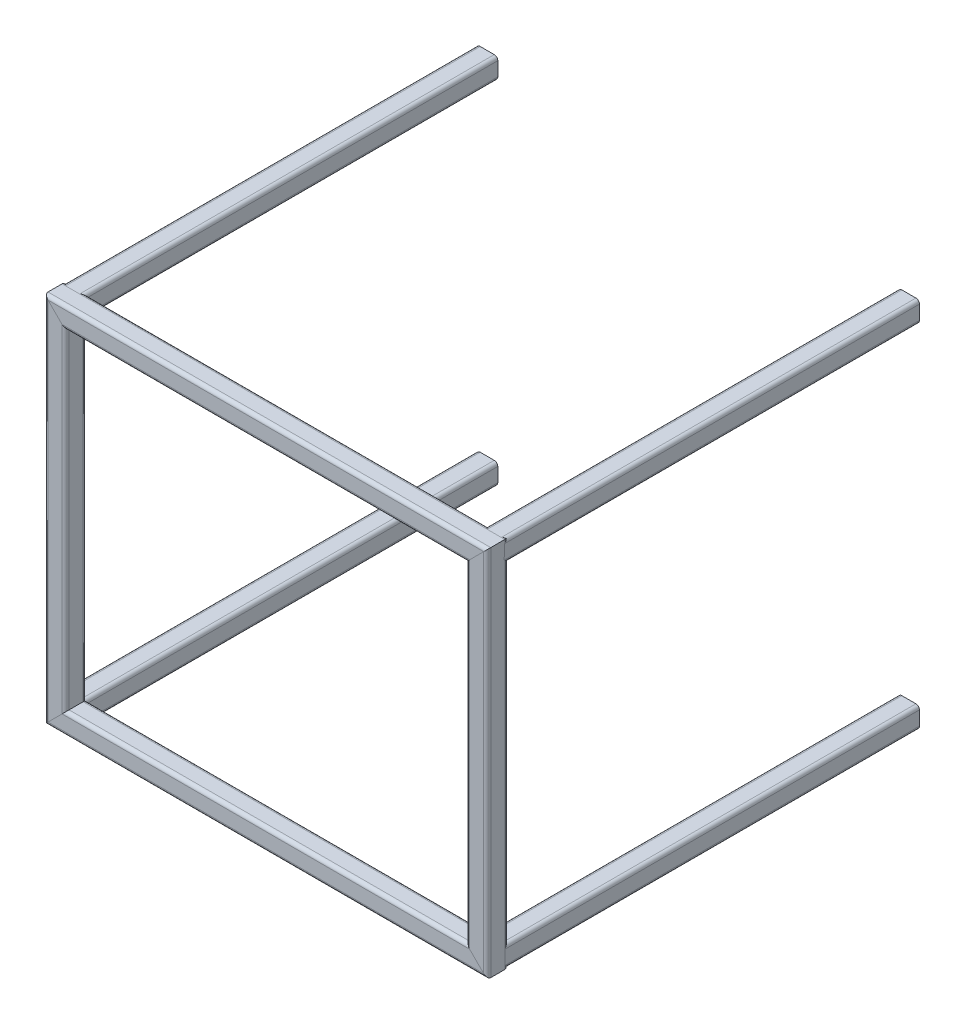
ISO-10303-21;
HEADER;
FILE_DESCRIPTION(('STEP AP214'),'2;1');
FILE_NAME('part.step','',(''),(''),'','','');
FILE_SCHEMA(('AUTOMOTIVE_DESIGN { 1 0 10303 214 1 1 1 1 }'));
ENDSEC;
DATA;
#1=APPLICATION_CONTEXT('core data for automotive mechanical design processes');
#2=APPLICATION_PROTOCOL_DEFINITION('international standard','automotive_design',2000,#1);
#3=PRODUCT_CONTEXT('',#1,'mechanical');
#4=PRODUCT('Part','Part','',(#3));
#5=PRODUCT_RELATED_PRODUCT_CATEGORY('part','',(#4));
#6=PRODUCT_DEFINITION_FORMATION('','',#4);
#7=PRODUCT_DEFINITION_CONTEXT('part definition',#1,'design');
#8=PRODUCT_DEFINITION('design','',#6,#7);
#9=PRODUCT_DEFINITION_SHAPE('','',#8);
#10=(LENGTH_UNIT() NAMED_UNIT(*) SI_UNIT(.MILLI.,.METRE.));
#11=(NAMED_UNIT(*) PLANE_ANGLE_UNIT() SI_UNIT($,.RADIAN.));
#12=(NAMED_UNIT(*) SI_UNIT($,.STERADIAN.) SOLID_ANGLE_UNIT());
#13=UNCERTAINTY_MEASURE_WITH_UNIT(LENGTH_MEASURE(1.E-05),#10,'distance_accuracy_value','');
#14=(GEOMETRIC_REPRESENTATION_CONTEXT(3) GLOBAL_UNCERTAINTY_ASSIGNED_CONTEXT((#13)) GLOBAL_UNIT_ASSIGNED_CONTEXT((#10,
#11,#12)) REPRESENTATION_CONTEXT('',''));
#15=CARTESIAN_POINT('',(0.,0.,0.));
#16=DIRECTION('',(0.,0.,1.));
#17=DIRECTION('',(1.,0.,0.));
#18=AXIS2_PLACEMENT_3D('',#15,#16,#17);
#19=CARTESIAN_POINT('',(863.6,787.4,-1524.));
#20=DIRECTION('',(0.,0.,1.));
#21=DIRECTION('',(1.,0.,0.));
#22=AXIS2_PLACEMENT_3D('',#19,#20,#21);
#23=CYLINDRICAL_SURFACE('',#22,12.7);
#24=CARTESIAN_POINT('',(863.6,787.4,0.));
#25=DIRECTION('',(0.,0.,-1.));
#26=DIRECTION('',(-1.,0.,0.));
#27=AXIS2_PLACEMENT_3D('',#24,#25,#26);
#28=CIRCLE('',#27,12.7);
#29=CARTESIAN_POINT('',(850.9,787.4,0.));
#30=VERTEX_POINT('',#29);
#31=CARTESIAN_POINT('',(863.6,800.1,0.));
#32=VERTEX_POINT('',#31);
#33=EDGE_CURVE('E229',#30,#32,#28,.T.);
#34=ORIENTED_EDGE('',*,*,#33,.T.);
#35=DIRECTION('',(0.,0.,1.));
#36=VECTOR('',#35,1.);
#37=CARTESIAN_POINT('',(863.6,800.1,-1524.));
#38=LINE('',#37,#36);
#39=CARTESIAN_POINT('',(863.6,800.1,-1524.));
#40=VERTEX_POINT('',#39);
#41=EDGE_CURVE('E13',#40,#32,#38,.T.);
#42=ORIENTED_EDGE('',*,*,#41,.F.);
#43=CARTESIAN_POINT('',(863.6,787.4,-1524.));
#44=DIRECTION('',(0.,0.,-1.));
#45=DIRECTION('',(-1.,0.,0.));
#46=AXIS2_PLACEMENT_3D('',#43,#44,#45);
#47=CIRCLE('',#46,12.7);
#48=CARTESIAN_POINT('',(850.9,787.4,-1524.));
#49=VERTEX_POINT('',#48);
#50=EDGE_CURVE('E307',#49,#40,#47,.T.);
#51=ORIENTED_EDGE('',*,*,#50,.F.);
#52=DIRECTION('',(0.,0.,1.));
#53=VECTOR('',#52,1.);
#54=CARTESIAN_POINT('',(850.9,787.4,-1524.));
#55=LINE('',#54,#53);
#56=EDGE_CURVE('E244',#49,#30,#55,.T.);
#57=ORIENTED_EDGE('',*,*,#56,.T.);
#58=EDGE_LOOP('',(#34,#42,#51,#57));
#59=FACE_BOUND('',#58,.T.);
#60=ADVANCED_FACE('F57',(#59),#23,.T.);
#61=CARTESIAN_POINT('',(863.6,800.1,-1524.));
#62=DIRECTION('',(0.,-1.,0.));
#63=DIRECTION('',(0.,0.,-1.));
#64=AXIS2_PLACEMENT_3D('',#61,#62,#63);
#65=PLANE('',#64);
#66=DIRECTION('',(1.,0.,0.));
#67=VECTOR('',#66,1.);
#68=CARTESIAN_POINT('',(863.6,800.1,0.));
#69=LINE('',#68,#67);
#70=CARTESIAN_POINT('',(914.4,800.1,0.));
#71=VERTEX_POINT('',#70);
#72=EDGE_CURVE('E232',#32,#71,#69,.T.);
#73=ORIENTED_EDGE('',*,*,#72,.T.);
#74=DIRECTION('',(0.,0.,1.));
#75=VECTOR('',#74,1.);
#76=CARTESIAN_POINT('',(914.4,800.1,-1524.));
#77=LINE('',#76,#75);
#78=CARTESIAN_POINT('',(914.4,800.1,-1524.));
#79=VERTEX_POINT('',#78);
#80=EDGE_CURVE('E67',#79,#71,#77,.T.);
#81=ORIENTED_EDGE('',*,*,#80,.F.);
#82=DIRECTION('',(1.,0.,0.));
#83=VECTOR('',#82,1.);
#84=CARTESIAN_POINT('',(863.6,800.1,-1524.));
#85=LINE('',#84,#83);
#86=EDGE_CURVE('E309',#40,#79,#85,.T.);
#87=ORIENTED_EDGE('',*,*,#86,.F.);
#88=ORIENTED_EDGE('',*,*,#41,.T.);
#89=EDGE_LOOP('',(#73,#81,#87,#88));
#90=FACE_BOUND('',#89,.T.);
#91=ADVANCED_FACE('F344',(#90),#65,.F.);
#92=CARTESIAN_POINT('',(914.4,787.4,-1524.));
#93=DIRECTION('',(0.,0.,1.));
#94=DIRECTION('',(1.,0.,0.));
#95=AXIS2_PLACEMENT_3D('',#92,#93,#94);
#96=CYLINDRICAL_SURFACE('',#95,12.7);
#97=CARTESIAN_POINT('',(914.4,787.4,0.));
#98=DIRECTION('',(0.,0.,-1.));
#99=DIRECTION('',(-1.,0.,0.));
#100=AXIS2_PLACEMENT_3D('',#97,#98,#99);
#101=CIRCLE('',#100,12.7);
#102=CARTESIAN_POINT('',(927.1,787.4,0.));
#103=VERTEX_POINT('',#102);
#104=EDGE_CURVE('E234',#71,#103,#101,.T.);
#105=ORIENTED_EDGE('',*,*,#104,.T.);
#106=DIRECTION('',(0.,0.,1.));
#107=VECTOR('',#106,1.);
#108=CARTESIAN_POINT('',(927.1,787.4,-1524.));
#109=LINE('',#108,#107);
#110=CARTESIAN_POINT('',(927.1,787.4,-1524.));
#111=VERTEX_POINT('',#110);
#112=EDGE_CURVE('E251',#111,#103,#109,.T.);
#113=ORIENTED_EDGE('',*,*,#112,.F.);
#114=CARTESIAN_POINT('',(914.4,787.4,-1524.));
#115=DIRECTION('',(0.,0.,-1.));
#116=DIRECTION('',(-1.,0.,0.));
#117=AXIS2_PLACEMENT_3D('',#114,#115,#116);
#118=CIRCLE('',#117,12.7);
#119=EDGE_CURVE('E311',#79,#111,#118,.T.);
#120=ORIENTED_EDGE('',*,*,#119,.F.);
#121=ORIENTED_EDGE('',*,*,#80,.T.);
#122=EDGE_LOOP('',(#105,#113,#120,#121));
#123=FACE_BOUND('',#122,.T.);
#124=ADVANCED_FACE('F349',(#123),#96,.T.);
#125=CARTESIAN_POINT('',(927.1,736.6,-1524.));
#126=DIRECTION('',(-1.,0.,0.));
#127=DIRECTION('',(0.,0.,1.));
#128=AXIS2_PLACEMENT_3D('',#125,#126,#127);
#129=PLANE('',#128);
#130=DIRECTION('',(0.,-1.,0.));
#131=VECTOR('',#130,1.);
#132=CARTESIAN_POINT('',(927.1,736.6,0.));
#133=LINE('',#132,#131);
#134=CARTESIAN_POINT('',(927.1,736.6,0.));
#135=VERTEX_POINT('',#134);
#136=EDGE_CURVE('E236',#103,#135,#133,.T.);
#137=ORIENTED_EDGE('',*,*,#136,.T.);
#138=DIRECTION('',(0.,0.,1.));
#139=VECTOR('',#138,1.);
#140=CARTESIAN_POINT('',(927.1,736.6,-1524.));
#141=LINE('',#140,#139);
#142=CARTESIAN_POINT('',(927.1,736.6,-1524.));
#143=VERTEX_POINT('',#142);
#144=EDGE_CURVE('E248',#143,#135,#141,.T.);
#145=ORIENTED_EDGE('',*,*,#144,.F.);
#146=DIRECTION('',(0.,-1.,0.));
#147=VECTOR('',#146,1.);
#148=CARTESIAN_POINT('',(927.1,736.6,-1524.));
#149=LINE('',#148,#147);
#150=EDGE_CURVE('E313',#111,#143,#149,.T.);
#151=ORIENTED_EDGE('',*,*,#150,.F.);
#152=ORIENTED_EDGE('',*,*,#112,.T.);
#153=EDGE_LOOP('',(#137,#145,#151,#152));
#154=FACE_BOUND('',#153,.T.);
#155=ADVANCED_FACE('F319',(#154),#129,.F.);
#156=CARTESIAN_POINT('',(914.4,736.6,-1524.));
#157=DIRECTION('',(0.,0.,1.));
#158=DIRECTION('',(1.,0.,0.));
#159=AXIS2_PLACEMENT_3D('',#156,#157,#158);
#160=CYLINDRICAL_SURFACE('',#159,12.7);
#161=CARTESIAN_POINT('',(914.4,736.6,0.));
#162=DIRECTION('',(0.,0.,-1.));
#163=DIRECTION('',(-1.,0.,0.));
#164=AXIS2_PLACEMENT_3D('',#161,#162,#163);
#165=CIRCLE('',#164,12.7);
#166=CARTESIAN_POINT('',(914.4,723.9,0.));
#167=VERTEX_POINT('',#166);
#168=EDGE_CURVE('E238',#135,#167,#165,.T.);
#169=ORIENTED_EDGE('',*,*,#168,.T.);
#170=DIRECTION('',(0.,0.,1.));
#171=VECTOR('',#170,1.);
#172=CARTESIAN_POINT('',(914.4,723.9,-1524.));
#173=LINE('',#172,#171);
#174=CARTESIAN_POINT('',(914.4,723.9,-1524.));
#175=VERTEX_POINT('',#174);
#176=EDGE_CURVE('E196',#175,#167,#173,.T.);
#177=ORIENTED_EDGE('',*,*,#176,.F.);
#178=CARTESIAN_POINT('',(914.4,736.6,-1524.));
#179=DIRECTION('',(0.,0.,-1.));
#180=DIRECTION('',(-1.,0.,0.));
#181=AXIS2_PLACEMENT_3D('',#178,#179,#180);
#182=CIRCLE('',#181,12.7);
#183=EDGE_CURVE('E187',#143,#175,#182,.T.);
#184=ORIENTED_EDGE('',*,*,#183,.F.);
#185=ORIENTED_EDGE('',*,*,#144,.T.);
#186=EDGE_LOOP('',(#169,#177,#184,#185));
#187=FACE_BOUND('',#186,.T.);
#188=ADVANCED_FACE('F323',(#187),#160,.T.);
#189=CARTESIAN_POINT('',(914.4,723.9,-1524.));
#190=DIRECTION('',(0.,1.,0.));
#191=DIRECTION('',(0.,0.,1.));
#192=AXIS2_PLACEMENT_3D('',#189,#190,#191);
#193=PLANE('',#192);
#194=DIRECTION('',(-1.,0.,0.));
#195=VECTOR('',#194,1.);
#196=CARTESIAN_POINT('',(914.4,723.9,0.));
#197=LINE('',#196,#195);
#198=CARTESIAN_POINT('',(863.6,723.9,0.));
#199=VERTEX_POINT('',#198);
#200=EDGE_CURVE('E195',#167,#199,#197,.T.);
#201=ORIENTED_EDGE('',*,*,#200,.T.);
#202=DIRECTION('',(0.,0.,1.));
#203=VECTOR('',#202,1.);
#204=CARTESIAN_POINT('',(863.6,723.9,-1524.));
#205=LINE('',#204,#203);
#206=CARTESIAN_POINT('',(863.6,723.9,-1524.));
#207=VERTEX_POINT('',#206);
#208=EDGE_CURVE('E192',#207,#199,#205,.T.);
#209=ORIENTED_EDGE('',*,*,#208,.F.);
#210=DIRECTION('',(-1.,0.,0.));
#211=VECTOR('',#210,1.);
#212=CARTESIAN_POINT('',(914.4,723.9,-1524.));
#213=LINE('',#212,#211);
#214=EDGE_CURVE('E181',#175,#207,#213,.T.);
#215=ORIENTED_EDGE('',*,*,#214,.F.);
#216=ORIENTED_EDGE('',*,*,#176,.T.);
#217=EDGE_LOOP('',(#201,#209,#215,#216));
#218=FACE_BOUND('',#217,.T.);
#219=ADVANCED_FACE('F193',(#218),#193,.F.);
#220=CARTESIAN_POINT('',(863.6,736.6,-1524.));
#221=DIRECTION('',(0.,0.,1.));
#222=DIRECTION('',(1.,0.,0.));
#223=AXIS2_PLACEMENT_3D('',#220,#221,#222);
#224=CYLINDRICAL_SURFACE('',#223,12.7);
#225=CARTESIAN_POINT('',(863.6,736.6,0.));
#226=DIRECTION('',(0.,0.,-1.));
#227=DIRECTION('',(-1.,0.,0.));
#228=AXIS2_PLACEMENT_3D('',#225,#226,#227);
#229=CIRCLE('',#228,12.7);
#230=CARTESIAN_POINT('',(850.9,736.6,0.));
#231=VERTEX_POINT('',#230);
#232=EDGE_CURVE('E129',#199,#231,#229,.T.);
#233=ORIENTED_EDGE('',*,*,#232,.T.);
#234=DIRECTION('',(0.,0.,1.));
#235=VECTOR('',#234,1.);
#236=CARTESIAN_POINT('',(850.9,736.6,-1524.));
#237=LINE('',#236,#235);
#238=CARTESIAN_POINT('',(850.9,736.6,-1524.));
#239=VERTEX_POINT('',#238);
#240=EDGE_CURVE('E197',#239,#231,#237,.T.);
#241=ORIENTED_EDGE('',*,*,#240,.F.);
#242=CARTESIAN_POINT('',(863.6,736.6,-1524.));
#243=DIRECTION('',(0.,0.,-1.));
#244=DIRECTION('',(-1.,0.,0.));
#245=AXIS2_PLACEMENT_3D('',#242,#243,#244);
#246=CIRCLE('',#245,12.7);
#247=EDGE_CURVE('E185',#207,#239,#246,.T.);
#248=ORIENTED_EDGE('',*,*,#247,.F.);
#249=ORIENTED_EDGE('',*,*,#208,.T.);
#250=EDGE_LOOP('',(#233,#241,#248,#249));
#251=FACE_BOUND('',#250,.T.);
#252=ADVANCED_FACE('F199',(#251),#224,.T.);
#253=CARTESIAN_POINT('',(914.4,787.4,-1524.));
#254=DIRECTION('',(0.,0.,1.));
#255=DIRECTION('',(1.,0.,0.));
#256=AXIS2_PLACEMENT_3D('',#253,#254,#255);
#257=CYLINDRICAL_SURFACE('',#256,6.35000000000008);
#258=CARTESIAN_POINT('',(914.4,787.4,0.));
#259=DIRECTION('',(0.,0.,-1.));
#260=DIRECTION('',(-1.,0.,0.));
#261=AXIS2_PLACEMENT_3D('',#258,#259,#260);
#262=CIRCLE('',#261,6.35000000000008);
#263=CARTESIAN_POINT('',(914.4,793.75,0.));
#264=VERTEX_POINT('',#263);
#265=CARTESIAN_POINT('',(920.75,787.4,0.));
#266=VERTEX_POINT('',#265);
#267=EDGE_CURVE('E205',#264,#266,#262,.T.);
#268=ORIENTED_EDGE('',*,*,#267,.F.);
#269=DIRECTION('',(0.,0.,1.));
#270=VECTOR('',#269,1.);
#271=CARTESIAN_POINT('',(914.4,793.75,-1524.));
#272=LINE('',#271,#270);
#273=CARTESIAN_POINT('',(914.4,793.75,-1524.));
#274=VERTEX_POINT('',#273);
#275=EDGE_CURVE('E61',#274,#264,#272,.T.);
#276=ORIENTED_EDGE('',*,*,#275,.F.);
#277=CARTESIAN_POINT('',(914.4,787.4,-1524.));
#278=DIRECTION('',(0.,0.,-1.));
#279=DIRECTION('',(-1.,0.,0.));
#280=AXIS2_PLACEMENT_3D('',#277,#278,#279);
#281=CIRCLE('',#280,6.35000000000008);
#282=CARTESIAN_POINT('',(920.75,787.4,-1524.));
#283=VERTEX_POINT('',#282);
#284=EDGE_CURVE('E243',#274,#283,#281,.T.);
#285=ORIENTED_EDGE('',*,*,#284,.T.);
#286=DIRECTION('',(0.,0.,1.));
#287=VECTOR('',#286,1.);
#288=CARTESIAN_POINT('',(920.75,787.4,-1524.));
#289=LINE('',#288,#287);
#290=EDGE_CURVE('E201',#283,#266,#289,.T.);
#291=ORIENTED_EDGE('',*,*,#290,.T.);
#292=EDGE_LOOP('',(#268,#276,#285,#291));
#293=FACE_BOUND('',#292,.T.);
#294=ADVANCED_FACE('F59',(#293),#257,.F.);
#295=CARTESIAN_POINT('',(863.6,793.75,-1524.));
#296=DIRECTION('',(0.,-1.,0.));
#297=DIRECTION('',(0.,0.,-1.));
#298=AXIS2_PLACEMENT_3D('',#295,#296,#297);
#299=PLANE('',#298);
#300=DIRECTION('',(1.,0.,0.));
#301=VECTOR('',#300,1.);
#302=CARTESIAN_POINT('',(863.6,793.75,0.));
#303=LINE('',#302,#301);
#304=CARTESIAN_POINT('',(863.6,793.75,0.));
#305=VERTEX_POINT('',#304);
#306=EDGE_CURVE('E208',#305,#264,#303,.T.);
#307=ORIENTED_EDGE('',*,*,#306,.F.);
#308=DIRECTION('',(0.,0.,1.));
#309=VECTOR('',#308,1.);
#310=CARTESIAN_POINT('',(863.6,793.75,-1524.));
#311=LINE('',#310,#309);
#312=CARTESIAN_POINT('',(863.6,793.75,-1524.));
#313=VERTEX_POINT('',#312);
#314=EDGE_CURVE('E266',#313,#305,#311,.T.);
#315=ORIENTED_EDGE('',*,*,#314,.F.);
#316=DIRECTION('',(1.,0.,0.));
#317=VECTOR('',#316,1.);
#318=CARTESIAN_POINT('',(863.6,793.75,-1524.));
#319=LINE('',#318,#317);
#320=EDGE_CURVE('E275',#313,#274,#319,.T.);
#321=ORIENTED_EDGE('',*,*,#320,.T.);
#322=ORIENTED_EDGE('',*,*,#275,.T.);
#323=EDGE_LOOP('',(#307,#315,#321,#322));
#324=FACE_BOUND('',#323,.T.);
#325=ADVANCED_FACE('F273',(#324),#299,.T.);
#326=CARTESIAN_POINT('',(863.6,787.4,-1524.));
#327=DIRECTION('',(0.,0.,1.));
#328=DIRECTION('',(1.,0.,0.));
#329=AXIS2_PLACEMENT_3D('',#326,#327,#328);
#330=CYLINDRICAL_SURFACE('',#329,6.35000000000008);
#331=CARTESIAN_POINT('',(863.6,787.4,0.));
#332=DIRECTION('',(0.,0.,-1.));
#333=DIRECTION('',(-1.,0.,0.));
#334=AXIS2_PLACEMENT_3D('',#331,#332,#333);
#335=CIRCLE('',#334,6.35000000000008);
#336=CARTESIAN_POINT('',(857.25,787.4,0.));
#337=VERTEX_POINT('',#336);
#338=EDGE_CURVE('E211',#337,#305,#335,.T.);
#339=ORIENTED_EDGE('',*,*,#338,.F.);
#340=DIRECTION('',(0.,0.,1.));
#341=VECTOR('',#340,1.);
#342=CARTESIAN_POINT('',(857.25,787.4,-1524.));
#343=LINE('',#342,#341);
#344=CARTESIAN_POINT('',(857.25,787.4,-1524.));
#345=VERTEX_POINT('',#344);
#346=EDGE_CURVE('E265',#345,#337,#343,.T.);
#347=ORIENTED_EDGE('',*,*,#346,.F.);
#348=CARTESIAN_POINT('',(863.6,787.4,-1524.));
#349=DIRECTION('',(0.,0.,-1.));
#350=DIRECTION('',(-1.,0.,0.));
#351=AXIS2_PLACEMENT_3D('',#348,#349,#350);
#352=CIRCLE('',#351,6.35000000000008);
#353=EDGE_CURVE('E283',#345,#313,#352,.T.);
#354=ORIENTED_EDGE('',*,*,#353,.T.);
#355=ORIENTED_EDGE('',*,*,#314,.T.);
#356=EDGE_LOOP('',(#339,#347,#354,#355));
#357=FACE_BOUND('',#356,.T.);
#358=ADVANCED_FACE('F281',(#357),#330,.F.);
#359=CARTESIAN_POINT('',(857.25,787.4,-1524.));
#360=DIRECTION('',(1.,0.,0.));
#361=DIRECTION('',(0.,0.,-1.));
#362=AXIS2_PLACEMENT_3D('',#359,#360,#361);
#363=PLANE('',#362);
#364=DIRECTION('',(0.,1.,0.));
#365=VECTOR('',#364,1.);
#366=CARTESIAN_POINT('',(857.25,787.4,0.));
#367=LINE('',#366,#365);
#368=CARTESIAN_POINT('',(857.25,736.6,0.));
#369=VERTEX_POINT('',#368);
#370=EDGE_CURVE('E214',#369,#337,#367,.T.);
#371=ORIENTED_EDGE('',*,*,#370,.F.);
#372=DIRECTION('',(0.,0.,1.));
#373=VECTOR('',#372,1.);
#374=CARTESIAN_POINT('',(857.25,736.6,-1524.));
#375=LINE('',#374,#373);
#376=CARTESIAN_POINT('',(857.25,736.6,-1524.));
#377=VERTEX_POINT('',#376);
#378=EDGE_CURVE('E263',#377,#369,#375,.T.);
#379=ORIENTED_EDGE('',*,*,#378,.F.);
#380=DIRECTION('',(0.,1.,0.));
#381=VECTOR('',#380,1.);
#382=CARTESIAN_POINT('',(857.25,787.4,-1524.));
#383=LINE('',#382,#381);
#384=EDGE_CURVE('E289',#377,#345,#383,.T.);
#385=ORIENTED_EDGE('',*,*,#384,.T.);
#386=ORIENTED_EDGE('',*,*,#346,.T.);
#387=EDGE_LOOP('',(#371,#379,#385,#386));
#388=FACE_BOUND('',#387,.T.);
#389=ADVANCED_FACE('F292',(#388),#363,.T.);
#390=CARTESIAN_POINT('',(863.6,736.6,-1524.));
#391=DIRECTION('',(0.,0.,1.));
#392=DIRECTION('',(1.,0.,0.));
#393=AXIS2_PLACEMENT_3D('',#390,#391,#392);
#394=CYLINDRICAL_SURFACE('',#393,6.35000000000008);
#395=CARTESIAN_POINT('',(863.6,736.6,0.));
#396=DIRECTION('',(0.,0.,-1.));
#397=DIRECTION('',(-1.,0.,0.));
#398=AXIS2_PLACEMENT_3D('',#395,#396,#397);
#399=CIRCLE('',#398,6.35000000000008);
#400=CARTESIAN_POINT('',(863.6,730.25,0.));
#401=VERTEX_POINT('',#400);
#402=EDGE_CURVE('E217',#401,#369,#399,.T.);
#403=ORIENTED_EDGE('',*,*,#402,.F.);
#404=DIRECTION('',(0.,0.,1.));
#405=VECTOR('',#404,1.);
#406=CARTESIAN_POINT('',(863.6,730.25,-1524.));
#407=LINE('',#406,#405);
#408=CARTESIAN_POINT('',(863.6,730.25,-1524.));
#409=VERTEX_POINT('',#408);
#410=EDGE_CURVE('E261',#409,#401,#407,.T.);
#411=ORIENTED_EDGE('',*,*,#410,.F.);
#412=CARTESIAN_POINT('',(863.6,736.6,-1524.));
#413=DIRECTION('',(0.,0.,-1.));
#414=DIRECTION('',(-1.,0.,0.));
#415=AXIS2_PLACEMENT_3D('',#412,#413,#414);
#416=CIRCLE('',#415,6.35000000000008);
#417=EDGE_CURVE('E293',#409,#377,#416,.T.);
#418=ORIENTED_EDGE('',*,*,#417,.T.);
#419=ORIENTED_EDGE('',*,*,#378,.T.);
#420=EDGE_LOOP('',(#403,#411,#418,#419));
#421=FACE_BOUND('',#420,.T.);
#422=ADVANCED_FACE('F360',(#421),#394,.F.);
#423=CARTESIAN_POINT('',(914.4,730.25,-1524.));
#424=DIRECTION('',(0.,1.,0.));
#425=DIRECTION('',(0.,0.,1.));
#426=AXIS2_PLACEMENT_3D('',#423,#424,#425);
#427=PLANE('',#426);
#428=DIRECTION('',(-1.,0.,0.));
#429=VECTOR('',#428,1.);
#430=CARTESIAN_POINT('',(914.4,730.25,0.));
#431=LINE('',#430,#429);
#432=CARTESIAN_POINT('',(914.4,730.25,0.));
#433=VERTEX_POINT('',#432);
#434=EDGE_CURVE('E220',#433,#401,#431,.T.);
#435=ORIENTED_EDGE('',*,*,#434,.F.);
#436=DIRECTION('',(0.,0.,1.));
#437=VECTOR('',#436,1.);
#438=CARTESIAN_POINT('',(914.4,730.25,-1524.));
#439=LINE('',#438,#437);
#440=CARTESIAN_POINT('',(914.4,730.25,-1524.));
#441=VERTEX_POINT('',#440);
#442=EDGE_CURVE('E259',#441,#433,#439,.T.);
#443=ORIENTED_EDGE('',*,*,#442,.F.);
#444=DIRECTION('',(-1.,0.,0.));
#445=VECTOR('',#444,1.);
#446=CARTESIAN_POINT('',(914.4,730.25,-1524.));
#447=LINE('',#446,#445);
#448=EDGE_CURVE('E295',#441,#409,#447,.T.);
#449=ORIENTED_EDGE('',*,*,#448,.T.);
#450=ORIENTED_EDGE('',*,*,#410,.T.);
#451=EDGE_LOOP('',(#435,#443,#449,#450));
#452=FACE_BOUND('',#451,.T.);
#453=ADVANCED_FACE('F356',(#452),#427,.T.);
#454=CARTESIAN_POINT('',(914.4,736.6,-1524.));
#455=DIRECTION('',(0.,0.,1.));
#456=DIRECTION('',(1.,0.,0.));
#457=AXIS2_PLACEMENT_3D('',#454,#455,#456);
#458=CYLINDRICAL_SURFACE('',#457,6.35000000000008);
#459=CARTESIAN_POINT('',(914.4,736.6,0.));
#460=DIRECTION('',(0.,0.,-1.));
#461=DIRECTION('',(-1.,0.,0.));
#462=AXIS2_PLACEMENT_3D('',#459,#460,#461);
#463=CIRCLE('',#462,6.35000000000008);
#464=CARTESIAN_POINT('',(920.75,736.6,0.));
#465=VERTEX_POINT('',#464);
#466=EDGE_CURVE('E223',#465,#433,#463,.T.);
#467=ORIENTED_EDGE('',*,*,#466,.F.);
#468=DIRECTION('',(0.,0.,1.));
#469=VECTOR('',#468,1.);
#470=CARTESIAN_POINT('',(920.75,736.6,-1524.));
#471=LINE('',#470,#469);
#472=CARTESIAN_POINT('',(920.75,736.6,-1524.));
#473=VERTEX_POINT('',#472);
#474=EDGE_CURVE('E257',#473,#465,#471,.T.);
#475=ORIENTED_EDGE('',*,*,#474,.F.);
#476=CARTESIAN_POINT('',(914.4,736.6,-1524.));
#477=DIRECTION('',(0.,0.,-1.));
#478=DIRECTION('',(-1.,0.,0.));
#479=AXIS2_PLACEMENT_3D('',#476,#477,#478);
#480=CIRCLE('',#479,6.35000000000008);
#481=EDGE_CURVE('E301',#473,#441,#480,.T.);
#482=ORIENTED_EDGE('',*,*,#481,.T.);
#483=ORIENTED_EDGE('',*,*,#442,.T.);
#484=EDGE_LOOP('',(#467,#475,#482,#483));
#485=FACE_BOUND('',#484,.T.);
#486=ADVANCED_FACE('F338',(#485),#458,.F.);
#487=CARTESIAN_POINT('',(920.75,736.6,-1524.));
#488=DIRECTION('',(-1.,0.,0.));
#489=DIRECTION('',(0.,0.,1.));
#490=AXIS2_PLACEMENT_3D('',#487,#488,#489);
#491=PLANE('',#490);
#492=DIRECTION('',(0.,-1.,0.));
#493=VECTOR('',#492,1.);
#494=CARTESIAN_POINT('',(920.75,736.6,0.));
#495=LINE('',#494,#493);
#496=EDGE_CURVE('E226',#266,#465,#495,.T.);
#497=ORIENTED_EDGE('',*,*,#496,.F.);
#498=ORIENTED_EDGE('',*,*,#290,.F.);
#499=DIRECTION('',(0.,-1.,0.));
#500=VECTOR('',#499,1.);
#501=CARTESIAN_POINT('',(920.75,736.6,-1524.));
#502=LINE('',#501,#500);
#503=EDGE_CURVE('E304',#283,#473,#502,.T.);
#504=ORIENTED_EDGE('',*,*,#503,.T.);
#505=ORIENTED_EDGE('',*,*,#474,.T.);
#506=EDGE_LOOP('',(#497,#498,#504,#505));
#507=FACE_BOUND('',#506,.T.);
#508=ADVANCED_FACE('F331',(#507),#491,.T.);
#509=CARTESIAN_POINT('',(850.9,787.4,-1524.));
#510=DIRECTION('',(1.,0.,0.));
#511=DIRECTION('',(0.,0.,-1.));
#512=AXIS2_PLACEMENT_3D('',#509,#510,#511);
#513=PLANE('',#512);
#514=DIRECTION('',(0.,1.,0.));
#515=VECTOR('',#514,1.);
#516=CARTESIAN_POINT('',(850.9,787.4,0.));
#517=LINE('',#516,#515);
#518=EDGE_CURVE('E135',#231,#30,#517,.T.);
#519=ORIENTED_EDGE('',*,*,#518,.T.);
#520=ORIENTED_EDGE('',*,*,#56,.F.);
#521=DIRECTION('',(0.,1.,0.));
#522=VECTOR('',#521,1.);
#523=CARTESIAN_POINT('',(850.9,787.4,-1524.));
#524=LINE('',#523,#522);
#525=EDGE_CURVE('E76',#239,#49,#524,.T.);
#526=ORIENTED_EDGE('',*,*,#525,.F.);
#527=ORIENTED_EDGE('',*,*,#240,.T.);
#528=EDGE_LOOP('',(#519,#520,#526,#527));
#529=FACE_BOUND('',#528,.T.);
#530=ADVANCED_FACE('F329',(#529),#513,.F.);
#531=CARTESIAN_POINT('',(863.6,787.4,-1524.));
#532=DIRECTION('',(0.,0.,-1.));
#533=DIRECTION('',(-1.,0.,0.));
#534=AXIS2_PLACEMENT_3D('',#531,#532,#533);
#535=PLANE('',#534);
#536=ORIENTED_EDGE('',*,*,#284,.F.);
#537=ORIENTED_EDGE('',*,*,#320,.F.);
#538=ORIENTED_EDGE('',*,*,#353,.F.);
#539=ORIENTED_EDGE('',*,*,#384,.F.);
#540=ORIENTED_EDGE('',*,*,#417,.F.);
#541=ORIENTED_EDGE('',*,*,#448,.F.);
#542=ORIENTED_EDGE('',*,*,#481,.F.);
#543=ORIENTED_EDGE('',*,*,#503,.F.);
#544=EDGE_LOOP('',(#536,#537,#538,#539,#540,#541,#542,#543));
#545=FACE_BOUND('',#544,.T.);
#546=ORIENTED_EDGE('',*,*,#50,.T.);
#547=ORIENTED_EDGE('',*,*,#86,.T.);
#548=ORIENTED_EDGE('',*,*,#119,.T.);
#549=ORIENTED_EDGE('',*,*,#150,.T.);
#550=ORIENTED_EDGE('',*,*,#183,.T.);
#551=ORIENTED_EDGE('',*,*,#214,.T.);
#552=ORIENTED_EDGE('',*,*,#247,.T.);
#553=ORIENTED_EDGE('',*,*,#525,.T.);
#554=EDGE_LOOP('',(#546,#547,#548,#549,#550,#551,#552,#553));
#555=FACE_BOUND('',#554,.T.);
#556=ADVANCED_FACE('F183',(#545,#555),#535,.T.);
#557=CARTESIAN_POINT('',(863.6,787.4,0.));
#558=DIRECTION('',(0.,0.,-1.));
#559=DIRECTION('',(-1.,0.,0.));
#560=AXIS2_PLACEMENT_3D('',#557,#558,#559);
#561=PLANE('',#560);
#562=ORIENTED_EDGE('',*,*,#267,.T.);
#563=ORIENTED_EDGE('',*,*,#496,.T.);
#564=ORIENTED_EDGE('',*,*,#466,.T.);
#565=ORIENTED_EDGE('',*,*,#434,.T.);
#566=ORIENTED_EDGE('',*,*,#402,.T.);
#567=ORIENTED_EDGE('',*,*,#370,.T.);
#568=ORIENTED_EDGE('',*,*,#338,.T.);
#569=ORIENTED_EDGE('',*,*,#306,.T.);
#570=EDGE_LOOP('',(#562,#563,#564,#565,#566,#567,#568,#569));
#571=FACE_BOUND('',#570,.T.);
#572=ORIENTED_EDGE('',*,*,#33,.F.);
#573=ORIENTED_EDGE('',*,*,#518,.F.);
#574=ORIENTED_EDGE('',*,*,#232,.F.);
#575=ORIENTED_EDGE('',*,*,#200,.F.);
#576=ORIENTED_EDGE('',*,*,#168,.F.);
#577=ORIENTED_EDGE('',*,*,#136,.F.);
#578=ORIENTED_EDGE('',*,*,#104,.F.);
#579=ORIENTED_EDGE('',*,*,#72,.F.);
#580=EDGE_LOOP('',(#572,#573,#574,#575,#576,#577,#578,#579));
#581=FACE_BOUND('',#580,.T.);
#582=ADVANCED_FACE('F278',(#571,#581),#561,.F.);
#583=CLOSED_SHELL('',(#60,#91,#124,#155,#188,#219,#252,#294,#325,#358,#389,#422,#453,#486,#508,
#530,#556,#582));
#584=MANIFOLD_SOLID_BREP('B2',#583);
#585=CARTESIAN_POINT('',(-660.4,787.4,-1524.));
#586=DIRECTION('',(0.,0.,1.));
#587=DIRECTION('',(1.,0.,0.));
#588=AXIS2_PLACEMENT_3D('',#585,#586,#587);
#589=CYLINDRICAL_SURFACE('',#588,12.7);
#590=CARTESIAN_POINT('',(-660.4,787.4,0.));
#591=DIRECTION('',(0.,0.,-1.));
#592=DIRECTION('',(-1.,0.,0.));
#593=AXIS2_PLACEMENT_3D('',#590,#591,#592);
#594=CIRCLE('',#593,12.7);
#595=CARTESIAN_POINT('',(-673.1,787.4,0.));
#596=VERTEX_POINT('',#595);
#597=CARTESIAN_POINT('',(-660.4,800.1,0.));
#598=VERTEX_POINT('',#597);
#599=EDGE_CURVE('E712',#596,#598,#594,.T.);
#600=ORIENTED_EDGE('',*,*,#599,.T.);
#601=DIRECTION('',(0.,0.,1.));
#602=VECTOR('',#601,1.);
#603=CARTESIAN_POINT('',(-660.4,800.1,-1524.));
#604=LINE('',#603,#602);
#605=CARTESIAN_POINT('',(-660.4,800.1,-1524.));
#606=VERTEX_POINT('',#605);
#607=EDGE_CURVE('E55',#606,#598,#604,.T.);
#608=ORIENTED_EDGE('',*,*,#607,.F.);
#609=CARTESIAN_POINT('',(-660.4,787.4,-1524.));
#610=DIRECTION('',(0.,0.,-1.));
#611=DIRECTION('',(-1.,0.,0.));
#612=AXIS2_PLACEMENT_3D('',#609,#610,#611);
#613=CIRCLE('',#612,12.7);
#614=CARTESIAN_POINT('',(-673.1,787.4,-1524.));
#615=VERTEX_POINT('',#614);
#616=EDGE_CURVE('E790',#615,#606,#613,.T.);
#617=ORIENTED_EDGE('',*,*,#616,.F.);
#618=DIRECTION('',(0.,0.,1.));
#619=VECTOR('',#618,1.);
#620=CARTESIAN_POINT('',(-673.1,787.4,-1524.));
#621=LINE('',#620,#619);
#622=EDGE_CURVE('E727',#615,#596,#621,.T.);
#623=ORIENTED_EDGE('',*,*,#622,.T.);
#624=EDGE_LOOP('',(#600,#608,#617,#623));
#625=FACE_BOUND('',#624,.T.);
#626=ADVANCED_FACE('F540',(#625),#589,.T.);
#627=CARTESIAN_POINT('',(-660.4,800.1,-1524.));
#628=DIRECTION('',(0.,-1.,0.));
#629=DIRECTION('',(0.,0.,-1.));
#630=AXIS2_PLACEMENT_3D('',#627,#628,#629);
#631=PLANE('',#630);
#632=DIRECTION('',(1.,0.,0.));
#633=VECTOR('',#632,1.);
#634=CARTESIAN_POINT('',(-660.4,800.1,0.));
#635=LINE('',#634,#633);
#636=CARTESIAN_POINT('',(-609.6,800.1,0.));
#637=VERTEX_POINT('',#636);
#638=EDGE_CURVE('E715',#598,#637,#635,.T.);
#639=ORIENTED_EDGE('',*,*,#638,.T.);
#640=DIRECTION('',(0.,0.,1.));
#641=VECTOR('',#640,1.);
#642=CARTESIAN_POINT('',(-609.6,800.1,-1524.));
#643=LINE('',#642,#641);
#644=CARTESIAN_POINT('',(-609.6,800.1,-1524.));
#645=VERTEX_POINT('',#644);
#646=EDGE_CURVE('E550',#645,#637,#643,.T.);
#647=ORIENTED_EDGE('',*,*,#646,.F.);
#648=DIRECTION('',(1.,0.,0.));
#649=VECTOR('',#648,1.);
#650=CARTESIAN_POINT('',(-660.4,800.1,-1524.));
#651=LINE('',#650,#649);
#652=EDGE_CURVE('E792',#606,#645,#651,.T.);
#653=ORIENTED_EDGE('',*,*,#652,.F.);
#654=ORIENTED_EDGE('',*,*,#607,.T.);
#655=EDGE_LOOP('',(#639,#647,#653,#654));
#656=FACE_BOUND('',#655,.T.);
#657=ADVANCED_FACE('F827',(#656),#631,.F.);
#658=CARTESIAN_POINT('',(-609.6,787.4,-1524.));
#659=DIRECTION('',(0.,0.,1.));
#660=DIRECTION('',(1.,0.,0.));
#661=AXIS2_PLACEMENT_3D('',#658,#659,#660);
#662=CYLINDRICAL_SURFACE('',#661,12.7);
#663=CARTESIAN_POINT('',(-609.6,787.4,0.));
#664=DIRECTION('',(0.,0.,-1.));
#665=DIRECTION('',(-1.,0.,0.));
#666=AXIS2_PLACEMENT_3D('',#663,#664,#665);
#667=CIRCLE('',#666,12.7);
#668=CARTESIAN_POINT('',(-596.9,787.4,0.));
#669=VERTEX_POINT('',#668);
#670=EDGE_CURVE('E717',#637,#669,#667,.T.);
#671=ORIENTED_EDGE('',*,*,#670,.T.);
#672=DIRECTION('',(0.,0.,1.));
#673=VECTOR('',#672,1.);
#674=CARTESIAN_POINT('',(-596.9,787.4,-1524.));
#675=LINE('',#674,#673);
#676=CARTESIAN_POINT('',(-596.9,787.4,-1524.));
#677=VERTEX_POINT('',#676);
#678=EDGE_CURVE('E734',#677,#669,#675,.T.);
#679=ORIENTED_EDGE('',*,*,#678,.F.);
#680=CARTESIAN_POINT('',(-609.6,787.4,-1524.));
#681=DIRECTION('',(0.,0.,-1.));
#682=DIRECTION('',(-1.,0.,0.));
#683=AXIS2_PLACEMENT_3D('',#680,#681,#682);
#684=CIRCLE('',#683,12.7);
#685=EDGE_CURVE('E794',#645,#677,#684,.T.);
#686=ORIENTED_EDGE('',*,*,#685,.F.);
#687=ORIENTED_EDGE('',*,*,#646,.T.);
#688=EDGE_LOOP('',(#671,#679,#686,#687));
#689=FACE_BOUND('',#688,.T.);
#690=ADVANCED_FACE('F832',(#689),#662,.T.);
#691=CARTESIAN_POINT('',(-596.9,736.6,-1524.));
#692=DIRECTION('',(-1.,0.,0.));
#693=DIRECTION('',(0.,0.,1.));
#694=AXIS2_PLACEMENT_3D('',#691,#692,#693);
#695=PLANE('',#694);
#696=DIRECTION('',(0.,-1.,0.));
#697=VECTOR('',#696,1.);
#698=CARTESIAN_POINT('',(-596.9,736.6,0.));
#699=LINE('',#698,#697);
#700=CARTESIAN_POINT('',(-596.9,736.6,0.));
#701=VERTEX_POINT('',#700);
#702=EDGE_CURVE('E719',#669,#701,#699,.T.);
#703=ORIENTED_EDGE('',*,*,#702,.T.);
#704=DIRECTION('',(0.,0.,1.));
#705=VECTOR('',#704,1.);
#706=CARTESIAN_POINT('',(-596.9,736.6,-1524.));
#707=LINE('',#706,#705);
#708=CARTESIAN_POINT('',(-596.9,736.6,-1524.));
#709=VERTEX_POINT('',#708);
#710=EDGE_CURVE('E731',#709,#701,#707,.T.);
#711=ORIENTED_EDGE('',*,*,#710,.F.);
#712=DIRECTION('',(0.,-1.,0.));
#713=VECTOR('',#712,1.);
#714=CARTESIAN_POINT('',(-596.9,736.6,-1524.));
#715=LINE('',#714,#713);
#716=EDGE_CURVE('E796',#677,#709,#715,.T.);
#717=ORIENTED_EDGE('',*,*,#716,.F.);
#718=ORIENTED_EDGE('',*,*,#678,.T.);
#719=EDGE_LOOP('',(#703,#711,#717,#718));
#720=FACE_BOUND('',#719,.T.);
#721=ADVANCED_FACE('F802',(#720),#695,.F.);
#722=CARTESIAN_POINT('',(-609.6,736.6,-1524.));
#723=DIRECTION('',(0.,0.,1.));
#724=DIRECTION('',(1.,0.,0.));
#725=AXIS2_PLACEMENT_3D('',#722,#723,#724);
#726=CYLINDRICAL_SURFACE('',#725,12.7);
#727=CARTESIAN_POINT('',(-609.6,736.6,0.));
#728=DIRECTION('',(0.,0.,-1.));
#729=DIRECTION('',(-1.,0.,0.));
#730=AXIS2_PLACEMENT_3D('',#727,#728,#729);
#731=CIRCLE('',#730,12.7);
#732=CARTESIAN_POINT('',(-609.6,723.9,0.));
#733=VERTEX_POINT('',#732);
#734=EDGE_CURVE('E721',#701,#733,#731,.T.);
#735=ORIENTED_EDGE('',*,*,#734,.T.);
#736=DIRECTION('',(0.,0.,1.));
#737=VECTOR('',#736,1.);
#738=CARTESIAN_POINT('',(-609.6,723.9,-1524.));
#739=LINE('',#738,#737);
#740=CARTESIAN_POINT('',(-609.6,723.9,-1524.));
#741=VERTEX_POINT('',#740);
#742=EDGE_CURVE('E679',#741,#733,#739,.T.);
#743=ORIENTED_EDGE('',*,*,#742,.F.);
#744=CARTESIAN_POINT('',(-609.6,736.6,-1524.));
#745=DIRECTION('',(0.,0.,-1.));
#746=DIRECTION('',(-1.,0.,0.));
#747=AXIS2_PLACEMENT_3D('',#744,#745,#746);
#748=CIRCLE('',#747,12.7);
#749=EDGE_CURVE('E670',#709,#741,#748,.T.);
#750=ORIENTED_EDGE('',*,*,#749,.F.);
#751=ORIENTED_EDGE('',*,*,#710,.T.);
#752=EDGE_LOOP('',(#735,#743,#750,#751));
#753=FACE_BOUND('',#752,.T.);
#754=ADVANCED_FACE('F806',(#753),#726,.T.);
#755=CARTESIAN_POINT('',(-609.6,723.9,-1524.));
#756=DIRECTION('',(0.,1.,0.));
#757=DIRECTION('',(0.,0.,1.));
#758=AXIS2_PLACEMENT_3D('',#755,#756,#757);
#759=PLANE('',#758);
#760=DIRECTION('',(-1.,0.,0.));
#761=VECTOR('',#760,1.);
#762=CARTESIAN_POINT('',(-609.6,723.9,0.));
#763=LINE('',#762,#761);
#764=CARTESIAN_POINT('',(-660.4,723.9,0.));
#765=VERTEX_POINT('',#764);
#766=EDGE_CURVE('E678',#733,#765,#763,.T.);
#767=ORIENTED_EDGE('',*,*,#766,.T.);
#768=DIRECTION('',(0.,0.,1.));
#769=VECTOR('',#768,1.);
#770=CARTESIAN_POINT('',(-660.4,723.9,-1524.));
#771=LINE('',#770,#769);
#772=CARTESIAN_POINT('',(-660.4,723.9,-1524.));
#773=VERTEX_POINT('',#772);
#774=EDGE_CURVE('E675',#773,#765,#771,.T.);
#775=ORIENTED_EDGE('',*,*,#774,.F.);
#776=DIRECTION('',(-1.,0.,0.));
#777=VECTOR('',#776,1.);
#778=CARTESIAN_POINT('',(-609.6,723.9,-1524.));
#779=LINE('',#778,#777);
#780=EDGE_CURVE('E664',#741,#773,#779,.T.);
#781=ORIENTED_EDGE('',*,*,#780,.F.);
#782=ORIENTED_EDGE('',*,*,#742,.T.);
#783=EDGE_LOOP('',(#767,#775,#781,#782));
#784=FACE_BOUND('',#783,.T.);
#785=ADVANCED_FACE('F676',(#784),#759,.F.);
#786=CARTESIAN_POINT('',(-660.4,736.6,-1524.));
#787=DIRECTION('',(0.,0.,1.));
#788=DIRECTION('',(1.,0.,0.));
#789=AXIS2_PLACEMENT_3D('',#786,#787,#788);
#790=CYLINDRICAL_SURFACE('',#789,12.7);
#791=CARTESIAN_POINT('',(-660.4,736.6,0.));
#792=DIRECTION('',(0.,0.,-1.));
#793=DIRECTION('',(-1.,0.,0.));
#794=AXIS2_PLACEMENT_3D('',#791,#792,#793);
#795=CIRCLE('',#794,12.7);
#796=CARTESIAN_POINT('',(-673.1,736.6,0.));
#797=VERTEX_POINT('',#796);
#798=EDGE_CURVE('E612',#765,#797,#795,.T.);
#799=ORIENTED_EDGE('',*,*,#798,.T.);
#800=DIRECTION('',(0.,0.,1.));
#801=VECTOR('',#800,1.);
#802=CARTESIAN_POINT('',(-673.1,736.6,-1524.));
#803=LINE('',#802,#801);
#804=CARTESIAN_POINT('',(-673.1,736.6,-1524.));
#805=VERTEX_POINT('',#804);
#806=EDGE_CURVE('E680',#805,#797,#803,.T.);
#807=ORIENTED_EDGE('',*,*,#806,.F.);
#808=CARTESIAN_POINT('',(-660.4,736.6,-1524.));
#809=DIRECTION('',(0.,0.,-1.));
#810=DIRECTION('',(-1.,0.,0.));
#811=AXIS2_PLACEMENT_3D('',#808,#809,#810);
#812=CIRCLE('',#811,12.7);
#813=EDGE_CURVE('E668',#773,#805,#812,.T.);
#814=ORIENTED_EDGE('',*,*,#813,.F.);
#815=ORIENTED_EDGE('',*,*,#774,.T.);
#816=EDGE_LOOP('',(#799,#807,#814,#815));
#817=FACE_BOUND('',#816,.T.);
#818=ADVANCED_FACE('F682',(#817),#790,.T.);
#819=CARTESIAN_POINT('',(-609.6,787.4,-1524.));
#820=DIRECTION('',(0.,0.,1.));
#821=DIRECTION('',(1.,0.,0.));
#822=AXIS2_PLACEMENT_3D('',#819,#820,#821);
#823=CYLINDRICAL_SURFACE('',#822,6.35000000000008);
#824=CARTESIAN_POINT('',(-609.6,787.4,0.));
#825=DIRECTION('',(0.,0.,-1.));
#826=DIRECTION('',(-1.,0.,0.));
#827=AXIS2_PLACEMENT_3D('',#824,#825,#826);
#828=CIRCLE('',#827,6.35000000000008);
#829=CARTESIAN_POINT('',(-609.6,793.75,0.));
#830=VERTEX_POINT('',#829);
#831=CARTESIAN_POINT('',(-603.25,787.4,0.));
#832=VERTEX_POINT('',#831);
#833=EDGE_CURVE('E688',#830,#832,#828,.T.);
#834=ORIENTED_EDGE('',*,*,#833,.F.);
#835=DIRECTION('',(0.,0.,1.));
#836=VECTOR('',#835,1.);
#837=CARTESIAN_POINT('',(-609.6,793.75,-1524.));
#838=LINE('',#837,#836);
#839=CARTESIAN_POINT('',(-609.6,793.75,-1524.));
#840=VERTEX_POINT('',#839);
#841=EDGE_CURVE('E544',#840,#830,#838,.T.);
#842=ORIENTED_EDGE('',*,*,#841,.F.);
#843=CARTESIAN_POINT('',(-609.6,787.4,-1524.));
#844=DIRECTION('',(0.,0.,-1.));
#845=DIRECTION('',(-1.,0.,0.));
#846=AXIS2_PLACEMENT_3D('',#843,#844,#845);
#847=CIRCLE('',#846,6.35000000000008);
#848=CARTESIAN_POINT('',(-603.25,787.4,-1524.));
#849=VERTEX_POINT('',#848);
#850=EDGE_CURVE('E726',#840,#849,#847,.T.);
#851=ORIENTED_EDGE('',*,*,#850,.T.);
#852=DIRECTION('',(0.,0.,1.));
#853=VECTOR('',#852,1.);
#854=CARTESIAN_POINT('',(-603.25,787.4,-1524.));
#855=LINE('',#854,#853);
#856=EDGE_CURVE('E684',#849,#832,#855,.T.);
#857=ORIENTED_EDGE('',*,*,#856,.T.);
#858=EDGE_LOOP('',(#834,#842,#851,#857));
#859=FACE_BOUND('',#858,.T.);
#860=ADVANCED_FACE('F542',(#859),#823,.F.);
#861=CARTESIAN_POINT('',(-660.4,793.75,-1524.));
#862=DIRECTION('',(0.,-1.,0.));
#863=DIRECTION('',(0.,0.,-1.));
#864=AXIS2_PLACEMENT_3D('',#861,#862,#863);
#865=PLANE('',#864);
#866=DIRECTION('',(1.,0.,0.));
#867=VECTOR('',#866,1.);
#868=CARTESIAN_POINT('',(-660.4,793.75,0.));
#869=LINE('',#868,#867);
#870=CARTESIAN_POINT('',(-660.4,793.75,0.));
#871=VERTEX_POINT('',#870);
#872=EDGE_CURVE('E691',#871,#830,#869,.T.);
#873=ORIENTED_EDGE('',*,*,#872,.F.);
#874=DIRECTION('',(0.,0.,1.));
#875=VECTOR('',#874,1.);
#876=CARTESIAN_POINT('',(-660.4,793.75,-1524.));
#877=LINE('',#876,#875);
#878=CARTESIAN_POINT('',(-660.4,793.75,-1524.));
#879=VERTEX_POINT('',#878);
#880=EDGE_CURVE('E749',#879,#871,#877,.T.);
#881=ORIENTED_EDGE('',*,*,#880,.F.);
#882=DIRECTION('',(1.,0.,0.));
#883=VECTOR('',#882,1.);
#884=CARTESIAN_POINT('',(-660.4,793.75,-1524.));
#885=LINE('',#884,#883);
#886=EDGE_CURVE('E758',#879,#840,#885,.T.);
#887=ORIENTED_EDGE('',*,*,#886,.T.);
#888=ORIENTED_EDGE('',*,*,#841,.T.);
#889=EDGE_LOOP('',(#873,#881,#887,#888));
#890=FACE_BOUND('',#889,.T.);
#891=ADVANCED_FACE('F756',(#890),#865,.T.);
#892=CARTESIAN_POINT('',(-660.4,787.4,-1524.));
#893=DIRECTION('',(0.,0.,1.));
#894=DIRECTION('',(1.,0.,0.));
#895=AXIS2_PLACEMENT_3D('',#892,#893,#894);
#896=CYLINDRICAL_SURFACE('',#895,6.35000000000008);
#897=CARTESIAN_POINT('',(-660.4,787.4,0.));
#898=DIRECTION('',(0.,0.,-1.));
#899=DIRECTION('',(-1.,0.,0.));
#900=AXIS2_PLACEMENT_3D('',#897,#898,#899);
#901=CIRCLE('',#900,6.35000000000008);
#902=CARTESIAN_POINT('',(-666.75,787.4,0.));
#903=VERTEX_POINT('',#902);
#904=EDGE_CURVE('E694',#903,#871,#901,.T.);
#905=ORIENTED_EDGE('',*,*,#904,.F.);
#906=DIRECTION('',(0.,0.,1.));
#907=VECTOR('',#906,1.);
#908=CARTESIAN_POINT('',(-666.75,787.4,-1524.));
#909=LINE('',#908,#907);
#910=CARTESIAN_POINT('',(-666.75,787.4,-1524.));
#911=VERTEX_POINT('',#910);
#912=EDGE_CURVE('E748',#911,#903,#909,.T.);
#913=ORIENTED_EDGE('',*,*,#912,.F.);
#914=CARTESIAN_POINT('',(-660.4,787.4,-1524.));
#915=DIRECTION('',(0.,0.,-1.));
#916=DIRECTION('',(-1.,0.,0.));
#917=AXIS2_PLACEMENT_3D('',#914,#915,#916);
#918=CIRCLE('',#917,6.35000000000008);
#919=EDGE_CURVE('E766',#911,#879,#918,.T.);
#920=ORIENTED_EDGE('',*,*,#919,.T.);
#921=ORIENTED_EDGE('',*,*,#880,.T.);
#922=EDGE_LOOP('',(#905,#913,#920,#921));
#923=FACE_BOUND('',#922,.T.);
#924=ADVANCED_FACE('F764',(#923),#896,.F.);
#925=CARTESIAN_POINT('',(-666.75,787.4,-1524.));
#926=DIRECTION('',(1.,0.,0.));
#927=DIRECTION('',(0.,0.,-1.));
#928=AXIS2_PLACEMENT_3D('',#925,#926,#927);
#929=PLANE('',#928);
#930=DIRECTION('',(0.,1.,0.));
#931=VECTOR('',#930,1.);
#932=CARTESIAN_POINT('',(-666.75,787.4,0.));
#933=LINE('',#932,#931);
#934=CARTESIAN_POINT('',(-666.75,736.6,0.));
#935=VERTEX_POINT('',#934);
#936=EDGE_CURVE('E697',#935,#903,#933,.T.);
#937=ORIENTED_EDGE('',*,*,#936,.F.);
#938=DIRECTION('',(0.,0.,1.));
#939=VECTOR('',#938,1.);
#940=CARTESIAN_POINT('',(-666.75,736.6,-1524.));
#941=LINE('',#940,#939);
#942=CARTESIAN_POINT('',(-666.75,736.6,-1524.));
#943=VERTEX_POINT('',#942);
#944=EDGE_CURVE('E746',#943,#935,#941,.T.);
#945=ORIENTED_EDGE('',*,*,#944,.F.);
#946=DIRECTION('',(0.,1.,0.));
#947=VECTOR('',#946,1.);
#948=CARTESIAN_POINT('',(-666.75,787.4,-1524.));
#949=LINE('',#948,#947);
#950=EDGE_CURVE('E772',#943,#911,#949,.T.);
#951=ORIENTED_EDGE('',*,*,#950,.T.);
#952=ORIENTED_EDGE('',*,*,#912,.T.);
#953=EDGE_LOOP('',(#937,#945,#951,#952));
#954=FACE_BOUND('',#953,.T.);
#955=ADVANCED_FACE('F775',(#954),#929,.T.);
#956=CARTESIAN_POINT('',(-660.4,736.6,-1524.));
#957=DIRECTION('',(0.,0.,1.));
#958=DIRECTION('',(1.,0.,0.));
#959=AXIS2_PLACEMENT_3D('',#956,#957,#958);
#960=CYLINDRICAL_SURFACE('',#959,6.35000000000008);
#961=CARTESIAN_POINT('',(-660.4,736.6,0.));
#962=DIRECTION('',(0.,0.,-1.));
#963=DIRECTION('',(-1.,0.,0.));
#964=AXIS2_PLACEMENT_3D('',#961,#962,#963);
#965=CIRCLE('',#964,6.35000000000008);
#966=CARTESIAN_POINT('',(-660.4,730.25,0.));
#967=VERTEX_POINT('',#966);
#968=EDGE_CURVE('E700',#967,#935,#965,.T.);
#969=ORIENTED_EDGE('',*,*,#968,.F.);
#970=DIRECTION('',(0.,0.,1.));
#971=VECTOR('',#970,1.);
#972=CARTESIAN_POINT('',(-660.4,730.25,-1524.));
#973=LINE('',#972,#971);
#974=CARTESIAN_POINT('',(-660.4,730.25,-1524.));
#975=VERTEX_POINT('',#974);
#976=EDGE_CURVE('E744',#975,#967,#973,.T.);
#977=ORIENTED_EDGE('',*,*,#976,.F.);
#978=CARTESIAN_POINT('',(-660.4,736.6,-1524.));
#979=DIRECTION('',(0.,0.,-1.));
#980=DIRECTION('',(-1.,0.,0.));
#981=AXIS2_PLACEMENT_3D('',#978,#979,#980);
#982=CIRCLE('',#981,6.35000000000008);
#983=EDGE_CURVE('E776',#975,#943,#982,.T.);
#984=ORIENTED_EDGE('',*,*,#983,.T.);
#985=ORIENTED_EDGE('',*,*,#944,.T.);
#986=EDGE_LOOP('',(#969,#977,#984,#985));
#987=FACE_BOUND('',#986,.T.);
#988=ADVANCED_FACE('F843',(#987),#960,.F.);
#989=CARTESIAN_POINT('',(-609.6,730.25,-1524.));
#990=DIRECTION('',(0.,1.,0.));
#991=DIRECTION('',(0.,0.,1.));
#992=AXIS2_PLACEMENT_3D('',#989,#990,#991);
#993=PLANE('',#992);
#994=DIRECTION('',(-1.,0.,0.));
#995=VECTOR('',#994,1.);
#996=CARTESIAN_POINT('',(-609.6,730.25,0.));
#997=LINE('',#996,#995);
#998=CARTESIAN_POINT('',(-609.6,730.25,0.));
#999=VERTEX_POINT('',#998);
#1000=EDGE_CURVE('E703',#999,#967,#997,.T.);
#1001=ORIENTED_EDGE('',*,*,#1000,.F.);
#1002=DIRECTION('',(0.,0.,1.));
#1003=VECTOR('',#1002,1.);
#1004=CARTESIAN_POINT('',(-609.6,730.25,-1524.));
#1005=LINE('',#1004,#1003);
#1006=CARTESIAN_POINT('',(-609.6,730.25,-1524.));
#1007=VERTEX_POINT('',#1006);
#1008=EDGE_CURVE('E742',#1007,#999,#1005,.T.);
#1009=ORIENTED_EDGE('',*,*,#1008,.F.);
#1010=DIRECTION('',(-1.,0.,0.));
#1011=VECTOR('',#1010,1.);
#1012=CARTESIAN_POINT('',(-609.6,730.25,-1524.));
#1013=LINE('',#1012,#1011);
#1014=EDGE_CURVE('E778',#1007,#975,#1013,.T.);
#1015=ORIENTED_EDGE('',*,*,#1014,.T.);
#1016=ORIENTED_EDGE('',*,*,#976,.T.);
#1017=EDGE_LOOP('',(#1001,#1009,#1015,#1016));
#1018=FACE_BOUND('',#1017,.T.);
#1019=ADVANCED_FACE('F839',(#1018),#993,.T.);
#1020=CARTESIAN_POINT('',(-609.6,736.6,-1524.));
#1021=DIRECTION('',(0.,0.,1.));
#1022=DIRECTION('',(1.,0.,0.));
#1023=AXIS2_PLACEMENT_3D('',#1020,#1021,#1022);
#1024=CYLINDRICAL_SURFACE('',#1023,6.35000000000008);
#1025=CARTESIAN_POINT('',(-609.6,736.6,0.));
#1026=DIRECTION('',(0.,0.,-1.));
#1027=DIRECTION('',(-1.,0.,0.));
#1028=AXIS2_PLACEMENT_3D('',#1025,#1026,#1027);
#1029=CIRCLE('',#1028,6.35000000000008);
#1030=CARTESIAN_POINT('',(-603.25,736.6,0.));
#1031=VERTEX_POINT('',#1030);
#1032=EDGE_CURVE('E706',#1031,#999,#1029,.T.);
#1033=ORIENTED_EDGE('',*,*,#1032,.F.);
#1034=DIRECTION('',(0.,0.,1.));
#1035=VECTOR('',#1034,1.);
#1036=CARTESIAN_POINT('',(-603.25,736.6,-1524.));
#1037=LINE('',#1036,#1035);
#1038=CARTESIAN_POINT('',(-603.25,736.6,-1524.));
#1039=VERTEX_POINT('',#1038);
#1040=EDGE_CURVE('E740',#1039,#1031,#1037,.T.);
#1041=ORIENTED_EDGE('',*,*,#1040,.F.);
#1042=CARTESIAN_POINT('',(-609.6,736.6,-1524.));
#1043=DIRECTION('',(0.,0.,-1.));
#1044=DIRECTION('',(-1.,0.,0.));
#1045=AXIS2_PLACEMENT_3D('',#1042,#1043,#1044);
#1046=CIRCLE('',#1045,6.35000000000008);
#1047=EDGE_CURVE('E784',#1039,#1007,#1046,.T.);
#1048=ORIENTED_EDGE('',*,*,#1047,.T.);
#1049=ORIENTED_EDGE('',*,*,#1008,.T.);
#1050=EDGE_LOOP('',(#1033,#1041,#1048,#1049));
#1051=FACE_BOUND('',#1050,.T.);
#1052=ADVANCED_FACE('F821',(#1051),#1024,.F.);
#1053=CARTESIAN_POINT('',(-603.25,736.6,-1524.));
#1054=DIRECTION('',(-1.,0.,0.));
#1055=DIRECTION('',(0.,0.,1.));
#1056=AXIS2_PLACEMENT_3D('',#1053,#1054,#1055);
#1057=PLANE('',#1056);
#1058=DIRECTION('',(0.,-1.,0.));
#1059=VECTOR('',#1058,1.);
#1060=CARTESIAN_POINT('',(-603.25,736.6,0.));
#1061=LINE('',#1060,#1059);
#1062=EDGE_CURVE('E709',#832,#1031,#1061,.T.);
#1063=ORIENTED_EDGE('',*,*,#1062,.F.);
#1064=ORIENTED_EDGE('',*,*,#856,.F.);
#1065=DIRECTION('',(0.,-1.,0.));
#1066=VECTOR('',#1065,1.);
#1067=CARTESIAN_POINT('',(-603.25,736.6,-1524.));
#1068=LINE('',#1067,#1066);
#1069=EDGE_CURVE('E787',#849,#1039,#1068,.T.);
#1070=ORIENTED_EDGE('',*,*,#1069,.T.);
#1071=ORIENTED_EDGE('',*,*,#1040,.T.);
#1072=EDGE_LOOP('',(#1063,#1064,#1070,#1071));
#1073=FACE_BOUND('',#1072,.T.);
#1074=ADVANCED_FACE('F814',(#1073),#1057,.T.);
#1075=CARTESIAN_POINT('',(-673.1,787.4,-1524.));
#1076=DIRECTION('',(1.,0.,0.));
#1077=DIRECTION('',(0.,0.,-1.));
#1078=AXIS2_PLACEMENT_3D('',#1075,#1076,#1077);
#1079=PLANE('',#1078);
#1080=DIRECTION('',(0.,1.,0.));
#1081=VECTOR('',#1080,1.);
#1082=CARTESIAN_POINT('',(-673.1,787.4,0.));
#1083=LINE('',#1082,#1081);
#1084=EDGE_CURVE('E618',#797,#596,#1083,.T.);
#1085=ORIENTED_EDGE('',*,*,#1084,.T.);
#1086=ORIENTED_EDGE('',*,*,#622,.F.);
#1087=DIRECTION('',(0.,1.,0.));
#1088=VECTOR('',#1087,1.);
#1089=CARTESIAN_POINT('',(-673.1,787.4,-1524.));
#1090=LINE('',#1089,#1088);
#1091=EDGE_CURVE('E559',#805,#615,#1090,.T.);
#1092=ORIENTED_EDGE('',*,*,#1091,.F.);
#1093=ORIENTED_EDGE('',*,*,#806,.T.);
#1094=EDGE_LOOP('',(#1085,#1086,#1092,#1093));
#1095=FACE_BOUND('',#1094,.T.);
#1096=ADVANCED_FACE('F812',(#1095),#1079,.F.);
#1097=CARTESIAN_POINT('',(-660.4,787.4,-1524.));
#1098=DIRECTION('',(0.,0.,-1.));
#1099=DIRECTION('',(-1.,0.,0.));
#1100=AXIS2_PLACEMENT_3D('',#1097,#1098,#1099);
#1101=PLANE('',#1100);
#1102=ORIENTED_EDGE('',*,*,#850,.F.);
#1103=ORIENTED_EDGE('',*,*,#886,.F.);
#1104=ORIENTED_EDGE('',*,*,#919,.F.);
#1105=ORIENTED_EDGE('',*,*,#950,.F.);
#1106=ORIENTED_EDGE('',*,*,#983,.F.);
#1107=ORIENTED_EDGE('',*,*,#1014,.F.);
#1108=ORIENTED_EDGE('',*,*,#1047,.F.);
#1109=ORIENTED_EDGE('',*,*,#1069,.F.);
#1110=EDGE_LOOP('',(#1102,#1103,#1104,#1105,#1106,#1107,#1108,#1109));
#1111=FACE_BOUND('',#1110,.T.);
#1112=ORIENTED_EDGE('',*,*,#616,.T.);
#1113=ORIENTED_EDGE('',*,*,#652,.T.);
#1114=ORIENTED_EDGE('',*,*,#685,.T.);
#1115=ORIENTED_EDGE('',*,*,#716,.T.);
#1116=ORIENTED_EDGE('',*,*,#749,.T.);
#1117=ORIENTED_EDGE('',*,*,#780,.T.);
#1118=ORIENTED_EDGE('',*,*,#813,.T.);
#1119=ORIENTED_EDGE('',*,*,#1091,.T.);
#1120=EDGE_LOOP('',(#1112,#1113,#1114,#1115,#1116,#1117,#1118,#1119));
#1121=FACE_BOUND('',#1120,.T.);
#1122=ADVANCED_FACE('F666',(#1111,#1121),#1101,.T.);
#1123=CARTESIAN_POINT('',(-660.4,787.4,0.));
#1124=DIRECTION('',(0.,0.,-1.));
#1125=DIRECTION('',(-1.,0.,0.));
#1126=AXIS2_PLACEMENT_3D('',#1123,#1124,#1125);
#1127=PLANE('',#1126);
#1128=ORIENTED_EDGE('',*,*,#833,.T.);
#1129=ORIENTED_EDGE('',*,*,#1062,.T.);
#1130=ORIENTED_EDGE('',*,*,#1032,.T.);
#1131=ORIENTED_EDGE('',*,*,#1000,.T.);
#1132=ORIENTED_EDGE('',*,*,#968,.T.);
#1133=ORIENTED_EDGE('',*,*,#936,.T.);
#1134=ORIENTED_EDGE('',*,*,#904,.T.);
#1135=ORIENTED_EDGE('',*,*,#872,.T.);
#1136=EDGE_LOOP('',(#1128,#1129,#1130,#1131,#1132,#1133,#1134,#1135));
#1137=FACE_BOUND('',#1136,.T.);
#1138=ORIENTED_EDGE('',*,*,#599,.F.);
#1139=ORIENTED_EDGE('',*,*,#1084,.F.);
#1140=ORIENTED_EDGE('',*,*,#798,.F.);
#1141=ORIENTED_EDGE('',*,*,#766,.F.);
#1142=ORIENTED_EDGE('',*,*,#734,.F.);
#1143=ORIENTED_EDGE('',*,*,#702,.F.);
#1144=ORIENTED_EDGE('',*,*,#670,.F.);
#1145=ORIENTED_EDGE('',*,*,#638,.F.);
#1146=EDGE_LOOP('',(#1138,#1139,#1140,#1141,#1142,#1143,#1144,#1145));
#1147=FACE_BOUND('',#1146,.T.);
#1148=ADVANCED_FACE('F761',(#1137,#1147),#1127,.F.);
#1149=CLOSED_SHELL('',(#626,#657,#690,#721,#754,#785,#818,#860,#891,#924,#955,#988,#1019,#1052,
#1074,#1096,#1122,#1148));
#1150=MANIFOLD_SOLID_BREP('B7',#1149);
#1151=CARTESIAN_POINT('',(863.6,-482.6,-1524.));
#1152=DIRECTION('',(0.,0.,1.));
#1153=DIRECTION('',(1.,0.,0.));
#1154=AXIS2_PLACEMENT_3D('',#1151,#1152,#1153);
#1155=CYLINDRICAL_SURFACE('',#1154,12.7);
#1156=CARTESIAN_POINT('',(863.6,-482.6,0.));
#1157=DIRECTION('',(0.,0.,-1.));
#1158=DIRECTION('',(-1.,0.,0.));
#1159=AXIS2_PLACEMENT_3D('',#1156,#1157,#1158);
#1160=CIRCLE('',#1159,12.7);
#1161=CARTESIAN_POINT('',(850.9,-482.6,0.));
#1162=VERTEX_POINT('',#1161);
#1163=CARTESIAN_POINT('',(863.6,-469.9,0.));
#1164=VERTEX_POINT('',#1163);
#1165=EDGE_CURVE('E1195',#1162,#1164,#1160,.T.);
#1166=ORIENTED_EDGE('',*,*,#1165,.T.);
#1167=DIRECTION('',(0.,0.,1.));
#1168=VECTOR('',#1167,1.);
#1169=CARTESIAN_POINT('',(863.6,-469.9,-1524.));
#1170=LINE('',#1169,#1168);
#1171=CARTESIAN_POINT('',(863.6,-469.9,-1524.));
#1172=VERTEX_POINT('',#1171);
#1173=EDGE_CURVE('E538',#1172,#1164,#1170,.T.);
#1174=ORIENTED_EDGE('',*,*,#1173,.F.);
#1175=CARTESIAN_POINT('',(863.6,-482.6,-1524.));
#1176=DIRECTION('',(0.,0.,-1.));
#1177=DIRECTION('',(-1.,0.,0.));
#1178=AXIS2_PLACEMENT_3D('',#1175,#1176,#1177);
#1179=CIRCLE('',#1178,12.7);
#1180=CARTESIAN_POINT('',(850.9,-482.6,-1524.));
#1181=VERTEX_POINT('',#1180);
#1182=EDGE_CURVE('E1273',#1181,#1172,#1179,.T.);
#1183=ORIENTED_EDGE('',*,*,#1182,.F.);
#1184=DIRECTION('',(0.,0.,1.));
#1185=VECTOR('',#1184,1.);
#1186=CARTESIAN_POINT('',(850.9,-482.6,-1524.));
#1187=LINE('',#1186,#1185);
#1188=EDGE_CURVE('E1210',#1181,#1162,#1187,.T.);
#1189=ORIENTED_EDGE('',*,*,#1188,.T.);
#1190=EDGE_LOOP('',(#1166,#1174,#1183,#1189));
#1191=FACE_BOUND('',#1190,.T.);
#1192=ADVANCED_FACE('F1023',(#1191),#1155,.T.);
#1193=CARTESIAN_POINT('',(863.6,-469.9,-1524.));
#1194=DIRECTION('',(0.,-1.,0.));
#1195=DIRECTION('',(0.,0.,-1.));
#1196=AXIS2_PLACEMENT_3D('',#1193,#1194,#1195);
#1197=PLANE('',#1196);
#1198=DIRECTION('',(1.,0.,0.));
#1199=VECTOR('',#1198,1.);
#1200=CARTESIAN_POINT('',(863.6,-469.9,0.));
#1201=LINE('',#1200,#1199);
#1202=CARTESIAN_POINT('',(914.4,-469.9,0.));
#1203=VERTEX_POINT('',#1202);
#1204=EDGE_CURVE('E1198',#1164,#1203,#1201,.T.);
#1205=ORIENTED_EDGE('',*,*,#1204,.T.);
#1206=DIRECTION('',(0.,0.,1.));
#1207=VECTOR('',#1206,1.);
#1208=CARTESIAN_POINT('',(914.4,-469.9,-1524.));
#1209=LINE('',#1208,#1207);
#1210=CARTESIAN_POINT('',(914.4,-469.9,-1524.));
#1211=VERTEX_POINT('',#1210);
#1212=EDGE_CURVE('E1033',#1211,#1203,#1209,.T.);
#1213=ORIENTED_EDGE('',*,*,#1212,.F.);
#1214=DIRECTION('',(1.,0.,0.));
#1215=VECTOR('',#1214,1.);
#1216=CARTESIAN_POINT('',(863.6,-469.9,-1524.));
#1217=LINE('',#1216,#1215);
#1218=EDGE_CURVE('E1275',#1172,#1211,#1217,.T.);
#1219=ORIENTED_EDGE('',*,*,#1218,.F.);
#1220=ORIENTED_EDGE('',*,*,#1173,.T.);
#1221=EDGE_LOOP('',(#1205,#1213,#1219,#1220));
#1222=FACE_BOUND('',#1221,.T.);
#1223=ADVANCED_FACE('F1310',(#1222),#1197,.F.);
#1224=CARTESIAN_POINT('',(914.4,-482.6,-1524.));
#1225=DIRECTION('',(0.,0.,1.));
#1226=DIRECTION('',(1.,0.,0.));
#1227=AXIS2_PLACEMENT_3D('',#1224,#1225,#1226);
#1228=CYLINDRICAL_SURFACE('',#1227,12.7);
#1229=CARTESIAN_POINT('',(914.4,-482.6,0.));
#1230=DIRECTION('',(0.,0.,-1.));
#1231=DIRECTION('',(-1.,0.,0.));
#1232=AXIS2_PLACEMENT_3D('',#1229,#1230,#1231);
#1233=CIRCLE('',#1232,12.7);
#1234=CARTESIAN_POINT('',(927.1,-482.6,0.));
#1235=VERTEX_POINT('',#1234);
#1236=EDGE_CURVE('E1200',#1203,#1235,#1233,.T.);
#1237=ORIENTED_EDGE('',*,*,#1236,.T.);
#1238=DIRECTION('',(0.,0.,1.));
#1239=VECTOR('',#1238,1.);
#1240=CARTESIAN_POINT('',(927.1,-482.6,-1524.));
#1241=LINE('',#1240,#1239);
#1242=CARTESIAN_POINT('',(927.1,-482.6,-1524.));
#1243=VERTEX_POINT('',#1242);
#1244=EDGE_CURVE('E1217',#1243,#1235,#1241,.T.);
#1245=ORIENTED_EDGE('',*,*,#1244,.F.);
#1246=CARTESIAN_POINT('',(914.4,-482.6,-1524.));
#1247=DIRECTION('',(0.,0.,-1.));
#1248=DIRECTION('',(-1.,0.,0.));
#1249=AXIS2_PLACEMENT_3D('',#1246,#1247,#1248);
#1250=CIRCLE('',#1249,12.7);
#1251=EDGE_CURVE('E1277',#1211,#1243,#1250,.T.);
#1252=ORIENTED_EDGE('',*,*,#1251,.F.);
#1253=ORIENTED_EDGE('',*,*,#1212,.T.);
#1254=EDGE_LOOP('',(#1237,#1245,#1252,#1253));
#1255=FACE_BOUND('',#1254,.T.);
#1256=ADVANCED_FACE('F1315',(#1255),#1228,.T.);
#1257=CARTESIAN_POINT('',(927.1,-533.4,-1524.));
#1258=DIRECTION('',(-1.,0.,0.));
#1259=DIRECTION('',(0.,0.,1.));
#1260=AXIS2_PLACEMENT_3D('',#1257,#1258,#1259);
#1261=PLANE('',#1260);
#1262=DIRECTION('',(0.,-1.,0.));
#1263=VECTOR('',#1262,1.);
#1264=CARTESIAN_POINT('',(927.1,-533.4,0.));
#1265=LINE('',#1264,#1263);
#1266=CARTESIAN_POINT('',(927.1,-533.4,0.));
#1267=VERTEX_POINT('',#1266);
#1268=EDGE_CURVE('E1202',#1235,#1267,#1265,.T.);
#1269=ORIENTED_EDGE('',*,*,#1268,.T.);
#1270=DIRECTION('',(0.,0.,1.));
#1271=VECTOR('',#1270,1.);
#1272=CARTESIAN_POINT('',(927.1,-533.4,-1524.));
#1273=LINE('',#1272,#1271);
#1274=CARTESIAN_POINT('',(927.1,-533.4,-1524.));
#1275=VERTEX_POINT('',#1274);
#1276=EDGE_CURVE('E1214',#1275,#1267,#1273,.T.);
#1277=ORIENTED_EDGE('',*,*,#1276,.F.);
#1278=DIRECTION('',(0.,-1.,0.));
#1279=VECTOR('',#1278,1.);
#1280=CARTESIAN_POINT('',(927.1,-533.4,-1524.));
#1281=LINE('',#1280,#1279);
#1282=EDGE_CURVE('E1279',#1243,#1275,#1281,.T.);
#1283=ORIENTED_EDGE('',*,*,#1282,.F.);
#1284=ORIENTED_EDGE('',*,*,#1244,.T.);
#1285=EDGE_LOOP('',(#1269,#1277,#1283,#1284));
#1286=FACE_BOUND('',#1285,.T.);
#1287=ADVANCED_FACE('F1285',(#1286),#1261,.F.);
#1288=CARTESIAN_POINT('',(914.4,-533.4,-1524.));
#1289=DIRECTION('',(0.,0.,1.));
#1290=DIRECTION('',(1.,0.,0.));
#1291=AXIS2_PLACEMENT_3D('',#1288,#1289,#1290);
#1292=CYLINDRICAL_SURFACE('',#1291,12.7);
#1293=CARTESIAN_POINT('',(914.4,-533.4,0.));
#1294=DIRECTION('',(0.,0.,-1.));
#1295=DIRECTION('',(-1.,0.,0.));
#1296=AXIS2_PLACEMENT_3D('',#1293,#1294,#1295);
#1297=CIRCLE('',#1296,12.7);
#1298=CARTESIAN_POINT('',(914.4,-546.1,0.));
#1299=VERTEX_POINT('',#1298);
#1300=EDGE_CURVE('E1204',#1267,#1299,#1297,.T.);
#1301=ORIENTED_EDGE('',*,*,#1300,.T.);
#1302=DIRECTION('',(0.,0.,1.));
#1303=VECTOR('',#1302,1.);
#1304=CARTESIAN_POINT('',(914.4,-546.1,-1524.));
#1305=LINE('',#1304,#1303);
#1306=CARTESIAN_POINT('',(914.4,-546.1,-1524.));
#1307=VERTEX_POINT('',#1306);
#1308=EDGE_CURVE('E1162',#1307,#1299,#1305,.T.);
#1309=ORIENTED_EDGE('',*,*,#1308,.F.);
#1310=CARTESIAN_POINT('',(914.4,-533.4,-1524.));
#1311=DIRECTION('',(0.,0.,-1.));
#1312=DIRECTION('',(-1.,0.,0.));
#1313=AXIS2_PLACEMENT_3D('',#1310,#1311,#1312);
#1314=CIRCLE('',#1313,12.7);
#1315=EDGE_CURVE('E1153',#1275,#1307,#1314,.T.);
#1316=ORIENTED_EDGE('',*,*,#1315,.F.);
#1317=ORIENTED_EDGE('',*,*,#1276,.T.);
#1318=EDGE_LOOP('',(#1301,#1309,#1316,#1317));
#1319=FACE_BOUND('',#1318,.T.);
#1320=ADVANCED_FACE('F1289',(#1319),#1292,.T.);
#1321=CARTESIAN_POINT('',(914.4,-546.1,-1524.));
#1322=DIRECTION('',(0.,1.,0.));
#1323=DIRECTION('',(0.,0.,1.));
#1324=AXIS2_PLACEMENT_3D('',#1321,#1322,#1323);
#1325=PLANE('',#1324);
#1326=DIRECTION('',(-1.,0.,0.));
#1327=VECTOR('',#1326,1.);
#1328=CARTESIAN_POINT('',(914.4,-546.1,0.));
#1329=LINE('',#1328,#1327);
#1330=CARTESIAN_POINT('',(863.6,-546.1,0.));
#1331=VERTEX_POINT('',#1330);
#1332=EDGE_CURVE('E1161',#1299,#1331,#1329,.T.);
#1333=ORIENTED_EDGE('',*,*,#1332,.T.);
#1334=DIRECTION('',(0.,0.,1.));
#1335=VECTOR('',#1334,1.);
#1336=CARTESIAN_POINT('',(863.6,-546.1,-1524.));
#1337=LINE('',#1336,#1335);
#1338=CARTESIAN_POINT('',(863.6,-546.1,-1524.));
#1339=VERTEX_POINT('',#1338);
#1340=EDGE_CURVE('E1158',#1339,#1331,#1337,.T.);
#1341=ORIENTED_EDGE('',*,*,#1340,.F.);
#1342=DIRECTION('',(-1.,0.,0.));
#1343=VECTOR('',#1342,1.);
#1344=CARTESIAN_POINT('',(914.4,-546.1,-1524.));
#1345=LINE('',#1344,#1343);
#1346=EDGE_CURVE('E1147',#1307,#1339,#1345,.T.);
#1347=ORIENTED_EDGE('',*,*,#1346,.F.);
#1348=ORIENTED_EDGE('',*,*,#1308,.T.);
#1349=EDGE_LOOP('',(#1333,#1341,#1347,#1348));
#1350=FACE_BOUND('',#1349,.T.);
#1351=ADVANCED_FACE('F1159',(#1350),#1325,.F.);
#1352=CARTESIAN_POINT('',(863.6,-533.4,-1524.));
#1353=DIRECTION('',(0.,0.,1.));
#1354=DIRECTION('',(1.,0.,0.));
#1355=AXIS2_PLACEMENT_3D('',#1352,#1353,#1354);
#1356=CYLINDRICAL_SURFACE('',#1355,12.7);
#1357=CARTESIAN_POINT('',(863.6,-533.4,0.));
#1358=DIRECTION('',(0.,0.,-1.));
#1359=DIRECTION('',(-1.,0.,0.));
#1360=AXIS2_PLACEMENT_3D('',#1357,#1358,#1359);
#1361=CIRCLE('',#1360,12.7);
#1362=CARTESIAN_POINT('',(850.9,-533.4,0.));
#1363=VERTEX_POINT('',#1362);
#1364=EDGE_CURVE('E1095',#1331,#1363,#1361,.T.);
#1365=ORIENTED_EDGE('',*,*,#1364,.T.);
#1366=DIRECTION('',(0.,0.,1.));
#1367=VECTOR('',#1366,1.);
#1368=CARTESIAN_POINT('',(850.9,-533.4,-1524.));
#1369=LINE('',#1368,#1367);
#1370=CARTESIAN_POINT('',(850.9,-533.4,-1524.));
#1371=VERTEX_POINT('',#1370);
#1372=EDGE_CURVE('E1163',#1371,#1363,#1369,.T.);
#1373=ORIENTED_EDGE('',*,*,#1372,.F.);
#1374=CARTESIAN_POINT('',(863.6,-533.4,-1524.));
#1375=DIRECTION('',(0.,0.,-1.));
#1376=DIRECTION('',(-1.,0.,0.));
#1377=AXIS2_PLACEMENT_3D('',#1374,#1375,#1376);
#1378=CIRCLE('',#1377,12.7);
#1379=EDGE_CURVE('E1151',#1339,#1371,#1378,.T.);
#1380=ORIENTED_EDGE('',*,*,#1379,.F.);
#1381=ORIENTED_EDGE('',*,*,#1340,.T.);
#1382=EDGE_LOOP('',(#1365,#1373,#1380,#1381));
#1383=FACE_BOUND('',#1382,.T.);
#1384=ADVANCED_FACE('F1165',(#1383),#1356,.T.);
#1385=CARTESIAN_POINT('',(914.4,-482.6,-1524.));
#1386=DIRECTION('',(0.,0.,1.));
#1387=DIRECTION('',(1.,0.,0.));
#1388=AXIS2_PLACEMENT_3D('',#1385,#1386,#1387);
#1389=CYLINDRICAL_SURFACE('',#1388,6.35000000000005);
#1390=CARTESIAN_POINT('',(914.4,-482.6,0.));
#1391=DIRECTION('',(0.,0.,-1.));
#1392=DIRECTION('',(-1.,0.,0.));
#1393=AXIS2_PLACEMENT_3D('',#1390,#1391,#1392);
#1394=CIRCLE('',#1393,6.35000000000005);
#1395=CARTESIAN_POINT('',(914.4,-476.25,0.));
#1396=VERTEX_POINT('',#1395);
#1397=CARTESIAN_POINT('',(920.75,-482.6,0.));
#1398=VERTEX_POINT('',#1397);
#1399=EDGE_CURVE('E1171',#1396,#1398,#1394,.T.);
#1400=ORIENTED_EDGE('',*,*,#1399,.F.);
#1401=DIRECTION('',(0.,0.,1.));
#1402=VECTOR('',#1401,1.);
#1403=CARTESIAN_POINT('',(914.4,-476.25,-1524.));
#1404=LINE('',#1403,#1402);
#1405=CARTESIAN_POINT('',(914.4,-476.25,-1524.));
#1406=VERTEX_POINT('',#1405);
#1407=EDGE_CURVE('E1027',#1406,#1396,#1404,.T.);
#1408=ORIENTED_EDGE('',*,*,#1407,.F.);
#1409=CARTESIAN_POINT('',(914.4,-482.6,-1524.));
#1410=DIRECTION('',(0.,0.,-1.));
#1411=DIRECTION('',(-1.,0.,0.));
#1412=AXIS2_PLACEMENT_3D('',#1409,#1410,#1411);
#1413=CIRCLE('',#1412,6.35000000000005);
#1414=CARTESIAN_POINT('',(920.75,-482.6,-1524.));
#1415=VERTEX_POINT('',#1414);
#1416=EDGE_CURVE('E1209',#1406,#1415,#1413,.T.);
#1417=ORIENTED_EDGE('',*,*,#1416,.T.);
#1418=DIRECTION('',(0.,0.,1.));
#1419=VECTOR('',#1418,1.);
#1420=CARTESIAN_POINT('',(920.75,-482.6,-1524.));
#1421=LINE('',#1420,#1419);
#1422=EDGE_CURVE('E1167',#1415,#1398,#1421,.T.);
#1423=ORIENTED_EDGE('',*,*,#1422,.T.);
#1424=EDGE_LOOP('',(#1400,#1408,#1417,#1423));
#1425=FACE_BOUND('',#1424,.T.);
#1426=ADVANCED_FACE('F1025',(#1425),#1389,.F.);
#1427=CARTESIAN_POINT('',(863.6,-476.25,-1524.));
#1428=DIRECTION('',(0.,-1.,0.));
#1429=DIRECTION('',(0.,0.,-1.));
#1430=AXIS2_PLACEMENT_3D('',#1427,#1428,#1429);
#1431=PLANE('',#1430);
#1432=DIRECTION('',(1.,0.,0.));
#1433=VECTOR('',#1432,1.);
#1434=CARTESIAN_POINT('',(863.6,-476.25,0.));
#1435=LINE('',#1434,#1433);
#1436=CARTESIAN_POINT('',(863.6,-476.25,0.));
#1437=VERTEX_POINT('',#1436);
#1438=EDGE_CURVE('E1174',#1437,#1396,#1435,.T.);
#1439=ORIENTED_EDGE('',*,*,#1438,.F.);
#1440=DIRECTION('',(0.,0.,1.));
#1441=VECTOR('',#1440,1.);
#1442=CARTESIAN_POINT('',(863.6,-476.25,-1524.));
#1443=LINE('',#1442,#1441);
#1444=CARTESIAN_POINT('',(863.6,-476.25,-1524.));
#1445=VERTEX_POINT('',#1444);
#1446=EDGE_CURVE('E1232',#1445,#1437,#1443,.T.);
#1447=ORIENTED_EDGE('',*,*,#1446,.F.);
#1448=DIRECTION('',(1.,0.,0.));
#1449=VECTOR('',#1448,1.);
#1450=CARTESIAN_POINT('',(863.6,-476.25,-1524.));
#1451=LINE('',#1450,#1449);
#1452=EDGE_CURVE('E1241',#1445,#1406,#1451,.T.);
#1453=ORIENTED_EDGE('',*,*,#1452,.T.);
#1454=ORIENTED_EDGE('',*,*,#1407,.T.);
#1455=EDGE_LOOP('',(#1439,#1447,#1453,#1454));
#1456=FACE_BOUND('',#1455,.T.);
#1457=ADVANCED_FACE('F1239',(#1456),#1431,.T.);
#1458=CARTESIAN_POINT('',(863.6,-482.6,-1524.));
#1459=DIRECTION('',(0.,0.,1.));
#1460=DIRECTION('',(1.,0.,0.));
#1461=AXIS2_PLACEMENT_3D('',#1458,#1459,#1460);
#1462=CYLINDRICAL_SURFACE('',#1461,6.35000000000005);
#1463=CARTESIAN_POINT('',(863.6,-482.6,0.));
#1464=DIRECTION('',(0.,0.,-1.));
#1465=DIRECTION('',(-1.,0.,0.));
#1466=AXIS2_PLACEMENT_3D('',#1463,#1464,#1465);
#1467=CIRCLE('',#1466,6.35000000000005);
#1468=CARTESIAN_POINT('',(857.25,-482.6,0.));
#1469=VERTEX_POINT('',#1468);
#1470=EDGE_CURVE('E1177',#1469,#1437,#1467,.T.);
#1471=ORIENTED_EDGE('',*,*,#1470,.F.);
#1472=DIRECTION('',(0.,0.,1.));
#1473=VECTOR('',#1472,1.);
#1474=CARTESIAN_POINT('',(857.25,-482.6,-1524.));
#1475=LINE('',#1474,#1473);
#1476=CARTESIAN_POINT('',(857.25,-482.6,-1524.));
#1477=VERTEX_POINT('',#1476);
#1478=EDGE_CURVE('E1231',#1477,#1469,#1475,.T.);
#1479=ORIENTED_EDGE('',*,*,#1478,.F.);
#1480=CARTESIAN_POINT('',(863.6,-482.6,-1524.));
#1481=DIRECTION('',(0.,0.,-1.));
#1482=DIRECTION('',(-1.,0.,0.));
#1483=AXIS2_PLACEMENT_3D('',#1480,#1481,#1482);
#1484=CIRCLE('',#1483,6.35000000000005);
#1485=EDGE_CURVE('E1249',#1477,#1445,#1484,.T.);
#1486=ORIENTED_EDGE('',*,*,#1485,.T.);
#1487=ORIENTED_EDGE('',*,*,#1446,.T.);
#1488=EDGE_LOOP('',(#1471,#1479,#1486,#1487));
#1489=FACE_BOUND('',#1488,.T.);
#1490=ADVANCED_FACE('F1247',(#1489),#1462,.F.);
#1491=CARTESIAN_POINT('',(857.25,-482.6,-1524.));
#1492=DIRECTION('',(1.,0.,0.));
#1493=DIRECTION('',(0.,0.,-1.));
#1494=AXIS2_PLACEMENT_3D('',#1491,#1492,#1493);
#1495=PLANE('',#1494);
#1496=DIRECTION('',(0.,1.,0.));
#1497=VECTOR('',#1496,1.);
#1498=CARTESIAN_POINT('',(857.25,-482.6,0.));
#1499=LINE('',#1498,#1497);
#1500=CARTESIAN_POINT('',(857.25,-533.4,0.));
#1501=VERTEX_POINT('',#1500);
#1502=EDGE_CURVE('E1180',#1501,#1469,#1499,.T.);
#1503=ORIENTED_EDGE('',*,*,#1502,.F.);
#1504=DIRECTION('',(0.,0.,1.));
#1505=VECTOR('',#1504,1.);
#1506=CARTESIAN_POINT('',(857.25,-533.4,-1524.));
#1507=LINE('',#1506,#1505);
#1508=CARTESIAN_POINT('',(857.25,-533.4,-1524.));
#1509=VERTEX_POINT('',#1508);
#1510=EDGE_CURVE('E1229',#1509,#1501,#1507,.T.);
#1511=ORIENTED_EDGE('',*,*,#1510,.F.);
#1512=DIRECTION('',(0.,1.,0.));
#1513=VECTOR('',#1512,1.);
#1514=CARTESIAN_POINT('',(857.25,-482.6,-1524.));
#1515=LINE('',#1514,#1513);
#1516=EDGE_CURVE('E1255',#1509,#1477,#1515,.T.);
#1517=ORIENTED_EDGE('',*,*,#1516,.T.);
#1518=ORIENTED_EDGE('',*,*,#1478,.T.);
#1519=EDGE_LOOP('',(#1503,#1511,#1517,#1518));
#1520=FACE_BOUND('',#1519,.T.);
#1521=ADVANCED_FACE('F1258',(#1520),#1495,.T.);
#1522=CARTESIAN_POINT('',(863.6,-533.4,-1524.));
#1523=DIRECTION('',(0.,0.,1.));
#1524=DIRECTION('',(1.,0.,0.));
#1525=AXIS2_PLACEMENT_3D('',#1522,#1523,#1524);
#1526=CYLINDRICAL_SURFACE('',#1525,6.35000000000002);
#1527=CARTESIAN_POINT('',(863.6,-533.4,0.));
#1528=DIRECTION('',(0.,0.,-1.));
#1529=DIRECTION('',(-1.,0.,0.));
#1530=AXIS2_PLACEMENT_3D('',#1527,#1528,#1529);
#1531=CIRCLE('',#1530,6.35000000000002);
#1532=CARTESIAN_POINT('',(863.6,-539.75,0.));
#1533=VERTEX_POINT('',#1532);
#1534=EDGE_CURVE('E1183',#1533,#1501,#1531,.T.);
#1535=ORIENTED_EDGE('',*,*,#1534,.F.);
#1536=DIRECTION('',(0.,0.,1.));
#1537=VECTOR('',#1536,1.);
#1538=CARTESIAN_POINT('',(863.6,-539.75,-1524.));
#1539=LINE('',#1538,#1537);
#1540=CARTESIAN_POINT('',(863.6,-539.75,-1524.));
#1541=VERTEX_POINT('',#1540);
#1542=EDGE_CURVE('E1227',#1541,#1533,#1539,.T.);
#1543=ORIENTED_EDGE('',*,*,#1542,.F.);
#1544=CARTESIAN_POINT('',(863.6,-533.4,-1524.));
#1545=DIRECTION('',(0.,0.,-1.));
#1546=DIRECTION('',(-1.,0.,0.));
#1547=AXIS2_PLACEMENT_3D('',#1544,#1545,#1546);
#1548=CIRCLE('',#1547,6.35000000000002);
#1549=EDGE_CURVE('E1259',#1541,#1509,#1548,.T.);
#1550=ORIENTED_EDGE('',*,*,#1549,.T.);
#1551=ORIENTED_EDGE('',*,*,#1510,.T.);
#1552=EDGE_LOOP('',(#1535,#1543,#1550,#1551));
#1553=FACE_BOUND('',#1552,.T.);
#1554=ADVANCED_FACE('F1326',(#1553),#1526,.F.);
#1555=CARTESIAN_POINT('',(914.4,-539.75,-1524.));
#1556=DIRECTION('',(0.,1.,0.));
#1557=DIRECTION('',(0.,0.,1.));
#1558=AXIS2_PLACEMENT_3D('',#1555,#1556,#1557);
#1559=PLANE('',#1558);
#1560=DIRECTION('',(-1.,0.,0.));
#1561=VECTOR('',#1560,1.);
#1562=CARTESIAN_POINT('',(914.4,-539.75,0.));
#1563=LINE('',#1562,#1561);
#1564=CARTESIAN_POINT('',(914.4,-539.75,0.));
#1565=VERTEX_POINT('',#1564);
#1566=EDGE_CURVE('E1186',#1565,#1533,#1563,.T.);
#1567=ORIENTED_EDGE('',*,*,#1566,.F.);
#1568=DIRECTION('',(0.,0.,1.));
#1569=VECTOR('',#1568,1.);
#1570=CARTESIAN_POINT('',(914.4,-539.75,-1524.));
#1571=LINE('',#1570,#1569);
#1572=CARTESIAN_POINT('',(914.4,-539.75,-1524.));
#1573=VERTEX_POINT('',#1572);
#1574=EDGE_CURVE('E1225',#1573,#1565,#1571,.T.);
#1575=ORIENTED_EDGE('',*,*,#1574,.F.);
#1576=DIRECTION('',(-1.,0.,0.));
#1577=VECTOR('',#1576,1.);
#1578=CARTESIAN_POINT('',(914.4,-539.75,-1524.));
#1579=LINE('',#1578,#1577);
#1580=EDGE_CURVE('E1261',#1573,#1541,#1579,.T.);
#1581=ORIENTED_EDGE('',*,*,#1580,.T.);
#1582=ORIENTED_EDGE('',*,*,#1542,.T.);
#1583=EDGE_LOOP('',(#1567,#1575,#1581,#1582));
#1584=FACE_BOUND('',#1583,.T.);
#1585=ADVANCED_FACE('F1322',(#1584),#1559,.T.);
#1586=CARTESIAN_POINT('',(914.4,-533.4,-1524.));
#1587=DIRECTION('',(0.,0.,1.));
#1588=DIRECTION('',(1.,0.,0.));
#1589=AXIS2_PLACEMENT_3D('',#1586,#1587,#1588);
#1590=CYLINDRICAL_SURFACE('',#1589,6.35000000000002);
#1591=CARTESIAN_POINT('',(914.4,-533.4,0.));
#1592=DIRECTION('',(0.,0.,-1.));
#1593=DIRECTION('',(-1.,0.,0.));
#1594=AXIS2_PLACEMENT_3D('',#1591,#1592,#1593);
#1595=CIRCLE('',#1594,6.35000000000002);
#1596=CARTESIAN_POINT('',(920.75,-533.4,0.));
#1597=VERTEX_POINT('',#1596);
#1598=EDGE_CURVE('E1189',#1597,#1565,#1595,.T.);
#1599=ORIENTED_EDGE('',*,*,#1598,.F.);
#1600=DIRECTION('',(0.,0.,1.));
#1601=VECTOR('',#1600,1.);
#1602=CARTESIAN_POINT('',(920.75,-533.4,-1524.));
#1603=LINE('',#1602,#1601);
#1604=CARTESIAN_POINT('',(920.75,-533.4,-1524.));
#1605=VERTEX_POINT('',#1604);
#1606=EDGE_CURVE('E1223',#1605,#1597,#1603,.T.);
#1607=ORIENTED_EDGE('',*,*,#1606,.F.);
#1608=CARTESIAN_POINT('',(914.4,-533.4,-1524.));
#1609=DIRECTION('',(0.,0.,-1.));
#1610=DIRECTION('',(-1.,0.,0.));
#1611=AXIS2_PLACEMENT_3D('',#1608,#1609,#1610);
#1612=CIRCLE('',#1611,6.35000000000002);
#1613=EDGE_CURVE('E1267',#1605,#1573,#1612,.T.);
#1614=ORIENTED_EDGE('',*,*,#1613,.T.);
#1615=ORIENTED_EDGE('',*,*,#1574,.T.);
#1616=EDGE_LOOP('',(#1599,#1607,#1614,#1615));
#1617=FACE_BOUND('',#1616,.T.);
#1618=ADVANCED_FACE('F1304',(#1617),#1590,.F.);
#1619=CARTESIAN_POINT('',(920.75,-533.4,-1524.));
#1620=DIRECTION('',(-1.,0.,0.));
#1621=DIRECTION('',(0.,0.,1.));
#1622=AXIS2_PLACEMENT_3D('',#1619,#1620,#1621);
#1623=PLANE('',#1622);
#1624=DIRECTION('',(0.,-1.,0.));
#1625=VECTOR('',#1624,1.);
#1626=CARTESIAN_POINT('',(920.75,-533.4,0.));
#1627=LINE('',#1626,#1625);
#1628=EDGE_CURVE('E1192',#1398,#1597,#1627,.T.);
#1629=ORIENTED_EDGE('',*,*,#1628,.F.);
#1630=ORIENTED_EDGE('',*,*,#1422,.F.);
#1631=DIRECTION('',(0.,-1.,0.));
#1632=VECTOR('',#1631,1.);
#1633=CARTESIAN_POINT('',(920.75,-533.4,-1524.));
#1634=LINE('',#1633,#1632);
#1635=EDGE_CURVE('E1270',#1415,#1605,#1634,.T.);
#1636=ORIENTED_EDGE('',*,*,#1635,.T.);
#1637=ORIENTED_EDGE('',*,*,#1606,.T.);
#1638=EDGE_LOOP('',(#1629,#1630,#1636,#1637));
#1639=FACE_BOUND('',#1638,.T.);
#1640=ADVANCED_FACE('F1297',(#1639),#1623,.T.);
#1641=CARTESIAN_POINT('',(850.9,-482.6,-1524.));
#1642=DIRECTION('',(1.,0.,0.));
#1643=DIRECTION('',(0.,0.,-1.));
#1644=AXIS2_PLACEMENT_3D('',#1641,#1642,#1643);
#1645=PLANE('',#1644);
#1646=DIRECTION('',(0.,1.,0.));
#1647=VECTOR('',#1646,1.);
#1648=CARTESIAN_POINT('',(850.9,-482.6,0.));
#1649=LINE('',#1648,#1647);
#1650=EDGE_CURVE('E1101',#1363,#1162,#1649,.T.);
#1651=ORIENTED_EDGE('',*,*,#1650,.T.);
#1652=ORIENTED_EDGE('',*,*,#1188,.F.);
#1653=DIRECTION('',(0.,1.,0.));
#1654=VECTOR('',#1653,1.);
#1655=CARTESIAN_POINT('',(850.9,-482.6,-1524.));
#1656=LINE('',#1655,#1654);
#1657=EDGE_CURVE('E1042',#1371,#1181,#1656,.T.);
#1658=ORIENTED_EDGE('',*,*,#1657,.F.);
#1659=ORIENTED_EDGE('',*,*,#1372,.T.);
#1660=EDGE_LOOP('',(#1651,#1652,#1658,#1659));
#1661=FACE_BOUND('',#1660,.T.);
#1662=ADVANCED_FACE('F1295',(#1661),#1645,.F.);
#1663=CARTESIAN_POINT('',(863.6,-482.6,-1524.));
#1664=DIRECTION('',(0.,0.,-1.));
#1665=DIRECTION('',(-1.,0.,0.));
#1666=AXIS2_PLACEMENT_3D('',#1663,#1664,#1665);
#1667=PLANE('',#1666);
#1668=ORIENTED_EDGE('',*,*,#1416,.F.);
#1669=ORIENTED_EDGE('',*,*,#1452,.F.);
#1670=ORIENTED_EDGE('',*,*,#1485,.F.);
#1671=ORIENTED_EDGE('',*,*,#1516,.F.);
#1672=ORIENTED_EDGE('',*,*,#1549,.F.);
#1673=ORIENTED_EDGE('',*,*,#1580,.F.);
#1674=ORIENTED_EDGE('',*,*,#1613,.F.);
#1675=ORIENTED_EDGE('',*,*,#1635,.F.);
#1676=EDGE_LOOP('',(#1668,#1669,#1670,#1671,#1672,#1673,#1674,#1675));
#1677=FACE_BOUND('',#1676,.T.);
#1678=ORIENTED_EDGE('',*,*,#1182,.T.);
#1679=ORIENTED_EDGE('',*,*,#1218,.T.);
#1680=ORIENTED_EDGE('',*,*,#1251,.T.);
#1681=ORIENTED_EDGE('',*,*,#1282,.T.);
#1682=ORIENTED_EDGE('',*,*,#1315,.T.);
#1683=ORIENTED_EDGE('',*,*,#1346,.T.);
#1684=ORIENTED_EDGE('',*,*,#1379,.T.);
#1685=ORIENTED_EDGE('',*,*,#1657,.T.);
#1686=EDGE_LOOP('',(#1678,#1679,#1680,#1681,#1682,#1683,#1684,#1685));
#1687=FACE_BOUND('',#1686,.T.);
#1688=ADVANCED_FACE('F1149',(#1677,#1687),#1667,.T.);
#1689=CARTESIAN_POINT('',(863.6,-482.6,0.));
#1690=DIRECTION('',(0.,0.,-1.));
#1691=DIRECTION('',(-1.,0.,0.));
#1692=AXIS2_PLACEMENT_3D('',#1689,#1690,#1691);
#1693=PLANE('',#1692);
#1694=ORIENTED_EDGE('',*,*,#1399,.T.);
#1695=ORIENTED_EDGE('',*,*,#1628,.T.);
#1696=ORIENTED_EDGE('',*,*,#1598,.T.);
#1697=ORIENTED_EDGE('',*,*,#1566,.T.);
#1698=ORIENTED_EDGE('',*,*,#1534,.T.);
#1699=ORIENTED_EDGE('',*,*,#1502,.T.);
#1700=ORIENTED_EDGE('',*,*,#1470,.T.);
#1701=ORIENTED_EDGE('',*,*,#1438,.T.);
#1702=EDGE_LOOP('',(#1694,#1695,#1696,#1697,#1698,#1699,#1700,#1701));
#1703=FACE_BOUND('',#1702,.T.);
#1704=ORIENTED_EDGE('',*,*,#1165,.F.);
#1705=ORIENTED_EDGE('',*,*,#1650,.F.);
#1706=ORIENTED_EDGE('',*,*,#1364,.F.);
#1707=ORIENTED_EDGE('',*,*,#1332,.F.);
#1708=ORIENTED_EDGE('',*,*,#1300,.F.);
#1709=ORIENTED_EDGE('',*,*,#1268,.F.);
#1710=ORIENTED_EDGE('',*,*,#1236,.F.);
#1711=ORIENTED_EDGE('',*,*,#1204,.F.);
#1712=EDGE_LOOP('',(#1704,#1705,#1706,#1707,#1708,#1709,#1710,#1711));
#1713=FACE_BOUND('',#1712,.T.);
#1714=ADVANCED_FACE('F1244',(#1703,#1713),#1693,.F.);
#1715=CLOSED_SHELL('',(#1192,#1223,#1256,#1287,#1320,#1351,#1384,#1426,#1457,#1490,#1521,#1554,
#1585,#1618,#1640,#1662,#1688,#1714));
#1716=MANIFOLD_SOLID_BREP('B49',#1715);
#1717=CARTESIAN_POINT('',(-660.4,-482.6,-1524.));
#1718=DIRECTION('',(0.,0.,1.));
#1719=DIRECTION('',(1.,0.,0.));
#1720=AXIS2_PLACEMENT_3D('',#1717,#1718,#1719);
#1721=CYLINDRICAL_SURFACE('',#1720,12.7);
#1722=CARTESIAN_POINT('',(-660.4,-482.6,0.));
#1723=DIRECTION('',(0.,0.,-1.));
#1724=DIRECTION('',(-1.,0.,0.));
#1725=AXIS2_PLACEMENT_3D('',#1722,#1723,#1724);
#1726=CIRCLE('',#1725,12.7);
#1727=CARTESIAN_POINT('',(-673.1,-482.6,0.));
#1728=VERTEX_POINT('',#1727);
#1729=CARTESIAN_POINT('',(-660.4,-469.9,0.));
#1730=VERTEX_POINT('',#1729);
#1731=EDGE_CURVE('E1678',#1728,#1730,#1726,.T.);
#1732=ORIENTED_EDGE('',*,*,#1731,.T.);
#1733=DIRECTION('',(0.,0.,1.));
#1734=VECTOR('',#1733,1.);
#1735=CARTESIAN_POINT('',(-660.4,-469.9,-1524.));
#1736=LINE('',#1735,#1734);
#1737=CARTESIAN_POINT('',(-660.4,-469.9,-1524.));
#1738=VERTEX_POINT('',#1737);
#1739=EDGE_CURVE('E1021',#1738,#1730,#1736,.T.);
#1740=ORIENTED_EDGE('',*,*,#1739,.F.);
#1741=CARTESIAN_POINT('',(-660.4,-482.6,-1524.));
#1742=DIRECTION('',(0.,0.,-1.));
#1743=DIRECTION('',(-1.,0.,0.));
#1744=AXIS2_PLACEMENT_3D('',#1741,#1742,#1743);
#1745=CIRCLE('',#1744,12.7);
#1746=CARTESIAN_POINT('',(-673.1,-482.6,-1524.));
#1747=VERTEX_POINT('',#1746);
#1748=EDGE_CURVE('E1756',#1747,#1738,#1745,.T.);
#1749=ORIENTED_EDGE('',*,*,#1748,.F.);
#1750=DIRECTION('',(0.,0.,1.));
#1751=VECTOR('',#1750,1.);
#1752=CARTESIAN_POINT('',(-673.1,-482.6,-1524.));
#1753=LINE('',#1752,#1751);
#1754=EDGE_CURVE('E1693',#1747,#1728,#1753,.T.);
#1755=ORIENTED_EDGE('',*,*,#1754,.T.);
#1756=EDGE_LOOP('',(#1732,#1740,#1749,#1755));
#1757=FACE_BOUND('',#1756,.T.);
#1758=ADVANCED_FACE('F1506',(#1757),#1721,.T.);
#1759=CARTESIAN_POINT('',(-660.4,-469.9,-1524.));
#1760=DIRECTION('',(0.,-1.,0.));
#1761=DIRECTION('',(0.,0.,-1.));
#1762=AXIS2_PLACEMENT_3D('',#1759,#1760,#1761);
#1763=PLANE('',#1762);
#1764=DIRECTION('',(1.,0.,0.));
#1765=VECTOR('',#1764,1.);
#1766=CARTESIAN_POINT('',(-660.4,-469.9,0.));
#1767=LINE('',#1766,#1765);
#1768=CARTESIAN_POINT('',(-609.6,-469.9,0.));
#1769=VERTEX_POINT('',#1768);
#1770=EDGE_CURVE('E1681',#1730,#1769,#1767,.T.);
#1771=ORIENTED_EDGE('',*,*,#1770,.T.);
#1772=DIRECTION('',(0.,0.,1.));
#1773=VECTOR('',#1772,1.);
#1774=CARTESIAN_POINT('',(-609.6,-469.9,-1524.));
#1775=LINE('',#1774,#1773);
#1776=CARTESIAN_POINT('',(-609.6,-469.9,-1524.));
#1777=VERTEX_POINT('',#1776);
#1778=EDGE_CURVE('E1516',#1777,#1769,#1775,.T.);
#1779=ORIENTED_EDGE('',*,*,#1778,.F.);
#1780=DIRECTION('',(1.,0.,0.));
#1781=VECTOR('',#1780,1.);
#1782=CARTESIAN_POINT('',(-660.4,-469.9,-1524.));
#1783=LINE('',#1782,#1781);
#1784=EDGE_CURVE('E1758',#1738,#1777,#1783,.T.);
#1785=ORIENTED_EDGE('',*,*,#1784,.F.);
#1786=ORIENTED_EDGE('',*,*,#1739,.T.);
#1787=EDGE_LOOP('',(#1771,#1779,#1785,#1786));
#1788=FACE_BOUND('',#1787,.T.);
#1789=ADVANCED_FACE('F1793',(#1788),#1763,.F.);
#1790=CARTESIAN_POINT('',(-609.6,-482.6,-1524.));
#1791=DIRECTION('',(0.,0.,1.));
#1792=DIRECTION('',(1.,0.,0.));
#1793=AXIS2_PLACEMENT_3D('',#1790,#1791,#1792);
#1794=CYLINDRICAL_SURFACE('',#1793,12.7);
#1795=CARTESIAN_POINT('',(-609.6,-482.6,0.));
#1796=DIRECTION('',(0.,0.,-1.));
#1797=DIRECTION('',(-1.,0.,0.));
#1798=AXIS2_PLACEMENT_3D('',#1795,#1796,#1797);
#1799=CIRCLE('',#1798,12.7);
#1800=CARTESIAN_POINT('',(-596.9,-482.6,0.));
#1801=VERTEX_POINT('',#1800);
#1802=EDGE_CURVE('E1683',#1769,#1801,#1799,.T.);
#1803=ORIENTED_EDGE('',*,*,#1802,.T.);
#1804=DIRECTION('',(0.,0.,1.));
#1805=VECTOR('',#1804,1.);
#1806=CARTESIAN_POINT('',(-596.9,-482.6,-1524.));
#1807=LINE('',#1806,#1805);
#1808=CARTESIAN_POINT('',(-596.9,-482.6,-1524.));
#1809=VERTEX_POINT('',#1808);
#1810=EDGE_CURVE('E1700',#1809,#1801,#1807,.T.);
#1811=ORIENTED_EDGE('',*,*,#1810,.F.);
#1812=CARTESIAN_POINT('',(-609.6,-482.6,-1524.));
#1813=DIRECTION('',(0.,0.,-1.));
#1814=DIRECTION('',(-1.,0.,0.));
#1815=AXIS2_PLACEMENT_3D('',#1812,#1813,#1814);
#1816=CIRCLE('',#1815,12.7);
#1817=EDGE_CURVE('E1760',#1777,#1809,#1816,.T.);
#1818=ORIENTED_EDGE('',*,*,#1817,.F.);
#1819=ORIENTED_EDGE('',*,*,#1778,.T.);
#1820=EDGE_LOOP('',(#1803,#1811,#1818,#1819));
#1821=FACE_BOUND('',#1820,.T.);
#1822=ADVANCED_FACE('F1798',(#1821),#1794,.T.);
#1823=CARTESIAN_POINT('',(-596.9,-533.4,-1524.));
#1824=DIRECTION('',(-1.,0.,0.));
#1825=DIRECTION('',(0.,0.,1.));
#1826=AXIS2_PLACEMENT_3D('',#1823,#1824,#1825);
#1827=PLANE('',#1826);
#1828=DIRECTION('',(0.,-1.,0.));
#1829=VECTOR('',#1828,1.);
#1830=CARTESIAN_POINT('',(-596.9,-533.4,0.));
#1831=LINE('',#1830,#1829);
#1832=CARTESIAN_POINT('',(-596.9,-533.4,0.));
#1833=VERTEX_POINT('',#1832);
#1834=EDGE_CURVE('E1685',#1801,#1833,#1831,.T.);
#1835=ORIENTED_EDGE('',*,*,#1834,.T.);
#1836=DIRECTION('',(0.,0.,1.));
#1837=VECTOR('',#1836,1.);
#1838=CARTESIAN_POINT('',(-596.9,-533.4,-1524.));
#1839=LINE('',#1838,#1837);
#1840=CARTESIAN_POINT('',(-596.9,-533.4,-1524.));
#1841=VERTEX_POINT('',#1840);
#1842=EDGE_CURVE('E1697',#1841,#1833,#1839,.T.);
#1843=ORIENTED_EDGE('',*,*,#1842,.F.);
#1844=DIRECTION('',(0.,-1.,0.));
#1845=VECTOR('',#1844,1.);
#1846=CARTESIAN_POINT('',(-596.9,-533.4,-1524.));
#1847=LINE('',#1846,#1845);
#1848=EDGE_CURVE('E1762',#1809,#1841,#1847,.T.);
#1849=ORIENTED_EDGE('',*,*,#1848,.F.);
#1850=ORIENTED_EDGE('',*,*,#1810,.T.);
#1851=EDGE_LOOP('',(#1835,#1843,#1849,#1850));
#1852=FACE_BOUND('',#1851,.T.);
#1853=ADVANCED_FACE('F1768',(#1852),#1827,.F.);
#1854=CARTESIAN_POINT('',(-609.6,-533.4,-1524.));
#1855=DIRECTION('',(0.,0.,1.));
#1856=DIRECTION('',(1.,0.,0.));
#1857=AXIS2_PLACEMENT_3D('',#1854,#1855,#1856);
#1858=CYLINDRICAL_SURFACE('',#1857,12.7);
#1859=CARTESIAN_POINT('',(-609.6,-533.4,0.));
#1860=DIRECTION('',(0.,0.,-1.));
#1861=DIRECTION('',(-1.,0.,0.));
#1862=AXIS2_PLACEMENT_3D('',#1859,#1860,#1861);
#1863=CIRCLE('',#1862,12.7);
#1864=CARTESIAN_POINT('',(-609.6,-546.1,0.));
#1865=VERTEX_POINT('',#1864);
#1866=EDGE_CURVE('E1687',#1833,#1865,#1863,.T.);
#1867=ORIENTED_EDGE('',*,*,#1866,.T.);
#1868=DIRECTION('',(0.,0.,1.));
#1869=VECTOR('',#1868,1.);
#1870=CARTESIAN_POINT('',(-609.6,-546.1,-1524.));
#1871=LINE('',#1870,#1869);
#1872=CARTESIAN_POINT('',(-609.6,-546.1,-1524.));
#1873=VERTEX_POINT('',#1872);
#1874=EDGE_CURVE('E1645',#1873,#1865,#1871,.T.);
#1875=ORIENTED_EDGE('',*,*,#1874,.F.);
#1876=CARTESIAN_POINT('',(-609.6,-533.4,-1524.));
#1877=DIRECTION('',(0.,0.,-1.));
#1878=DIRECTION('',(-1.,0.,0.));
#1879=AXIS2_PLACEMENT_3D('',#1876,#1877,#1878);
#1880=CIRCLE('',#1879,12.7);
#1881=EDGE_CURVE('E1636',#1841,#1873,#1880,.T.);
#1882=ORIENTED_EDGE('',*,*,#1881,.F.);
#1883=ORIENTED_EDGE('',*,*,#1842,.T.);
#1884=EDGE_LOOP('',(#1867,#1875,#1882,#1883));
#1885=FACE_BOUND('',#1884,.T.);
#1886=ADVANCED_FACE('F1772',(#1885),#1858,.T.);
#1887=CARTESIAN_POINT('',(-609.6,-546.1,-1524.));
#1888=DIRECTION('',(0.,1.,0.));
#1889=DIRECTION('',(0.,0.,1.));
#1890=AXIS2_PLACEMENT_3D('',#1887,#1888,#1889);
#1891=PLANE('',#1890);
#1892=DIRECTION('',(-1.,0.,0.));
#1893=VECTOR('',#1892,1.);
#1894=CARTESIAN_POINT('',(-609.6,-546.1,0.));
#1895=LINE('',#1894,#1893);
#1896=CARTESIAN_POINT('',(-660.4,-546.1,0.));
#1897=VERTEX_POINT('',#1896);
#1898=EDGE_CURVE('E1644',#1865,#1897,#1895,.T.);
#1899=ORIENTED_EDGE('',*,*,#1898,.T.);
#1900=DIRECTION('',(0.,0.,1.));
#1901=VECTOR('',#1900,1.);
#1902=CARTESIAN_POINT('',(-660.4,-546.1,-1524.));
#1903=LINE('',#1902,#1901);
#1904=CARTESIAN_POINT('',(-660.4,-546.1,-1524.));
#1905=VERTEX_POINT('',#1904);
#1906=EDGE_CURVE('E1641',#1905,#1897,#1903,.T.);
#1907=ORIENTED_EDGE('',*,*,#1906,.F.);
#1908=DIRECTION('',(-1.,0.,0.));
#1909=VECTOR('',#1908,1.);
#1910=CARTESIAN_POINT('',(-609.6,-546.1,-1524.));
#1911=LINE('',#1910,#1909);
#1912=EDGE_CURVE('E1630',#1873,#1905,#1911,.T.);
#1913=ORIENTED_EDGE('',*,*,#1912,.F.);
#1914=ORIENTED_EDGE('',*,*,#1874,.T.);
#1915=EDGE_LOOP('',(#1899,#1907,#1913,#1914));
#1916=FACE_BOUND('',#1915,.T.);
#1917=ADVANCED_FACE('F1642',(#1916),#1891,.F.);
#1918=CARTESIAN_POINT('',(-660.4,-533.4,-1524.));
#1919=DIRECTION('',(0.,0.,1.));
#1920=DIRECTION('',(1.,0.,0.));
#1921=AXIS2_PLACEMENT_3D('',#1918,#1919,#1920);
#1922=CYLINDRICAL_SURFACE('',#1921,12.7);
#1923=CARTESIAN_POINT('',(-660.4,-533.4,0.));
#1924=DIRECTION('',(0.,0.,-1.));
#1925=DIRECTION('',(-1.,0.,0.));
#1926=AXIS2_PLACEMENT_3D('',#1923,#1924,#1925);
#1927=CIRCLE('',#1926,12.7);
#1928=CARTESIAN_POINT('',(-673.1,-533.4,0.));
#1929=VERTEX_POINT('',#1928);
#1930=EDGE_CURVE('E1578',#1897,#1929,#1927,.T.);
#1931=ORIENTED_EDGE('',*,*,#1930,.T.);
#1932=DIRECTION('',(0.,0.,1.));
#1933=VECTOR('',#1932,1.);
#1934=CARTESIAN_POINT('',(-673.1,-533.4,-1524.));
#1935=LINE('',#1934,#1933);
#1936=CARTESIAN_POINT('',(-673.1,-533.4,-1524.));
#1937=VERTEX_POINT('',#1936);
#1938=EDGE_CURVE('E1646',#1937,#1929,#1935,.T.);
#1939=ORIENTED_EDGE('',*,*,#1938,.F.);
#1940=CARTESIAN_POINT('',(-660.4,-533.4,-1524.));
#1941=DIRECTION('',(0.,0.,-1.));
#1942=DIRECTION('',(-1.,0.,0.));
#1943=AXIS2_PLACEMENT_3D('',#1940,#1941,#1942);
#1944=CIRCLE('',#1943,12.7);
#1945=EDGE_CURVE('E1634',#1905,#1937,#1944,.T.);
#1946=ORIENTED_EDGE('',*,*,#1945,.F.);
#1947=ORIENTED_EDGE('',*,*,#1906,.T.);
#1948=EDGE_LOOP('',(#1931,#1939,#1946,#1947));
#1949=FACE_BOUND('',#1948,.T.);
#1950=ADVANCED_FACE('F1648',(#1949),#1922,.T.);
#1951=CARTESIAN_POINT('',(-609.6,-482.6,-1524.));
#1952=DIRECTION('',(0.,0.,1.));
#1953=DIRECTION('',(1.,0.,0.));
#1954=AXIS2_PLACEMENT_3D('',#1951,#1952,#1953);
#1955=CYLINDRICAL_SURFACE('',#1954,6.35000000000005);
#1956=CARTESIAN_POINT('',(-609.6,-482.6,0.));
#1957=DIRECTION('',(0.,0.,-1.));
#1958=DIRECTION('',(-1.,0.,0.));
#1959=AXIS2_PLACEMENT_3D('',#1956,#1957,#1958);
#1960=CIRCLE('',#1959,6.35000000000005);
#1961=CARTESIAN_POINT('',(-609.6,-476.25,0.));
#1962=VERTEX_POINT('',#1961);
#1963=CARTESIAN_POINT('',(-603.25,-482.6,0.));
#1964=VERTEX_POINT('',#1963);
#1965=EDGE_CURVE('E1654',#1962,#1964,#1960,.T.);
#1966=ORIENTED_EDGE('',*,*,#1965,.F.);
#1967=DIRECTION('',(0.,0.,1.));
#1968=VECTOR('',#1967,1.);
#1969=CARTESIAN_POINT('',(-609.6,-476.25,-1524.));
#1970=LINE('',#1969,#1968);
#1971=CARTESIAN_POINT('',(-609.6,-476.25,-1524.));
#1972=VERTEX_POINT('',#1971);
#1973=EDGE_CURVE('E1510',#1972,#1962,#1970,.T.);
#1974=ORIENTED_EDGE('',*,*,#1973,.F.);
#1975=CARTESIAN_POINT('',(-609.6,-482.6,-1524.));
#1976=DIRECTION('',(0.,0.,-1.));
#1977=DIRECTION('',(-1.,0.,0.));
#1978=AXIS2_PLACEMENT_3D('',#1975,#1976,#1977);
#1979=CIRCLE('',#1978,6.35000000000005);
#1980=CARTESIAN_POINT('',(-603.25,-482.6,-1524.));
#1981=VERTEX_POINT('',#1980);
#1982=EDGE_CURVE('E1692',#1972,#1981,#1979,.T.);
#1983=ORIENTED_EDGE('',*,*,#1982,.T.);
#1984=DIRECTION('',(0.,0.,1.));
#1985=VECTOR('',#1984,1.);
#1986=CARTESIAN_POINT('',(-603.25,-482.6,-1524.));
#1987=LINE('',#1986,#1985);
#1988=EDGE_CURVE('E1650',#1981,#1964,#1987,.T.);
#1989=ORIENTED_EDGE('',*,*,#1988,.T.);
#1990=EDGE_LOOP('',(#1966,#1974,#1983,#1989));
#1991=FACE_BOUND('',#1990,.T.);
#1992=ADVANCED_FACE('F1508',(#1991),#1955,.F.);
#1993=CARTESIAN_POINT('',(-660.4,-476.25,-1524.));
#1994=DIRECTION('',(0.,-1.,0.));
#1995=DIRECTION('',(0.,0.,-1.));
#1996=AXIS2_PLACEMENT_3D('',#1993,#1994,#1995);
#1997=PLANE('',#1996);
#1998=DIRECTION('',(1.,0.,0.));
#1999=VECTOR('',#1998,1.);
#2000=CARTESIAN_POINT('',(-660.4,-476.25,0.));
#2001=LINE('',#2000,#1999);
#2002=CARTESIAN_POINT('',(-660.4,-476.25,0.));
#2003=VERTEX_POINT('',#2002);
#2004=EDGE_CURVE('E1657',#2003,#1962,#2001,.T.);
#2005=ORIENTED_EDGE('',*,*,#2004,.F.);
#2006=DIRECTION('',(0.,0.,1.));
#2007=VECTOR('',#2006,1.);
#2008=CARTESIAN_POINT('',(-660.4,-476.25,-1524.));
#2009=LINE('',#2008,#2007);
#2010=CARTESIAN_POINT('',(-660.4,-476.25,-1524.));
#2011=VERTEX_POINT('',#2010);
#2012=EDGE_CURVE('E1715',#2011,#2003,#2009,.T.);
#2013=ORIENTED_EDGE('',*,*,#2012,.F.);
#2014=DIRECTION('',(1.,0.,0.));
#2015=VECTOR('',#2014,1.);
#2016=CARTESIAN_POINT('',(-660.4,-476.25,-1524.));
#2017=LINE('',#2016,#2015);
#2018=EDGE_CURVE('E1724',#2011,#1972,#2017,.T.);
#2019=ORIENTED_EDGE('',*,*,#2018,.T.);
#2020=ORIENTED_EDGE('',*,*,#1973,.T.);
#2021=EDGE_LOOP('',(#2005,#2013,#2019,#2020));
#2022=FACE_BOUND('',#2021,.T.);
#2023=ADVANCED_FACE('F1722',(#2022),#1997,.T.);
#2024=CARTESIAN_POINT('',(-660.4,-482.6,-1524.));
#2025=DIRECTION('',(0.,0.,1.));
#2026=DIRECTION('',(1.,0.,0.));
#2027=AXIS2_PLACEMENT_3D('',#2024,#2025,#2026);
#2028=CYLINDRICAL_SURFACE('',#2027,6.35000000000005);
#2029=CARTESIAN_POINT('',(-660.4,-482.6,0.));
#2030=DIRECTION('',(0.,0.,-1.));
#2031=DIRECTION('',(-1.,0.,0.));
#2032=AXIS2_PLACEMENT_3D('',#2029,#2030,#2031);
#2033=CIRCLE('',#2032,6.35000000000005);
#2034=CARTESIAN_POINT('',(-666.75,-482.6,0.));
#2035=VERTEX_POINT('',#2034);
#2036=EDGE_CURVE('E1660',#2035,#2003,#2033,.T.);
#2037=ORIENTED_EDGE('',*,*,#2036,.F.);
#2038=DIRECTION('',(0.,0.,1.));
#2039=VECTOR('',#2038,1.);
#2040=CARTESIAN_POINT('',(-666.75,-482.6,-1524.));
#2041=LINE('',#2040,#2039);
#2042=CARTESIAN_POINT('',(-666.75,-482.6,-1524.));
#2043=VERTEX_POINT('',#2042);
#2044=EDGE_CURVE('E1714',#2043,#2035,#2041,.T.);
#2045=ORIENTED_EDGE('',*,*,#2044,.F.);
#2046=CARTESIAN_POINT('',(-660.4,-482.6,-1524.));
#2047=DIRECTION('',(0.,0.,-1.));
#2048=DIRECTION('',(-1.,0.,0.));
#2049=AXIS2_PLACEMENT_3D('',#2046,#2047,#2048);
#2050=CIRCLE('',#2049,6.35000000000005);
#2051=EDGE_CURVE('E1732',#2043,#2011,#2050,.T.);
#2052=ORIENTED_EDGE('',*,*,#2051,.T.);
#2053=ORIENTED_EDGE('',*,*,#2012,.T.);
#2054=EDGE_LOOP('',(#2037,#2045,#2052,#2053));
#2055=FACE_BOUND('',#2054,.T.);
#2056=ADVANCED_FACE('F1730',(#2055),#2028,.F.);
#2057=CARTESIAN_POINT('',(-666.75,-482.6,-1524.));
#2058=DIRECTION('',(1.,0.,0.));
#2059=DIRECTION('',(0.,0.,-1.));
#2060=AXIS2_PLACEMENT_3D('',#2057,#2058,#2059);
#2061=PLANE('',#2060);
#2062=DIRECTION('',(0.,1.,0.));
#2063=VECTOR('',#2062,1.);
#2064=CARTESIAN_POINT('',(-666.75,-482.6,0.));
#2065=LINE('',#2064,#2063);
#2066=CARTESIAN_POINT('',(-666.75,-533.4,0.));
#2067=VERTEX_POINT('',#2066);
#2068=EDGE_CURVE('E1663',#2067,#2035,#2065,.T.);
#2069=ORIENTED_EDGE('',*,*,#2068,.F.);
#2070=DIRECTION('',(0.,0.,1.));
#2071=VECTOR('',#2070,1.);
#2072=CARTESIAN_POINT('',(-666.75,-533.4,-1524.));
#2073=LINE('',#2072,#2071);
#2074=CARTESIAN_POINT('',(-666.75,-533.4,-1524.));
#2075=VERTEX_POINT('',#2074);
#2076=EDGE_CURVE('E1712',#2075,#2067,#2073,.T.);
#2077=ORIENTED_EDGE('',*,*,#2076,.F.);
#2078=DIRECTION('',(0.,1.,0.));
#2079=VECTOR('',#2078,1.);
#2080=CARTESIAN_POINT('',(-666.75,-482.6,-1524.));
#2081=LINE('',#2080,#2079);
#2082=EDGE_CURVE('E1738',#2075,#2043,#2081,.T.);
#2083=ORIENTED_EDGE('',*,*,#2082,.T.);
#2084=ORIENTED_EDGE('',*,*,#2044,.T.);
#2085=EDGE_LOOP('',(#2069,#2077,#2083,#2084));
#2086=FACE_BOUND('',#2085,.T.);
#2087=ADVANCED_FACE('F1741',(#2086),#2061,.T.);
#2088=CARTESIAN_POINT('',(-660.4,-533.4,-1524.));
#2089=DIRECTION('',(0.,0.,1.));
#2090=DIRECTION('',(1.,0.,0.));
#2091=AXIS2_PLACEMENT_3D('',#2088,#2089,#2090);
#2092=CYLINDRICAL_SURFACE('',#2091,6.35000000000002);
#2093=CARTESIAN_POINT('',(-660.4,-533.4,0.));
#2094=DIRECTION('',(0.,0.,-1.));
#2095=DIRECTION('',(-1.,0.,0.));
#2096=AXIS2_PLACEMENT_3D('',#2093,#2094,#2095);
#2097=CIRCLE('',#2096,6.35000000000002);
#2098=CARTESIAN_POINT('',(-660.4,-539.75,0.));
#2099=VERTEX_POINT('',#2098);
#2100=EDGE_CURVE('E1666',#2099,#2067,#2097,.T.);
#2101=ORIENTED_EDGE('',*,*,#2100,.F.);
#2102=DIRECTION('',(0.,0.,1.));
#2103=VECTOR('',#2102,1.);
#2104=CARTESIAN_POINT('',(-660.4,-539.75,-1524.));
#2105=LINE('',#2104,#2103);
#2106=CARTESIAN_POINT('',(-660.4,-539.75,-1524.));
#2107=VERTEX_POINT('',#2106);
#2108=EDGE_CURVE('E1710',#2107,#2099,#2105,.T.);
#2109=ORIENTED_EDGE('',*,*,#2108,.F.);
#2110=CARTESIAN_POINT('',(-660.4,-533.4,-1524.));
#2111=DIRECTION('',(0.,0.,-1.));
#2112=DIRECTION('',(-1.,0.,0.));
#2113=AXIS2_PLACEMENT_3D('',#2110,#2111,#2112);
#2114=CIRCLE('',#2113,6.35000000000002);
#2115=EDGE_CURVE('E1742',#2107,#2075,#2114,.T.);
#2116=ORIENTED_EDGE('',*,*,#2115,.T.);
#2117=ORIENTED_EDGE('',*,*,#2076,.T.);
#2118=EDGE_LOOP('',(#2101,#2109,#2116,#2117));
#2119=FACE_BOUND('',#2118,.T.);
#2120=ADVANCED_FACE('F1809',(#2119),#2092,.F.);
#2121=CARTESIAN_POINT('',(-609.6,-539.75,-1524.));
#2122=DIRECTION('',(0.,1.,0.));
#2123=DIRECTION('',(0.,0.,1.));
#2124=AXIS2_PLACEMENT_3D('',#2121,#2122,#2123);
#2125=PLANE('',#2124);
#2126=DIRECTION('',(-1.,0.,0.));
#2127=VECTOR('',#2126,1.);
#2128=CARTESIAN_POINT('',(-609.6,-539.75,0.));
#2129=LINE('',#2128,#2127);
#2130=CARTESIAN_POINT('',(-609.6,-539.75,0.));
#2131=VERTEX_POINT('',#2130);
#2132=EDGE_CURVE('E1669',#2131,#2099,#2129,.T.);
#2133=ORIENTED_EDGE('',*,*,#2132,.F.);
#2134=DIRECTION('',(0.,0.,1.));
#2135=VECTOR('',#2134,1.);
#2136=CARTESIAN_POINT('',(-609.6,-539.75,-1524.));
#2137=LINE('',#2136,#2135);
#2138=CARTESIAN_POINT('',(-609.6,-539.75,-1524.));
#2139=VERTEX_POINT('',#2138);
#2140=EDGE_CURVE('E1708',#2139,#2131,#2137,.T.);
#2141=ORIENTED_EDGE('',*,*,#2140,.F.);
#2142=DIRECTION('',(-1.,0.,0.));
#2143=VECTOR('',#2142,1.);
#2144=CARTESIAN_POINT('',(-609.6,-539.75,-1524.));
#2145=LINE('',#2144,#2143);
#2146=EDGE_CURVE('E1744',#2139,#2107,#2145,.T.);
#2147=ORIENTED_EDGE('',*,*,#2146,.T.);
#2148=ORIENTED_EDGE('',*,*,#2108,.T.);
#2149=EDGE_LOOP('',(#2133,#2141,#2147,#2148));
#2150=FACE_BOUND('',#2149,.T.);
#2151=ADVANCED_FACE('F1805',(#2150),#2125,.T.);
#2152=CARTESIAN_POINT('',(-609.6,-533.4,-1524.));
#2153=DIRECTION('',(0.,0.,1.));
#2154=DIRECTION('',(1.,0.,0.));
#2155=AXIS2_PLACEMENT_3D('',#2152,#2153,#2154);
#2156=CYLINDRICAL_SURFACE('',#2155,6.35000000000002);
#2157=CARTESIAN_POINT('',(-609.6,-533.4,0.));
#2158=DIRECTION('',(0.,0.,-1.));
#2159=DIRECTION('',(-1.,0.,0.));
#2160=AXIS2_PLACEMENT_3D('',#2157,#2158,#2159);
#2161=CIRCLE('',#2160,6.35000000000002);
#2162=CARTESIAN_POINT('',(-603.25,-533.4,0.));
#2163=VERTEX_POINT('',#2162);
#2164=EDGE_CURVE('E1672',#2163,#2131,#2161,.T.);
#2165=ORIENTED_EDGE('',*,*,#2164,.F.);
#2166=DIRECTION('',(0.,0.,1.));
#2167=VECTOR('',#2166,1.);
#2168=CARTESIAN_POINT('',(-603.25,-533.4,-1524.));
#2169=LINE('',#2168,#2167);
#2170=CARTESIAN_POINT('',(-603.25,-533.4,-1524.));
#2171=VERTEX_POINT('',#2170);
#2172=EDGE_CURVE('E1706',#2171,#2163,#2169,.T.);
#2173=ORIENTED_EDGE('',*,*,#2172,.F.);
#2174=CARTESIAN_POINT('',(-609.6,-533.4,-1524.));
#2175=DIRECTION('',(0.,0.,-1.));
#2176=DIRECTION('',(-1.,0.,0.));
#2177=AXIS2_PLACEMENT_3D('',#2174,#2175,#2176);
#2178=CIRCLE('',#2177,6.35000000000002);
#2179=EDGE_CURVE('E1750',#2171,#2139,#2178,.T.);
#2180=ORIENTED_EDGE('',*,*,#2179,.T.);
#2181=ORIENTED_EDGE('',*,*,#2140,.T.);
#2182=EDGE_LOOP('',(#2165,#2173,#2180,#2181));
#2183=FACE_BOUND('',#2182,.T.);
#2184=ADVANCED_FACE('F1787',(#2183),#2156,.F.);
#2185=CARTESIAN_POINT('',(-603.25,-533.4,-1524.));
#2186=DIRECTION('',(-1.,0.,0.));
#2187=DIRECTION('',(0.,0.,1.));
#2188=AXIS2_PLACEMENT_3D('',#2185,#2186,#2187);
#2189=PLANE('',#2188);
#2190=DIRECTION('',(0.,-1.,0.));
#2191=VECTOR('',#2190,1.);
#2192=CARTESIAN_POINT('',(-603.25,-533.4,0.));
#2193=LINE('',#2192,#2191);
#2194=EDGE_CURVE('E1675',#1964,#2163,#2193,.T.);
#2195=ORIENTED_EDGE('',*,*,#2194,.F.);
#2196=ORIENTED_EDGE('',*,*,#1988,.F.);
#2197=DIRECTION('',(0.,-1.,0.));
#2198=VECTOR('',#2197,1.);
#2199=CARTESIAN_POINT('',(-603.25,-533.4,-1524.));
#2200=LINE('',#2199,#2198);
#2201=EDGE_CURVE('E1753',#1981,#2171,#2200,.T.);
#2202=ORIENTED_EDGE('',*,*,#2201,.T.);
#2203=ORIENTED_EDGE('',*,*,#2172,.T.);
#2204=EDGE_LOOP('',(#2195,#2196,#2202,#2203));
#2205=FACE_BOUND('',#2204,.T.);
#2206=ADVANCED_FACE('F1780',(#2205),#2189,.T.);
#2207=CARTESIAN_POINT('',(-673.1,-482.6,-1524.));
#2208=DIRECTION('',(1.,0.,0.));
#2209=DIRECTION('',(0.,0.,-1.));
#2210=AXIS2_PLACEMENT_3D('',#2207,#2208,#2209);
#2211=PLANE('',#2210);
#2212=DIRECTION('',(0.,1.,0.));
#2213=VECTOR('',#2212,1.);
#2214=CARTESIAN_POINT('',(-673.1,-482.6,0.));
#2215=LINE('',#2214,#2213);
#2216=EDGE_CURVE('E1584',#1929,#1728,#2215,.T.);
#2217=ORIENTED_EDGE('',*,*,#2216,.T.);
#2218=ORIENTED_EDGE('',*,*,#1754,.F.);
#2219=DIRECTION('',(0.,1.,0.));
#2220=VECTOR('',#2219,1.);
#2221=CARTESIAN_POINT('',(-673.1,-482.6,-1524.));
#2222=LINE('',#2221,#2220);
#2223=EDGE_CURVE('E1525',#1937,#1747,#2222,.T.);
#2224=ORIENTED_EDGE('',*,*,#2223,.F.);
#2225=ORIENTED_EDGE('',*,*,#1938,.T.);
#2226=EDGE_LOOP('',(#2217,#2218,#2224,#2225));
#2227=FACE_BOUND('',#2226,.T.);
#2228=ADVANCED_FACE('F1778',(#2227),#2211,.F.);
#2229=CARTESIAN_POINT('',(-660.4,-482.6,-1524.));
#2230=DIRECTION('',(0.,0.,-1.));
#2231=DIRECTION('',(-1.,0.,0.));
#2232=AXIS2_PLACEMENT_3D('',#2229,#2230,#2231);
#2233=PLANE('',#2232);
#2234=ORIENTED_EDGE('',*,*,#1982,.F.);
#2235=ORIENTED_EDGE('',*,*,#2018,.F.);
#2236=ORIENTED_EDGE('',*,*,#2051,.F.);
#2237=ORIENTED_EDGE('',*,*,#2082,.F.);
#2238=ORIENTED_EDGE('',*,*,#2115,.F.);
#2239=ORIENTED_EDGE('',*,*,#2146,.F.);
#2240=ORIENTED_EDGE('',*,*,#2179,.F.);
#2241=ORIENTED_EDGE('',*,*,#2201,.F.);
#2242=EDGE_LOOP('',(#2234,#2235,#2236,#2237,#2238,#2239,#2240,#2241));
#2243=FACE_BOUND('',#2242,.T.);
#2244=ORIENTED_EDGE('',*,*,#1748,.T.);
#2245=ORIENTED_EDGE('',*,*,#1784,.T.);
#2246=ORIENTED_EDGE('',*,*,#1817,.T.);
#2247=ORIENTED_EDGE('',*,*,#1848,.T.);
#2248=ORIENTED_EDGE('',*,*,#1881,.T.);
#2249=ORIENTED_EDGE('',*,*,#1912,.T.);
#2250=ORIENTED_EDGE('',*,*,#1945,.T.);
#2251=ORIENTED_EDGE('',*,*,#2223,.T.);
#2252=EDGE_LOOP('',(#2244,#2245,#2246,#2247,#2248,#2249,#2250,#2251));
#2253=FACE_BOUND('',#2252,.T.);
#2254=ADVANCED_FACE('F1632',(#2243,#2253),#2233,.T.);
#2255=CARTESIAN_POINT('',(-660.4,-482.6,0.));
#2256=DIRECTION('',(0.,0.,-1.));
#2257=DIRECTION('',(-1.,0.,0.));
#2258=AXIS2_PLACEMENT_3D('',#2255,#2256,#2257);
#2259=PLANE('',#2258);
#2260=ORIENTED_EDGE('',*,*,#1965,.T.);
#2261=ORIENTED_EDGE('',*,*,#2194,.T.);
#2262=ORIENTED_EDGE('',*,*,#2164,.T.);
#2263=ORIENTED_EDGE('',*,*,#2132,.T.);
#2264=ORIENTED_EDGE('',*,*,#2100,.T.);
#2265=ORIENTED_EDGE('',*,*,#2068,.T.);
#2266=ORIENTED_EDGE('',*,*,#2036,.T.);
#2267=ORIENTED_EDGE('',*,*,#2004,.T.);
#2268=EDGE_LOOP('',(#2260,#2261,#2262,#2263,#2264,#2265,#2266,#2267));
#2269=FACE_BOUND('',#2268,.T.);
#2270=ORIENTED_EDGE('',*,*,#1731,.F.);
#2271=ORIENTED_EDGE('',*,*,#2216,.F.);
#2272=ORIENTED_EDGE('',*,*,#1930,.F.);
#2273=ORIENTED_EDGE('',*,*,#1898,.F.);
#2274=ORIENTED_EDGE('',*,*,#1866,.F.);
#2275=ORIENTED_EDGE('',*,*,#1834,.F.);
#2276=ORIENTED_EDGE('',*,*,#1802,.F.);
#2277=ORIENTED_EDGE('',*,*,#1770,.F.);
#2278=EDGE_LOOP('',(#2270,#2271,#2272,#2273,#2274,#2275,#2276,#2277));
#2279=FACE_BOUND('',#2278,.T.);
#2280=ADVANCED_FACE('F1727',(#2269,#2279),#2259,.F.);
#2281=CLOSED_SHELL('',(#1758,#1789,#1822,#1853,#1886,#1917,#1950,#1992,#2023,#2056,#2087,#2120,
#2151,#2184,#2206,#2228,#2254,#2280));
#2282=MANIFOLD_SOLID_BREP('B532',#2281);
#2283=CARTESIAN_POINT('',(-635.,793.75,-25.4));
#2284=DIRECTION('',(0.,-1.,0.));
#2285=DIRECTION('',(1.,0.,0.));
#2286=AXIS2_PLACEMENT_3D('',#2283,#2284,#2285);
#2287=PLANE('',#2286);
#2288=DIRECTION('',(1.,0.,0.));
#2289=VECTOR('',#2288,1.);
#2290=CARTESIAN_POINT('',(-635.,793.75,25.4));
#2291=LINE('',#2290,#2289);
#2292=CARTESIAN_POINT('',(-666.75,793.75,25.4));
#2293=VERTEX_POINT('',#2292);
#2294=CARTESIAN_POINT('',(920.75,793.75,25.4));
#2295=VERTEX_POINT('',#2294);
#2296=EDGE_CURVE('E1993',#2293,#2295,#2291,.T.);
#2297=ORIENTED_EDGE('',*,*,#2296,.F.);
#2298=DIRECTION('',(0.,0.,-1.));
#2299=VECTOR('',#2298,1.);
#2300=CARTESIAN_POINT('',(-666.75,793.75,-25.4));
#2301=LINE('',#2300,#2299);
#2302=CARTESIAN_POINT('',(-666.75,793.75,-25.4));
#2303=VERTEX_POINT('',#2302);
#2304=EDGE_CURVE('E2034',#2293,#2303,#2301,.T.);
#2305=ORIENTED_EDGE('',*,*,#2304,.T.);
#2306=DIRECTION('',(1.,0.,0.));
#2307=VECTOR('',#2306,1.);
#2308=CARTESIAN_POINT('',(-635.,793.75,-25.4));
#2309=LINE('',#2308,#2307);
#2310=CARTESIAN_POINT('',(920.75,793.75,-25.4));
#2311=VERTEX_POINT('',#2310);
#2312=EDGE_CURVE('E2124',#2303,#2311,#2309,.T.);
#2313=ORIENTED_EDGE('',*,*,#2312,.T.);
#2314=DIRECTION('',(0.,0.,-1.));
#2315=VECTOR('',#2314,1.);
#2316=CARTESIAN_POINT('',(920.75,793.75,-25.4));
#2317=LINE('',#2316,#2315);
#2318=EDGE_CURVE('E2117',#2295,#2311,#2317,.T.);
#2319=ORIENTED_EDGE('',*,*,#2318,.F.);
#2320=EDGE_LOOP('',(#2297,#2305,#2313,#2319));
#2321=FACE_BOUND('',#2320,.T.);
#2322=ADVANCED_FACE('F1989',(#2321),#2287,.T.);
#2323=CARTESIAN_POINT('',(-635.,787.4,-25.4));
#2324=DIRECTION('',(1.,0.,0.));
#2325=DIRECTION('',(0.,1.,0.));
#2326=AXIS2_PLACEMENT_3D('',#2323,#2324,#2325);
#2327=CYLINDRICAL_SURFACE('',#2326,6.35000000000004);
#2328=ORIENTED_EDGE('',*,*,#2312,.F.);
#2329=CARTESIAN_POINT('',(-660.4,787.4,-25.4));
#2330=DIRECTION('',(-0.707106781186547,-0.707106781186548,0.));
#2331=DIRECTION('',(0.707106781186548,-0.707106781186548,0.));
#2332=AXIS2_PLACEMENT_3D('',#2329,#2330,#2331);
#2333=ELLIPSE('',#2332,8.98025612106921,6.35000000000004);
#2334=CARTESIAN_POINT('',(-660.400000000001,787.400000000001,-31.75));
#2335=VERTEX_POINT('',#2334);
#2336=EDGE_CURVE('E2008',#2303,#2335,#2333,.T.);
#2337=ORIENTED_EDGE('',*,*,#2336,.T.);
#2338=DIRECTION('',(1.,0.,0.));
#2339=VECTOR('',#2338,1.);
#2340=CARTESIAN_POINT('',(-635.,787.4,-31.75));
#2341=LINE('',#2340,#2339);
#2342=CARTESIAN_POINT('',(914.4,787.4,-31.75));
#2343=VERTEX_POINT('',#2342);
#2344=EDGE_CURVE('E2180',#2335,#2343,#2341,.T.);
#2345=ORIENTED_EDGE('',*,*,#2344,.T.);
#2346=CARTESIAN_POINT('',(914.4,787.4,-25.4));
#2347=DIRECTION('',(-0.707106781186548,0.707106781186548,0.));
#2348=DIRECTION('',(0.707106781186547,0.707106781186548,0.));
#2349=AXIS2_PLACEMENT_3D('',#2346,#2347,#2348);
#2350=ELLIPSE('',#2349,8.98025612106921,6.35000000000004);
#2351=EDGE_CURVE('E2125',#2311,#2343,#2350,.T.);
#2352=ORIENTED_EDGE('',*,*,#2351,.F.);
#2353=EDGE_LOOP('',(#2328,#2337,#2345,#2352));
#2354=FACE_BOUND('',#2353,.T.);
#2355=ADVANCED_FACE('F2218',(#2354),#2327,.F.);
#2356=CARTESIAN_POINT('',(-635.,787.4,-31.75));
#2357=DIRECTION('',(0.,0.,1.));
#2358=DIRECTION('',(1.,0.,0.));
#2359=AXIS2_PLACEMENT_3D('',#2356,#2357,#2358);
#2360=PLANE('',#2359);
#2361=ORIENTED_EDGE('',*,*,#2344,.F.);
#2362=DIRECTION('',(0.707106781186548,-0.707106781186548,0.));
#2363=VECTOR('',#2362,1.);
#2364=CARTESIAN_POINT('',(-647.7,774.7,-31.75));
#2365=LINE('',#2364,#2363);
#2366=CARTESIAN_POINT('',(-609.6,736.6,-31.7500000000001));
#2367=VERTEX_POINT('',#2366);
#2368=EDGE_CURVE('E2181',#2335,#2367,#2365,.T.);
#2369=ORIENTED_EDGE('',*,*,#2368,.T.);
#2370=DIRECTION('',(1.,0.,0.));
#2371=VECTOR('',#2370,1.);
#2372=CARTESIAN_POINT('',(-635.,736.6,-31.7500000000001));
#2373=LINE('',#2372,#2371);
#2374=CARTESIAN_POINT('',(863.599999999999,736.599999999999,-31.75));
#2375=VERTEX_POINT('',#2374);
#2376=EDGE_CURVE('E2184',#2367,#2375,#2373,.T.);
#2377=ORIENTED_EDGE('',*,*,#2376,.T.);
#2378=DIRECTION('',(-0.707106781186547,-0.707106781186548,0.));
#2379=VECTOR('',#2378,1.);
#2380=CARTESIAN_POINT('',(139.7,12.6999999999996,-31.75));
#2381=LINE('',#2380,#2379);
#2382=EDGE_CURVE('E2127',#2343,#2375,#2381,.T.);
#2383=ORIENTED_EDGE('',*,*,#2382,.F.);
#2384=EDGE_LOOP('',(#2361,#2369,#2377,#2383));
#2385=FACE_BOUND('',#2384,.T.);
#2386=ADVANCED_FACE('F2224',(#2385),#2360,.T.);
#2387=CARTESIAN_POINT('',(-635.,736.6,-25.4));
#2388=DIRECTION('',(1.,0.,0.));
#2389=DIRECTION('',(0.,1.,0.));
#2390=AXIS2_PLACEMENT_3D('',#2387,#2388,#2389);
#2391=CYLINDRICAL_SURFACE('',#2390,6.35000000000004);
#2392=ORIENTED_EDGE('',*,*,#2376,.F.);
#2393=CARTESIAN_POINT('',(-609.6,736.6,-25.4));
#2394=DIRECTION('',(-0.707106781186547,-0.707106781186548,0.));
#2395=DIRECTION('',(0.707106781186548,-0.707106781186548,0.));
#2396=AXIS2_PLACEMENT_3D('',#2393,#2394,#2395);
#2397=ELLIPSE('',#2396,8.98025612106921,6.35000000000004);
#2398=CARTESIAN_POINT('',(-603.25,730.25,-25.4));
#2399=VERTEX_POINT('',#2398);
#2400=EDGE_CURVE('E2185',#2367,#2399,#2397,.T.);
#2401=ORIENTED_EDGE('',*,*,#2400,.T.);
#2402=DIRECTION('',(1.,0.,0.));
#2403=VECTOR('',#2402,1.);
#2404=CARTESIAN_POINT('',(-635.,730.25,-25.4));
#2405=LINE('',#2404,#2403);
#2406=CARTESIAN_POINT('',(857.25,730.25,-25.4));
#2407=VERTEX_POINT('',#2406);
#2408=EDGE_CURVE('E2188',#2399,#2407,#2405,.T.);
#2409=ORIENTED_EDGE('',*,*,#2408,.T.);
#2410=CARTESIAN_POINT('',(863.6,736.6,-25.4));
#2411=DIRECTION('',(-0.707106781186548,0.707106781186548,0.));
#2412=DIRECTION('',(0.707106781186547,0.707106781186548,0.));
#2413=AXIS2_PLACEMENT_3D('',#2410,#2411,#2412);
#2414=ELLIPSE('',#2413,8.98025612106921,6.35000000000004);
#2415=EDGE_CURVE('E2226',#2375,#2407,#2414,.T.);
#2416=ORIENTED_EDGE('',*,*,#2415,.F.);
#2417=EDGE_LOOP('',(#2392,#2401,#2409,#2416));
#2418=FACE_BOUND('',#2417,.T.);
#2419=ADVANCED_FACE('F2286',(#2418),#2391,.F.);
#2420=CARTESIAN_POINT('',(-635.,730.25,25.4));
#2421=DIRECTION('',(0.,1.,0.));
#2422=DIRECTION('',(-1.,0.,0.));
#2423=AXIS2_PLACEMENT_3D('',#2420,#2421,#2422);
#2424=PLANE('',#2423);
#2425=ORIENTED_EDGE('',*,*,#2408,.F.);
#2426=DIRECTION('',(0.,0.,1.));
#2427=VECTOR('',#2426,1.);
#2428=CARTESIAN_POINT('',(-603.25,730.25,25.4));
#2429=LINE('',#2428,#2427);
#2430=CARTESIAN_POINT('',(-603.25,730.25,25.4));
#2431=VERTEX_POINT('',#2430);
#2432=EDGE_CURVE('E2189',#2399,#2431,#2429,.T.);
#2433=ORIENTED_EDGE('',*,*,#2432,.T.);
#2434=DIRECTION('',(1.,0.,0.));
#2435=VECTOR('',#2434,1.);
#2436=CARTESIAN_POINT('',(-635.,730.25,25.4));
#2437=LINE('',#2436,#2435);
#2438=CARTESIAN_POINT('',(857.25,730.25,25.4));
#2439=VERTEX_POINT('',#2438);
#2440=EDGE_CURVE('E2192',#2431,#2439,#2437,.T.);
#2441=ORIENTED_EDGE('',*,*,#2440,.T.);
#2442=DIRECTION('',(0.,0.,1.));
#2443=VECTOR('',#2442,1.);
#2444=CARTESIAN_POINT('',(857.25,730.25,25.4));
#2445=LINE('',#2444,#2443);
#2446=EDGE_CURVE('E2227',#2407,#2439,#2445,.T.);
#2447=ORIENTED_EDGE('',*,*,#2446,.F.);
#2448=EDGE_LOOP('',(#2425,#2433,#2441,#2447));
#2449=FACE_BOUND('',#2448,.T.);
#2450=ADVANCED_FACE('F2289',(#2449),#2424,.T.);
#2451=CARTESIAN_POINT('',(-635.,736.6,25.4));
#2452=DIRECTION('',(1.,0.,0.));
#2453=DIRECTION('',(0.,1.,0.));
#2454=AXIS2_PLACEMENT_3D('',#2451,#2452,#2453);
#2455=CYLINDRICAL_SURFACE('',#2454,6.35000000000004);
#2456=ORIENTED_EDGE('',*,*,#2440,.F.);
#2457=CARTESIAN_POINT('',(-609.6,736.6,25.4));
#2458=DIRECTION('',(-0.707106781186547,-0.707106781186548,0.));
#2459=DIRECTION('',(0.707106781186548,-0.707106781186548,0.));
#2460=AXIS2_PLACEMENT_3D('',#2457,#2458,#2459);
#2461=ELLIPSE('',#2460,8.98025612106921,6.35000000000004);
#2462=CARTESIAN_POINT('',(-609.6,736.6,31.75));
#2463=VERTEX_POINT('',#2462);
#2464=EDGE_CURVE('E2193',#2431,#2463,#2461,.T.);
#2465=ORIENTED_EDGE('',*,*,#2464,.T.);
#2466=DIRECTION('',(1.,0.,0.));
#2467=VECTOR('',#2466,1.);
#2468=CARTESIAN_POINT('',(-635.,736.6,31.75));
#2469=LINE('',#2468,#2467);
#2470=CARTESIAN_POINT('',(863.6,736.6,31.75));
#2471=VERTEX_POINT('',#2470);
#2472=EDGE_CURVE('E2196',#2463,#2471,#2469,.T.);
#2473=ORIENTED_EDGE('',*,*,#2472,.T.);
#2474=CARTESIAN_POINT('',(863.6,736.6,25.4));
#2475=DIRECTION('',(-0.707106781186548,0.707106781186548,0.));
#2476=DIRECTION('',(0.707106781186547,0.707106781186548,0.));
#2477=AXIS2_PLACEMENT_3D('',#2474,#2475,#2476);
#2478=ELLIPSE('',#2477,8.98025612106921,6.35000000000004);
#2479=EDGE_CURVE('E2232',#2439,#2471,#2478,.T.);
#2480=ORIENTED_EDGE('',*,*,#2479,.F.);
#2481=EDGE_LOOP('',(#2456,#2465,#2473,#2480));
#2482=FACE_BOUND('',#2481,.T.);
#2483=ADVANCED_FACE('F2293',(#2482),#2455,.F.);
#2484=CARTESIAN_POINT('',(-635.,736.6,31.75));
#2485=DIRECTION('',(0.,0.,-1.));
#2486=DIRECTION('',(-1.,0.,0.));
#2487=AXIS2_PLACEMENT_3D('',#2484,#2485,#2486);
#2488=PLANE('',#2487);
#2489=ORIENTED_EDGE('',*,*,#2472,.F.);
#2490=DIRECTION('',(-0.707106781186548,0.707106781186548,0.));
#2491=VECTOR('',#2490,1.);
#2492=CARTESIAN_POINT('',(-622.3,749.3,31.75));
#2493=LINE('',#2492,#2491);
#2494=CARTESIAN_POINT('',(-660.4,787.4,31.75));
#2495=VERTEX_POINT('',#2494);
#2496=EDGE_CURVE('E2197',#2463,#2495,#2493,.T.);
#2497=ORIENTED_EDGE('',*,*,#2496,.T.);
#2498=DIRECTION('',(1.,0.,0.));
#2499=VECTOR('',#2498,1.);
#2500=CARTESIAN_POINT('',(-635.,787.4,31.75));
#2501=LINE('',#2500,#2499);
#2502=CARTESIAN_POINT('',(914.4,787.4,31.75));
#2503=VERTEX_POINT('',#2502);
#2504=EDGE_CURVE('E2159',#2495,#2503,#2501,.T.);
#2505=ORIENTED_EDGE('',*,*,#2504,.T.);
#2506=DIRECTION('',(0.707106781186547,0.707106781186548,0.));
#2507=VECTOR('',#2506,1.);
#2508=CARTESIAN_POINT('',(114.3,-12.7000000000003,31.75));
#2509=LINE('',#2508,#2507);
#2510=EDGE_CURVE('E2121',#2471,#2503,#2509,.T.);
#2511=ORIENTED_EDGE('',*,*,#2510,.F.);
#2512=EDGE_LOOP('',(#2489,#2497,#2505,#2511));
#2513=FACE_BOUND('',#2512,.T.);
#2514=ADVANCED_FACE('F2297',(#2513),#2488,.T.);
#2515=CARTESIAN_POINT('',(-635.,787.4,25.4));
#2516=DIRECTION('',(1.,0.,0.));
#2517=DIRECTION('',(0.,1.,0.));
#2518=AXIS2_PLACEMENT_3D('',#2515,#2516,#2517);
#2519=CYLINDRICAL_SURFACE('',#2518,6.35000000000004);
#2520=ORIENTED_EDGE('',*,*,#2504,.F.);
#2521=CARTESIAN_POINT('',(-660.4,787.4,25.4));
#2522=DIRECTION('',(-0.707106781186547,-0.707106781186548,0.));
#2523=DIRECTION('',(0.707106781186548,-0.707106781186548,0.));
#2524=AXIS2_PLACEMENT_3D('',#2521,#2522,#2523);
#2525=ELLIPSE('',#2524,8.98025612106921,6.35000000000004);
#2526=EDGE_CURVE('E2030',#2495,#2293,#2525,.T.);
#2527=ORIENTED_EDGE('',*,*,#2526,.T.);
#2528=ORIENTED_EDGE('',*,*,#2296,.T.);
#2529=CARTESIAN_POINT('',(914.4,787.4,25.4));
#2530=DIRECTION('',(-0.707106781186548,0.707106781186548,0.));
#2531=DIRECTION('',(0.707106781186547,0.707106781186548,0.));
#2532=AXIS2_PLACEMENT_3D('',#2529,#2530,#2531);
#2533=ELLIPSE('',#2532,8.98025612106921,6.35000000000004);
#2534=EDGE_CURVE('E2107',#2503,#2295,#2533,.T.);
#2535=ORIENTED_EDGE('',*,*,#2534,.F.);
#2536=EDGE_LOOP('',(#2520,#2527,#2528,#2535));
#2537=FACE_BOUND('',#2536,.T.);
#2538=ADVANCED_FACE('F2106',(#2537),#2519,.F.);
#2539=CARTESIAN_POINT('',(-635.,723.9,25.4));
#2540=DIRECTION('',(0.,1.,0.));
#2541=DIRECTION('',(-1.,0.,0.));
#2542=AXIS2_PLACEMENT_3D('',#2539,#2540,#2541);
#2543=PLANE('',#2542);
#2544=DIRECTION('',(0.,0.,1.));
#2545=VECTOR('',#2544,1.);
#2546=CARTESIAN_POINT('',(-596.9,723.9,25.4));
#2547=LINE('',#2546,#2545);
#2548=CARTESIAN_POINT('',(-596.9,723.9,-25.4));
#2549=VERTEX_POINT('',#2548);
#2550=CARTESIAN_POINT('',(-596.9,723.9,25.4));
#2551=VERTEX_POINT('',#2550);
#2552=EDGE_CURVE('E2160',#2549,#2551,#2547,.T.);
#2553=ORIENTED_EDGE('',*,*,#2552,.F.);
#2554=DIRECTION('',(1.,0.,0.));
#2555=VECTOR('',#2554,1.);
#2556=CARTESIAN_POINT('',(-635.,723.9,-25.4));
#2557=LINE('',#2556,#2555);
#2558=CARTESIAN_POINT('',(850.9,723.9,-25.4));
#2559=VERTEX_POINT('',#2558);
#2560=EDGE_CURVE('E2110',#2549,#2559,#2557,.T.);
#2561=ORIENTED_EDGE('',*,*,#2560,.T.);
#2562=DIRECTION('',(0.,0.,1.));
#2563=VECTOR('',#2562,1.);
#2564=CARTESIAN_POINT('',(850.9,723.9,25.4));
#2565=LINE('',#2564,#2563);
#2566=CARTESIAN_POINT('',(850.9,723.9,25.4));
#2567=VERTEX_POINT('',#2566);
#2568=EDGE_CURVE('E2207',#2559,#2567,#2565,.T.);
#2569=ORIENTED_EDGE('',*,*,#2568,.T.);
#2570=DIRECTION('',(1.,0.,0.));
#2571=VECTOR('',#2570,1.);
#2572=CARTESIAN_POINT('',(-635.,723.9,25.4));
#2573=LINE('',#2572,#2571);
#2574=EDGE_CURVE('E2133',#2551,#2567,#2573,.T.);
#2575=ORIENTED_EDGE('',*,*,#2574,.F.);
#2576=EDGE_LOOP('',(#2553,#2561,#2569,#2575));
#2577=FACE_BOUND('',#2576,.T.);
#2578=ADVANCED_FACE('F2238',(#2577),#2543,.F.);
#2579=CARTESIAN_POINT('',(-635.,736.6,-25.4));
#2580=DIRECTION('',(1.,0.,0.));
#2581=DIRECTION('',(0.,1.,0.));
#2582=AXIS2_PLACEMENT_3D('',#2579,#2580,#2581);
#2583=CYLINDRICAL_SURFACE('',#2582,12.7);
#2584=CARTESIAN_POINT('',(-609.6,736.6,-25.4));
#2585=DIRECTION('',(-0.707106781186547,-0.707106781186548,0.));
#2586=DIRECTION('',(0.707106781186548,-0.707106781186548,0.));
#2587=AXIS2_PLACEMENT_3D('',#2584,#2585,#2586);
#2588=ELLIPSE('',#2587,17.9605122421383,12.7);
#2589=CARTESIAN_POINT('',(-609.6,736.6,-38.1));
#2590=VERTEX_POINT('',#2589);
#2591=EDGE_CURVE('E2164',#2590,#2549,#2588,.T.);
#2592=ORIENTED_EDGE('',*,*,#2591,.F.);
#2593=DIRECTION('',(1.,0.,0.));
#2594=VECTOR('',#2593,1.);
#2595=CARTESIAN_POINT('',(-635.,736.6,-38.1));
#2596=LINE('',#2595,#2594);
#2597=CARTESIAN_POINT('',(863.6,736.6,-38.1));
#2598=VERTEX_POINT('',#2597);
#2599=EDGE_CURVE('E2157',#2590,#2598,#2596,.T.);
#2600=ORIENTED_EDGE('',*,*,#2599,.T.);
#2601=CARTESIAN_POINT('',(863.6,736.6,-25.4));
#2602=DIRECTION('',(-0.707106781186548,0.707106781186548,0.));
#2603=DIRECTION('',(0.707106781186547,0.707106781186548,0.));
#2604=AXIS2_PLACEMENT_3D('',#2601,#2602,#2603);
#2605=ELLIPSE('',#2604,17.9605122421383,12.7);
#2606=EDGE_CURVE('E2154',#2598,#2559,#2605,.T.);
#2607=ORIENTED_EDGE('',*,*,#2606,.T.);
#2608=ORIENTED_EDGE('',*,*,#2560,.F.);
#2609=EDGE_LOOP('',(#2592,#2600,#2607,#2608));
#2610=FACE_BOUND('',#2609,.T.);
#2611=ADVANCED_FACE('F2246',(#2610),#2583,.T.);
#2612=CARTESIAN_POINT('',(-635.,787.4,-38.1));
#2613=DIRECTION('',(0.,0.,1.));
#2614=DIRECTION('',(1.,0.,0.));
#2615=AXIS2_PLACEMENT_3D('',#2612,#2613,#2614);
#2616=PLANE('',#2615);
#2617=DIRECTION('',(0.707106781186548,-0.707106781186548,0.));
#2618=VECTOR('',#2617,1.);
#2619=CARTESIAN_POINT('',(-647.7,774.7,-38.1));
#2620=LINE('',#2619,#2618);
#2621=CARTESIAN_POINT('',(-660.4,787.4,-38.1));
#2622=VERTEX_POINT('',#2621);
#2623=EDGE_CURVE('E1504',#2622,#2590,#2620,.T.);
#2624=ORIENTED_EDGE('',*,*,#2623,.F.);
#2625=DIRECTION('',(1.,0.,0.));
#2626=VECTOR('',#2625,1.);
#2627=CARTESIAN_POINT('',(-635.,787.4,-38.1));
#2628=LINE('',#2627,#2626);
#2629=CARTESIAN_POINT('',(914.4,787.4,-38.1));
#2630=VERTEX_POINT('',#2629);
#2631=EDGE_CURVE('E2153',#2622,#2630,#2628,.T.);
#2632=ORIENTED_EDGE('',*,*,#2631,.T.);
#2633=DIRECTION('',(-0.707106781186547,-0.707106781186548,0.));
#2634=VECTOR('',#2633,1.);
#2635=CARTESIAN_POINT('',(139.7,12.6999999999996,-38.1));
#2636=LINE('',#2635,#2634);
#2637=EDGE_CURVE('E2150',#2630,#2598,#2636,.T.);
#2638=ORIENTED_EDGE('',*,*,#2637,.T.);
#2639=ORIENTED_EDGE('',*,*,#2599,.F.);
#2640=EDGE_LOOP('',(#2624,#2632,#2638,#2639));
#2641=FACE_BOUND('',#2640,.T.);
#2642=ADVANCED_FACE('F2249',(#2641),#2616,.F.);
#2643=CARTESIAN_POINT('',(-635.,787.4,-25.4));
#2644=DIRECTION('',(1.,0.,0.));
#2645=DIRECTION('',(0.,1.,0.));
#2646=AXIS2_PLACEMENT_3D('',#2643,#2644,#2645);
#2647=CYLINDRICAL_SURFACE('',#2646,12.7);
#2648=CARTESIAN_POINT('',(-660.4,787.4,-25.4));
#2649=DIRECTION('',(-0.707106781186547,-0.707106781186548,0.));
#2650=DIRECTION('',(0.707106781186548,-0.707106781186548,0.));
#2651=AXIS2_PLACEMENT_3D('',#2648,#2649,#2650);
#2652=ELLIPSE('',#2651,17.9605122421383,12.7);
#2653=CARTESIAN_POINT('',(-673.1,800.1,-25.4));
#2654=VERTEX_POINT('',#2653);
#2655=EDGE_CURVE('E1999',#2654,#2622,#2652,.T.);
#2656=ORIENTED_EDGE('',*,*,#2655,.F.);
#2657=DIRECTION('',(1.,0.,0.));
#2658=VECTOR('',#2657,1.);
#2659=CARTESIAN_POINT('',(-635.,800.1,-25.4));
#2660=LINE('',#2659,#2658);
#2661=CARTESIAN_POINT('',(927.1,800.1,-25.4));
#2662=VERTEX_POINT('',#2661);
#2663=EDGE_CURVE('E2149',#2654,#2662,#2660,.T.);
#2664=ORIENTED_EDGE('',*,*,#2663,.T.);
#2665=CARTESIAN_POINT('',(914.4,787.4,-25.4));
#2666=DIRECTION('',(-0.707106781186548,0.707106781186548,0.));
#2667=DIRECTION('',(0.707106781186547,0.707106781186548,0.));
#2668=AXIS2_PLACEMENT_3D('',#2665,#2666,#2667);
#2669=ELLIPSE('',#2668,17.9605122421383,12.7);
#2670=EDGE_CURVE('E2146',#2662,#2630,#2669,.T.);
#2671=ORIENTED_EDGE('',*,*,#2670,.T.);
#2672=ORIENTED_EDGE('',*,*,#2631,.F.);
#2673=EDGE_LOOP('',(#2656,#2664,#2671,#2672));
#2674=FACE_BOUND('',#2673,.T.);
#2675=ADVANCED_FACE('F2254',(#2674),#2647,.T.);
#2676=CARTESIAN_POINT('',(-635.,800.1,-25.4));
#2677=DIRECTION('',(0.,-1.,0.));
#2678=DIRECTION('',(1.,0.,0.));
#2679=AXIS2_PLACEMENT_3D('',#2676,#2677,#2678);
#2680=PLANE('',#2679);
#2681=DIRECTION('',(0.,0.,-1.));
#2682=VECTOR('',#2681,1.);
#2683=CARTESIAN_POINT('',(-673.1,800.1,-25.4));
#2684=LINE('',#2683,#2682);
#2685=CARTESIAN_POINT('',(-673.1,800.1,25.4));
#2686=VERTEX_POINT('',#2685);
#2687=EDGE_CURVE('E2169',#2686,#2654,#2684,.T.);
#2688=ORIENTED_EDGE('',*,*,#2687,.F.);
#2689=DIRECTION('',(1.,0.,0.));
#2690=VECTOR('',#2689,1.);
#2691=CARTESIAN_POINT('',(-635.,800.1,25.4));
#2692=LINE('',#2691,#2690);
#2693=CARTESIAN_POINT('',(927.1,800.1,25.4));
#2694=VERTEX_POINT('',#2693);
#2695=EDGE_CURVE('E2145',#2686,#2694,#2692,.T.);
#2696=ORIENTED_EDGE('',*,*,#2695,.T.);
#2697=DIRECTION('',(0.,0.,-1.));
#2698=VECTOR('',#2697,1.);
#2699=CARTESIAN_POINT('',(927.1,800.1,-25.4));
#2700=LINE('',#2699,#2698);
#2701=EDGE_CURVE('E2142',#2694,#2662,#2700,.T.);
#2702=ORIENTED_EDGE('',*,*,#2701,.T.);
#2703=ORIENTED_EDGE('',*,*,#2663,.F.);
#2704=EDGE_LOOP('',(#2688,#2696,#2702,#2703));
#2705=FACE_BOUND('',#2704,.T.);
#2706=ADVANCED_FACE('F2257',(#2705),#2680,.F.);
#2707=CARTESIAN_POINT('',(-635.,787.4,25.4));
#2708=DIRECTION('',(1.,0.,0.));
#2709=DIRECTION('',(0.,1.,0.));
#2710=AXIS2_PLACEMENT_3D('',#2707,#2708,#2709);
#2711=CYLINDRICAL_SURFACE('',#2710,12.7);
#2712=CARTESIAN_POINT('',(-660.4,787.4,25.4));
#2713=DIRECTION('',(-0.707106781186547,-0.707106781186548,0.));
#2714=DIRECTION('',(0.707106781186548,-0.707106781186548,0.));
#2715=AXIS2_PLACEMENT_3D('',#2712,#2713,#2714);
#2716=ELLIPSE('',#2715,17.9605122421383,12.7);
#2717=CARTESIAN_POINT('',(-660.4,787.4,38.1));
#2718=VERTEX_POINT('',#2717);
#2719=EDGE_CURVE('E2172',#2718,#2686,#2716,.T.);
#2720=ORIENTED_EDGE('',*,*,#2719,.F.);
#2721=DIRECTION('',(1.,0.,0.));
#2722=VECTOR('',#2721,1.);
#2723=CARTESIAN_POINT('',(-635.,787.4,38.1));
#2724=LINE('',#2723,#2722);
#2725=CARTESIAN_POINT('',(914.4,787.4,38.1));
#2726=VERTEX_POINT('',#2725);
#2727=EDGE_CURVE('E2141',#2718,#2726,#2724,.T.);
#2728=ORIENTED_EDGE('',*,*,#2727,.T.);
#2729=CARTESIAN_POINT('',(914.4,787.4,25.4));
#2730=DIRECTION('',(-0.707106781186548,0.707106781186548,0.));
#2731=DIRECTION('',(0.707106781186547,0.707106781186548,0.));
#2732=AXIS2_PLACEMENT_3D('',#2729,#2730,#2731);
#2733=ELLIPSE('',#2732,17.9605122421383,12.7);
#2734=EDGE_CURVE('E2138',#2726,#2694,#2733,.T.);
#2735=ORIENTED_EDGE('',*,*,#2734,.T.);
#2736=ORIENTED_EDGE('',*,*,#2695,.F.);
#2737=EDGE_LOOP('',(#2720,#2728,#2735,#2736));
#2738=FACE_BOUND('',#2737,.T.);
#2739=ADVANCED_FACE('F2262',(#2738),#2711,.T.);
#2740=CARTESIAN_POINT('',(-635.,736.6,38.1));
#2741=DIRECTION('',(0.,0.,-1.));
#2742=DIRECTION('',(-1.,0.,0.));
#2743=AXIS2_PLACEMENT_3D('',#2740,#2741,#2742);
#2744=PLANE('',#2743);
#2745=DIRECTION('',(-0.707106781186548,0.707106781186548,0.));
#2746=VECTOR('',#2745,1.);
#2747=CARTESIAN_POINT('',(-622.3,749.3,38.1));
#2748=LINE('',#2747,#2746);
#2749=CARTESIAN_POINT('',(-609.6,736.6,38.1));
#2750=VERTEX_POINT('',#2749);
#2751=EDGE_CURVE('E2175',#2750,#2718,#2748,.T.);
#2752=ORIENTED_EDGE('',*,*,#2751,.F.);
#2753=DIRECTION('',(1.,0.,0.));
#2754=VECTOR('',#2753,1.);
#2755=CARTESIAN_POINT('',(-635.,736.6,38.1));
#2756=LINE('',#2755,#2754);
#2757=CARTESIAN_POINT('',(863.599999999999,736.599999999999,38.1));
#2758=VERTEX_POINT('',#2757);
#2759=EDGE_CURVE('E2137',#2750,#2758,#2756,.T.);
#2760=ORIENTED_EDGE('',*,*,#2759,.T.);
#2761=DIRECTION('',(0.707106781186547,0.707106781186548,0.));
#2762=VECTOR('',#2761,1.);
#2763=CARTESIAN_POINT('',(114.3,-12.7000000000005,38.1));
#2764=LINE('',#2763,#2762);
#2765=EDGE_CURVE('E2134',#2758,#2726,#2764,.T.);
#2766=ORIENTED_EDGE('',*,*,#2765,.T.);
#2767=ORIENTED_EDGE('',*,*,#2727,.F.);
#2768=EDGE_LOOP('',(#2752,#2760,#2766,#2767));
#2769=FACE_BOUND('',#2768,.T.);
#2770=ADVANCED_FACE('F2266',(#2769),#2744,.F.);
#2771=CARTESIAN_POINT('',(-635.,736.6,25.4));
#2772=DIRECTION('',(1.,0.,0.));
#2773=DIRECTION('',(0.,1.,0.));
#2774=AXIS2_PLACEMENT_3D('',#2771,#2772,#2773);
#2775=CYLINDRICAL_SURFACE('',#2774,12.7);
#2776=CARTESIAN_POINT('',(-609.6,736.6,25.4));
#2777=DIRECTION('',(-0.707106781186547,-0.707106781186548,0.));
#2778=DIRECTION('',(0.707106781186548,-0.707106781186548,0.));
#2779=AXIS2_PLACEMENT_3D('',#2776,#2777,#2778);
#2780=ELLIPSE('',#2779,17.9605122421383,12.7);
#2781=EDGE_CURVE('E2163',#2551,#2750,#2780,.T.);
#2782=ORIENTED_EDGE('',*,*,#2781,.F.);
#2783=ORIENTED_EDGE('',*,*,#2574,.T.);
#2784=CARTESIAN_POINT('',(863.6,736.6,25.4));
#2785=DIRECTION('',(-0.707106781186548,0.707106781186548,0.));
#2786=DIRECTION('',(0.707106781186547,0.707106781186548,0.));
#2787=AXIS2_PLACEMENT_3D('',#2784,#2785,#2786);
#2788=ELLIPSE('',#2787,17.9605122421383,12.7);
#2789=EDGE_CURVE('E2122',#2567,#2758,#2788,.T.);
#2790=ORIENTED_EDGE('',*,*,#2789,.T.);
#2791=ORIENTED_EDGE('',*,*,#2759,.F.);
#2792=EDGE_LOOP('',(#2782,#2783,#2790,#2791));
#2793=FACE_BOUND('',#2792,.T.);
#2794=ADVANCED_FACE('F2268',(#2793),#2775,.T.);
#2795=CARTESIAN_POINT('',(889.,762.,0.));
#2796=DIRECTION('',(-0.707106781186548,0.707106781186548,0.));
#2797=DIRECTION('',(-0.707106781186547,-0.707106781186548,0.));
#2798=AXIS2_PLACEMENT_3D('',#2795,#2796,#2797);
#2799=PLANE('',#2798);
#2800=ORIENTED_EDGE('',*,*,#2534,.T.);
#2801=ORIENTED_EDGE('',*,*,#2318,.T.);
#2802=ORIENTED_EDGE('',*,*,#2351,.T.);
#2803=ORIENTED_EDGE('',*,*,#2382,.T.);
#2804=ORIENTED_EDGE('',*,*,#2415,.T.);
#2805=ORIENTED_EDGE('',*,*,#2446,.T.);
#2806=ORIENTED_EDGE('',*,*,#2479,.T.);
#2807=ORIENTED_EDGE('',*,*,#2510,.T.);
#2808=EDGE_LOOP('',(#2800,#2801,#2802,#2803,#2804,#2805,#2806,#2807));
#2809=FACE_BOUND('',#2808,.T.);
#2810=ORIENTED_EDGE('',*,*,#2568,.F.);
#2811=ORIENTED_EDGE('',*,*,#2606,.F.);
#2812=ORIENTED_EDGE('',*,*,#2637,.F.);
#2813=ORIENTED_EDGE('',*,*,#2670,.F.);
#2814=ORIENTED_EDGE('',*,*,#2701,.F.);
#2815=ORIENTED_EDGE('',*,*,#2734,.F.);
#2816=ORIENTED_EDGE('',*,*,#2765,.F.);
#2817=ORIENTED_EDGE('',*,*,#2789,.F.);
#2818=EDGE_LOOP('',(#2810,#2811,#2812,#2813,#2814,#2815,#2816,#2817));
#2819=FACE_BOUND('',#2818,.T.);
#2820=ADVANCED_FACE('F2114',(#2809,#2819),#2799,.F.);
#2821=CARTESIAN_POINT('',(-635.,762.,0.));
#2822=DIRECTION('',(-0.707106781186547,-0.707106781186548,0.));
#2823=DIRECTION('',(0.707106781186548,-0.707106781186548,0.));
#2824=AXIS2_PLACEMENT_3D('',#2821,#2822,#2823);
#2825=PLANE('',#2824);
#2826=ORIENTED_EDGE('',*,*,#2304,.F.);
#2827=ORIENTED_EDGE('',*,*,#2526,.F.);
#2828=ORIENTED_EDGE('',*,*,#2496,.F.);
#2829=ORIENTED_EDGE('',*,*,#2464,.F.);
#2830=ORIENTED_EDGE('',*,*,#2432,.F.);
#2831=ORIENTED_EDGE('',*,*,#2400,.F.);
#2832=ORIENTED_EDGE('',*,*,#2368,.F.);
#2833=ORIENTED_EDGE('',*,*,#2336,.F.);
#2834=EDGE_LOOP('',(#2826,#2827,#2828,#2829,#2830,#2831,#2832,#2833));
#2835=FACE_BOUND('',#2834,.T.);
#2836=ORIENTED_EDGE('',*,*,#2591,.T.);
#2837=ORIENTED_EDGE('',*,*,#2552,.T.);
#2838=ORIENTED_EDGE('',*,*,#2781,.T.);
#2839=ORIENTED_EDGE('',*,*,#2751,.T.);
#2840=ORIENTED_EDGE('',*,*,#2719,.T.);
#2841=ORIENTED_EDGE('',*,*,#2687,.T.);
#2842=ORIENTED_EDGE('',*,*,#2655,.T.);
#2843=ORIENTED_EDGE('',*,*,#2623,.T.);
#2844=EDGE_LOOP('',(#2836,#2837,#2838,#2839,#2840,#2841,#2842,#2843));
#2845=FACE_BOUND('',#2844,.T.);
#2846=ADVANCED_FACE('F1991',(#2835,#2845),#2825,.T.);
#2847=CLOSED_SHELL('',(#2322,#2355,#2386,#2419,#2450,#2483,#2514,#2538,#2578,#2611,#2642,#2675,
#2706,#2739,#2770,#2794,#2820,#2846));
#2848=MANIFOLD_SOLID_BREP('B1015',#2847);
#2849=CARTESIAN_POINT('',(920.75,762.,-25.4));
#2850=DIRECTION('',(-1.,0.,0.));
#2851=DIRECTION('',(0.,-1.,0.));
#2852=AXIS2_PLACEMENT_3D('',#2849,#2850,#2851);
#2853=PLANE('',#2852);
#2854=DIRECTION('',(0.,-1.,0.));
#2855=VECTOR('',#2854,1.);
#2856=CARTESIAN_POINT('',(920.75,762.,25.4));
#2857=LINE('',#2856,#2855);
#2858=CARTESIAN_POINT('',(920.75,793.75,25.4));
#2859=VERTEX_POINT('',#2858);
#2860=CARTESIAN_POINT('',(920.75,-539.75,25.4));
#2861=VERTEX_POINT('',#2860);
#2862=EDGE_CURVE('E2476',#2859,#2861,#2857,.T.);
#2863=ORIENTED_EDGE('',*,*,#2862,.F.);
#2864=DIRECTION('',(0.,0.,-1.));
#2865=VECTOR('',#2864,1.);
#2866=CARTESIAN_POINT('',(920.75,793.75,-25.4));
#2867=LINE('',#2866,#2865);
#2868=CARTESIAN_POINT('',(920.75,793.75,-25.4));
#2869=VERTEX_POINT('',#2868);
#2870=EDGE_CURVE('E2517',#2859,#2869,#2867,.T.);
#2871=ORIENTED_EDGE('',*,*,#2870,.T.);
#2872=DIRECTION('',(0.,-1.,0.));
#2873=VECTOR('',#2872,1.);
#2874=CARTESIAN_POINT('',(920.75,762.,-25.4));
#2875=LINE('',#2874,#2873);
#2876=CARTESIAN_POINT('',(920.75,-539.75,-25.4));
#2877=VERTEX_POINT('',#2876);
#2878=EDGE_CURVE('E2607',#2869,#2877,#2875,.T.);
#2879=ORIENTED_EDGE('',*,*,#2878,.T.);
#2880=DIRECTION('',(0.,0.,-1.));
#2881=VECTOR('',#2880,1.);
#2882=CARTESIAN_POINT('',(920.75,-539.75,-25.4));
#2883=LINE('',#2882,#2881);
#2884=EDGE_CURVE('E2600',#2861,#2877,#2883,.T.);
#2885=ORIENTED_EDGE('',*,*,#2884,.F.);
#2886=EDGE_LOOP('',(#2863,#2871,#2879,#2885));
#2887=FACE_BOUND('',#2886,.T.);
#2888=ADVANCED_FACE('F2472',(#2887),#2853,.T.);
#2889=CARTESIAN_POINT('',(914.4,762.,-25.4));
#2890=DIRECTION('',(0.,-1.,0.));
#2891=DIRECTION('',(1.,0.,0.));
#2892=AXIS2_PLACEMENT_3D('',#2889,#2890,#2891);
#2893=CYLINDRICAL_SURFACE('',#2892,6.35000000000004);
#2894=ORIENTED_EDGE('',*,*,#2878,.F.);
#2895=CARTESIAN_POINT('',(914.4,787.4,-25.4));
#2896=DIRECTION('',(-0.707106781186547,0.707106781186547,0.));
#2897=DIRECTION('',(-0.707106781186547,-0.707106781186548,0.));
#2898=AXIS2_PLACEMENT_3D('',#2895,#2896,#2897);
#2899=ELLIPSE('',#2898,8.98025612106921,6.35000000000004);
#2900=CARTESIAN_POINT('',(914.4,787.4,-31.75));
#2901=VERTEX_POINT('',#2900);
#2902=EDGE_CURVE('E2491',#2869,#2901,#2899,.T.);
#2903=ORIENTED_EDGE('',*,*,#2902,.T.);
#2904=DIRECTION('',(0.,-1.,0.));
#2905=VECTOR('',#2904,1.);
#2906=CARTESIAN_POINT('',(914.4,762.,-31.75));
#2907=LINE('',#2906,#2905);
#2908=CARTESIAN_POINT('',(914.4,-533.4,-31.75));
#2909=VERTEX_POINT('',#2908);
#2910=EDGE_CURVE('E2663',#2901,#2909,#2907,.T.);
#2911=ORIENTED_EDGE('',*,*,#2910,.T.);
#2912=CARTESIAN_POINT('',(914.4,-533.4,-25.4));
#2913=DIRECTION('',(0.707106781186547,0.707106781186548,0.));
#2914=DIRECTION('',(0.707106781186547,-0.707106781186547,0.));
#2915=AXIS2_PLACEMENT_3D('',#2912,#2913,#2914);
#2916=ELLIPSE('',#2915,8.98025612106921,6.35000000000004);
#2917=EDGE_CURVE('E2608',#2877,#2909,#2916,.T.);
#2918=ORIENTED_EDGE('',*,*,#2917,.F.);
#2919=EDGE_LOOP('',(#2894,#2903,#2911,#2918));
#2920=FACE_BOUND('',#2919,.T.);
#2921=ADVANCED_FACE('F2701',(#2920),#2893,.F.);
#2922=CARTESIAN_POINT('',(914.4,762.,-31.75));
#2923=DIRECTION('',(0.,0.,1.));
#2924=DIRECTION('',(1.,0.,0.));
#2925=AXIS2_PLACEMENT_3D('',#2922,#2923,#2924);
#2926=PLANE('',#2925);
#2927=ORIENTED_EDGE('',*,*,#2910,.F.);
#2928=DIRECTION('',(-0.707106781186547,-0.707106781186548,0.));
#2929=VECTOR('',#2928,1.);
#2930=CARTESIAN_POINT('',(901.7,774.7,-31.75));
#2931=LINE('',#2930,#2929);
#2932=CARTESIAN_POINT('',(863.6,736.6,-31.75));
#2933=VERTEX_POINT('',#2932);
#2934=EDGE_CURVE('E2664',#2901,#2933,#2931,.T.);
#2935=ORIENTED_EDGE('',*,*,#2934,.T.);
#2936=DIRECTION('',(0.,-1.,0.));
#2937=VECTOR('',#2936,1.);
#2938=CARTESIAN_POINT('',(863.6,762.,-31.75));
#2939=LINE('',#2938,#2937);
#2940=CARTESIAN_POINT('',(863.6,-482.6,-31.75));
#2941=VERTEX_POINT('',#2940);
#2942=EDGE_CURVE('E2667',#2933,#2941,#2939,.T.);
#2943=ORIENTED_EDGE('',*,*,#2942,.T.);
#2944=DIRECTION('',(-0.707106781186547,0.707106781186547,0.));
#2945=VECTOR('',#2944,1.);
#2946=CARTESIAN_POINT('',(266.7,114.3,-31.75));
#2947=LINE('',#2946,#2945);
#2948=EDGE_CURVE('E2610',#2909,#2941,#2947,.T.);
#2949=ORIENTED_EDGE('',*,*,#2948,.F.);
#2950=EDGE_LOOP('',(#2927,#2935,#2943,#2949));
#2951=FACE_BOUND('',#2950,.T.);
#2952=ADVANCED_FACE('F2707',(#2951),#2926,.T.);
#2953=CARTESIAN_POINT('',(863.6,762.,-25.4));
#2954=DIRECTION('',(0.,-1.,0.));
#2955=DIRECTION('',(1.,0.,0.));
#2956=AXIS2_PLACEMENT_3D('',#2953,#2954,#2955);
#2957=CYLINDRICAL_SURFACE('',#2956,6.35000000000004);
#2958=ORIENTED_EDGE('',*,*,#2942,.F.);
#2959=CARTESIAN_POINT('',(863.6,736.6,-25.4));
#2960=DIRECTION('',(-0.707106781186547,0.707106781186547,0.));
#2961=DIRECTION('',(-0.707106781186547,-0.707106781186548,0.));
#2962=AXIS2_PLACEMENT_3D('',#2959,#2960,#2961);
#2963=ELLIPSE('',#2962,8.98025612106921,6.35000000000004);
#2964=CARTESIAN_POINT('',(857.25,730.25,-25.4));
#2965=VERTEX_POINT('',#2964);
#2966=EDGE_CURVE('E2668',#2933,#2965,#2963,.T.);
#2967=ORIENTED_EDGE('',*,*,#2966,.T.);
#2968=DIRECTION('',(0.,-1.,0.));
#2969=VECTOR('',#2968,1.);
#2970=CARTESIAN_POINT('',(857.25,762.,-25.4));
#2971=LINE('',#2970,#2969);
#2972=CARTESIAN_POINT('',(857.25,-476.25,-25.4));
#2973=VERTEX_POINT('',#2972);
#2974=EDGE_CURVE('E2671',#2965,#2973,#2971,.T.);
#2975=ORIENTED_EDGE('',*,*,#2974,.T.);
#2976=CARTESIAN_POINT('',(863.6,-482.6,-25.4));
#2977=DIRECTION('',(0.707106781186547,0.707106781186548,0.));
#2978=DIRECTION('',(0.707106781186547,-0.707106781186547,0.));
#2979=AXIS2_PLACEMENT_3D('',#2976,#2977,#2978);
#2980=ELLIPSE('',#2979,8.98025612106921,6.35000000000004);
#2981=EDGE_CURVE('E2709',#2941,#2973,#2980,.T.);
#2982=ORIENTED_EDGE('',*,*,#2981,.F.);
#2983=EDGE_LOOP('',(#2958,#2967,#2975,#2982));
#2984=FACE_BOUND('',#2983,.T.);
#2985=ADVANCED_FACE('F2769',(#2984),#2957,.F.);
#2986=CARTESIAN_POINT('',(857.25,762.,25.4));
#2987=DIRECTION('',(1.,0.,0.));
#2988=DIRECTION('',(0.,1.,0.));
#2989=AXIS2_PLACEMENT_3D('',#2986,#2987,#2988);
#2990=PLANE('',#2989);
#2991=ORIENTED_EDGE('',*,*,#2974,.F.);
#2992=DIRECTION('',(0.,0.,1.));
#2993=VECTOR('',#2992,1.);
#2994=CARTESIAN_POINT('',(857.25,730.25,25.4));
#2995=LINE('',#2994,#2993);
#2996=CARTESIAN_POINT('',(857.25,730.25,25.4));
#2997=VERTEX_POINT('',#2996);
#2998=EDGE_CURVE('E2672',#2965,#2997,#2995,.T.);
#2999=ORIENTED_EDGE('',*,*,#2998,.T.);
#3000=DIRECTION('',(0.,-1.,0.));
#3001=VECTOR('',#3000,1.);
#3002=CARTESIAN_POINT('',(857.25,762.,25.4));
#3003=LINE('',#3002,#3001);
#3004=CARTESIAN_POINT('',(857.25,-476.25,25.4));
#3005=VERTEX_POINT('',#3004);
#3006=EDGE_CURVE('E2675',#2997,#3005,#3003,.T.);
#3007=ORIENTED_EDGE('',*,*,#3006,.T.);
#3008=DIRECTION('',(0.,0.,1.));
#3009=VECTOR('',#3008,1.);
#3010=CARTESIAN_POINT('',(857.25,-476.25,25.4));
#3011=LINE('',#3010,#3009);
#3012=EDGE_CURVE('E2710',#2973,#3005,#3011,.T.);
#3013=ORIENTED_EDGE('',*,*,#3012,.F.);
#3014=EDGE_LOOP('',(#2991,#2999,#3007,#3013));
#3015=FACE_BOUND('',#3014,.T.);
#3016=ADVANCED_FACE('F2772',(#3015),#2990,.T.);
#3017=CARTESIAN_POINT('',(863.6,762.,25.4));
#3018=DIRECTION('',(0.,-1.,0.));
#3019=DIRECTION('',(1.,0.,0.));
#3020=AXIS2_PLACEMENT_3D('',#3017,#3018,#3019);
#3021=CYLINDRICAL_SURFACE('',#3020,6.35000000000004);
#3022=ORIENTED_EDGE('',*,*,#3006,.F.);
#3023=CARTESIAN_POINT('',(863.6,736.6,25.4));
#3024=DIRECTION('',(-0.707106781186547,0.707106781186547,0.));
#3025=DIRECTION('',(-0.707106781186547,-0.707106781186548,0.));
#3026=AXIS2_PLACEMENT_3D('',#3023,#3024,#3025);
#3027=ELLIPSE('',#3026,8.98025612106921,6.35000000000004);
#3028=CARTESIAN_POINT('',(863.599999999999,736.599999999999,31.75));
#3029=VERTEX_POINT('',#3028);
#3030=EDGE_CURVE('E2676',#2997,#3029,#3027,.T.);
#3031=ORIENTED_EDGE('',*,*,#3030,.T.);
#3032=DIRECTION('',(0.,-1.,0.));
#3033=VECTOR('',#3032,1.);
#3034=CARTESIAN_POINT('',(863.6,762.,31.75));
#3035=LINE('',#3034,#3033);
#3036=CARTESIAN_POINT('',(863.6,-482.6,31.75));
#3037=VERTEX_POINT('',#3036);
#3038=EDGE_CURVE('E2679',#3029,#3037,#3035,.T.);
#3039=ORIENTED_EDGE('',*,*,#3038,.T.);
#3040=CARTESIAN_POINT('',(863.6,-482.6,25.4));
#3041=DIRECTION('',(0.707106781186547,0.707106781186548,0.));
#3042=DIRECTION('',(0.707106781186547,-0.707106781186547,0.));
#3043=AXIS2_PLACEMENT_3D('',#3040,#3041,#3042);
#3044=ELLIPSE('',#3043,8.98025612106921,6.35000000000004);
#3045=EDGE_CURVE('E2715',#3005,#3037,#3044,.T.);
#3046=ORIENTED_EDGE('',*,*,#3045,.F.);
#3047=EDGE_LOOP('',(#3022,#3031,#3039,#3046));
#3048=FACE_BOUND('',#3047,.T.);
#3049=ADVANCED_FACE('F2776',(#3048),#3021,.F.);
#3050=CARTESIAN_POINT('',(863.6,762.,31.75));
#3051=DIRECTION('',(0.,0.,-1.));
#3052=DIRECTION('',(-1.,0.,0.));
#3053=AXIS2_PLACEMENT_3D('',#3050,#3051,#3052);
#3054=PLANE('',#3053);
#3055=ORIENTED_EDGE('',*,*,#3038,.F.);
#3056=DIRECTION('',(0.707106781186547,0.707106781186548,0.));
#3057=VECTOR('',#3056,1.);
#3058=CARTESIAN_POINT('',(876.3,749.3,31.75));
#3059=LINE('',#3058,#3057);
#3060=CARTESIAN_POINT('',(914.4,787.4,31.75));
#3061=VERTEX_POINT('',#3060);
#3062=EDGE_CURVE('E2680',#3029,#3061,#3059,.T.);
#3063=ORIENTED_EDGE('',*,*,#3062,.T.);
#3064=DIRECTION('',(0.,-1.,0.));
#3065=VECTOR('',#3064,1.);
#3066=CARTESIAN_POINT('',(914.4,762.,31.75));
#3067=LINE('',#3066,#3065);
#3068=CARTESIAN_POINT('',(914.400000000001,-533.400000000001,31.75));
#3069=VERTEX_POINT('',#3068);
#3070=EDGE_CURVE('E2642',#3061,#3069,#3067,.T.);
#3071=ORIENTED_EDGE('',*,*,#3070,.T.);
#3072=DIRECTION('',(0.707106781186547,-0.707106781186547,0.));
#3073=VECTOR('',#3072,1.);
#3074=CARTESIAN_POINT('',(241.3,139.7,31.75));
#3075=LINE('',#3074,#3073);
#3076=EDGE_CURVE('E2604',#3037,#3069,#3075,.T.);
#3077=ORIENTED_EDGE('',*,*,#3076,.F.);
#3078=EDGE_LOOP('',(#3055,#3063,#3071,#3077));
#3079=FACE_BOUND('',#3078,.T.);
#3080=ADVANCED_FACE('F2780',(#3079),#3054,.T.);
#3081=CARTESIAN_POINT('',(914.4,762.,25.4));
#3082=DIRECTION('',(0.,-1.,0.));
#3083=DIRECTION('',(1.,0.,0.));
#3084=AXIS2_PLACEMENT_3D('',#3081,#3082,#3083);
#3085=CYLINDRICAL_SURFACE('',#3084,6.35000000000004);
#3086=ORIENTED_EDGE('',*,*,#3070,.F.);
#3087=CARTESIAN_POINT('',(914.4,787.4,25.4));
#3088=DIRECTION('',(-0.707106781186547,0.707106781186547,0.));
#3089=DIRECTION('',(-0.707106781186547,-0.707106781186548,0.));
#3090=AXIS2_PLACEMENT_3D('',#3087,#3088,#3089);
#3091=ELLIPSE('',#3090,8.98025612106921,6.35000000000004);
#3092=EDGE_CURVE('E2513',#3061,#2859,#3091,.T.);
#3093=ORIENTED_EDGE('',*,*,#3092,.T.);
#3094=ORIENTED_EDGE('',*,*,#2862,.T.);
#3095=CARTESIAN_POINT('',(914.4,-533.4,25.4));
#3096=DIRECTION('',(0.707106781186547,0.707106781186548,0.));
#3097=DIRECTION('',(0.707106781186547,-0.707106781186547,0.));
#3098=AXIS2_PLACEMENT_3D('',#3095,#3096,#3097);
#3099=ELLIPSE('',#3098,8.98025612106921,6.35000000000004);
#3100=EDGE_CURVE('E2590',#3069,#2861,#3099,.T.);
#3101=ORIENTED_EDGE('',*,*,#3100,.F.);
#3102=EDGE_LOOP('',(#3086,#3093,#3094,#3101));
#3103=FACE_BOUND('',#3102,.T.);
#3104=ADVANCED_FACE('F2589',(#3103),#3085,.F.);
#3105=CARTESIAN_POINT('',(850.9,762.,25.4));
#3106=DIRECTION('',(1.,0.,0.));
#3107=DIRECTION('',(0.,1.,0.));
#3108=AXIS2_PLACEMENT_3D('',#3105,#3106,#3107);
#3109=PLANE('',#3108);
#3110=DIRECTION('',(0.,0.,1.));
#3111=VECTOR('',#3110,1.);
#3112=CARTESIAN_POINT('',(850.9,723.9,25.4));
#3113=LINE('',#3112,#3111);
#3114=CARTESIAN_POINT('',(850.9,723.9,-25.4));
#3115=VERTEX_POINT('',#3114);
#3116=CARTESIAN_POINT('',(850.9,723.9,25.4));
#3117=VERTEX_POINT('',#3116);
#3118=EDGE_CURVE('E2643',#3115,#3117,#3113,.T.);
#3119=ORIENTED_EDGE('',*,*,#3118,.F.);
#3120=DIRECTION('',(0.,-1.,0.));
#3121=VECTOR('',#3120,1.);
#3122=CARTESIAN_POINT('',(850.9,762.,-25.4));
#3123=LINE('',#3122,#3121);
#3124=CARTESIAN_POINT('',(850.9,-469.9,-25.4));
#3125=VERTEX_POINT('',#3124);
#3126=EDGE_CURVE('E2593',#3115,#3125,#3123,.T.);
#3127=ORIENTED_EDGE('',*,*,#3126,.T.);
#3128=DIRECTION('',(0.,0.,1.));
#3129=VECTOR('',#3128,1.);
#3130=CARTESIAN_POINT('',(850.9,-469.9,25.4));
#3131=LINE('',#3130,#3129);
#3132=CARTESIAN_POINT('',(850.9,-469.9,25.4));
#3133=VERTEX_POINT('',#3132);
#3134=EDGE_CURVE('E2690',#3125,#3133,#3131,.T.);
#3135=ORIENTED_EDGE('',*,*,#3134,.T.);
#3136=DIRECTION('',(0.,-1.,0.));
#3137=VECTOR('',#3136,1.);
#3138=CARTESIAN_POINT('',(850.9,762.,25.4));
#3139=LINE('',#3138,#3137);
#3140=EDGE_CURVE('E2616',#3117,#3133,#3139,.T.);
#3141=ORIENTED_EDGE('',*,*,#3140,.F.);
#3142=EDGE_LOOP('',(#3119,#3127,#3135,#3141));
#3143=FACE_BOUND('',#3142,.T.);
#3144=ADVANCED_FACE('F2721',(#3143),#3109,.F.);
#3145=CARTESIAN_POINT('',(863.6,762.,-25.4));
#3146=DIRECTION('',(0.,-1.,0.));
#3147=DIRECTION('',(1.,0.,0.));
#3148=AXIS2_PLACEMENT_3D('',#3145,#3146,#3147);
#3149=CYLINDRICAL_SURFACE('',#3148,12.7);
#3150=CARTESIAN_POINT('',(863.6,736.6,-25.4));
#3151=DIRECTION('',(-0.707106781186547,0.707106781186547,0.));
#3152=DIRECTION('',(-0.707106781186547,-0.707106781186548,0.));
#3153=AXIS2_PLACEMENT_3D('',#3150,#3151,#3152);
#3154=ELLIPSE('',#3153,17.9605122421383,12.7);
#3155=CARTESIAN_POINT('',(863.6,736.6,-38.1));
#3156=VERTEX_POINT('',#3155);
#3157=EDGE_CURVE('E2647',#3156,#3115,#3154,.T.);
#3158=ORIENTED_EDGE('',*,*,#3157,.F.);
#3159=DIRECTION('',(0.,-1.,0.));
#3160=VECTOR('',#3159,1.);
#3161=CARTESIAN_POINT('',(863.6,762.,-38.1));
#3162=LINE('',#3161,#3160);
#3163=CARTESIAN_POINT('',(863.6,-482.6,-38.1));
#3164=VERTEX_POINT('',#3163);
#3165=EDGE_CURVE('E2640',#3156,#3164,#3162,.T.);
#3166=ORIENTED_EDGE('',*,*,#3165,.T.);
#3167=CARTESIAN_POINT('',(863.6,-482.6,-25.4));
#3168=DIRECTION('',(0.707106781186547,0.707106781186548,0.));
#3169=DIRECTION('',(0.707106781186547,-0.707106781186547,0.));
#3170=AXIS2_PLACEMENT_3D('',#3167,#3168,#3169);
#3171=ELLIPSE('',#3170,17.9605122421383,12.7);
#3172=EDGE_CURVE('E2637',#3164,#3125,#3171,.T.);
#3173=ORIENTED_EDGE('',*,*,#3172,.T.);
#3174=ORIENTED_EDGE('',*,*,#3126,.F.);
#3175=EDGE_LOOP('',(#3158,#3166,#3173,#3174));
#3176=FACE_BOUND('',#3175,.T.);
#3177=ADVANCED_FACE('F2729',(#3176),#3149,.T.);
#3178=CARTESIAN_POINT('',(914.4,762.,-38.1));
#3179=DIRECTION('',(0.,0.,1.));
#3180=DIRECTION('',(1.,0.,0.));
#3181=AXIS2_PLACEMENT_3D('',#3178,#3179,#3180);
#3182=PLANE('',#3181);
#3183=DIRECTION('',(-0.707106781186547,-0.707106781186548,0.));
#3184=VECTOR('',#3183,1.);
#3185=CARTESIAN_POINT('',(901.7,774.7,-38.1));
#3186=LINE('',#3185,#3184);
#3187=CARTESIAN_POINT('',(914.4,787.4,-38.1));
#3188=VERTEX_POINT('',#3187);
#3189=EDGE_CURVE('E1987',#3188,#3156,#3186,.T.);
#3190=ORIENTED_EDGE('',*,*,#3189,.F.);
#3191=DIRECTION('',(0.,-1.,0.));
#3192=VECTOR('',#3191,1.);
#3193=CARTESIAN_POINT('',(914.4,762.,-38.1));
#3194=LINE('',#3193,#3192);
#3195=CARTESIAN_POINT('',(914.400000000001,-533.400000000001,-38.1));
#3196=VERTEX_POINT('',#3195);
#3197=EDGE_CURVE('E2636',#3188,#3196,#3194,.T.);
#3198=ORIENTED_EDGE('',*,*,#3197,.T.);
#3199=DIRECTION('',(-0.707106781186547,0.707106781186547,0.));
#3200=VECTOR('',#3199,1.);
#3201=CARTESIAN_POINT('',(266.7,114.3,-38.1));
#3202=LINE('',#3201,#3200);
#3203=EDGE_CURVE('E2633',#3196,#3164,#3202,.T.);
#3204=ORIENTED_EDGE('',*,*,#3203,.T.);
#3205=ORIENTED_EDGE('',*,*,#3165,.F.);
#3206=EDGE_LOOP('',(#3190,#3198,#3204,#3205));
#3207=FACE_BOUND('',#3206,.T.);
#3208=ADVANCED_FACE('F2732',(#3207),#3182,.F.);
#3209=CARTESIAN_POINT('',(914.4,762.,-25.4));
#3210=DIRECTION('',(0.,-1.,0.));
#3211=DIRECTION('',(1.,0.,0.));
#3212=AXIS2_PLACEMENT_3D('',#3209,#3210,#3211);
#3213=CYLINDRICAL_SURFACE('',#3212,12.7);
#3214=CARTESIAN_POINT('',(914.4,787.4,-25.4));
#3215=DIRECTION('',(-0.707106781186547,0.707106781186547,0.));
#3216=DIRECTION('',(-0.707106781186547,-0.707106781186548,0.));
#3217=AXIS2_PLACEMENT_3D('',#3214,#3215,#3216);
#3218=ELLIPSE('',#3217,17.9605122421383,12.7);
#3219=CARTESIAN_POINT('',(927.1,800.1,-25.4));
#3220=VERTEX_POINT('',#3219);
#3221=EDGE_CURVE('E2482',#3220,#3188,#3218,.T.);
#3222=ORIENTED_EDGE('',*,*,#3221,.F.);
#3223=DIRECTION('',(0.,-1.,0.));
#3224=VECTOR('',#3223,1.);
#3225=CARTESIAN_POINT('',(927.1,762.,-25.4));
#3226=LINE('',#3225,#3224);
#3227=CARTESIAN_POINT('',(927.1,-546.1,-25.4));
#3228=VERTEX_POINT('',#3227);
#3229=EDGE_CURVE('E2632',#3220,#3228,#3226,.T.);
#3230=ORIENTED_EDGE('',*,*,#3229,.T.);
#3231=CARTESIAN_POINT('',(914.4,-533.4,-25.4));
#3232=DIRECTION('',(0.707106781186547,0.707106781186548,0.));
#3233=DIRECTION('',(0.707106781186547,-0.707106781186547,0.));
#3234=AXIS2_PLACEMENT_3D('',#3231,#3232,#3233);
#3235=ELLIPSE('',#3234,17.9605122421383,12.7);
#3236=EDGE_CURVE('E2629',#3228,#3196,#3235,.T.);
#3237=ORIENTED_EDGE('',*,*,#3236,.T.);
#3238=ORIENTED_EDGE('',*,*,#3197,.F.);
#3239=EDGE_LOOP('',(#3222,#3230,#3237,#3238));
#3240=FACE_BOUND('',#3239,.T.);
#3241=ADVANCED_FACE('F2737',(#3240),#3213,.T.);
#3242=CARTESIAN_POINT('',(927.1,762.,-25.4));
#3243=DIRECTION('',(-1.,0.,0.));
#3244=DIRECTION('',(0.,-1.,0.));
#3245=AXIS2_PLACEMENT_3D('',#3242,#3243,#3244);
#3246=PLANE('',#3245);
#3247=DIRECTION('',(0.,0.,-1.));
#3248=VECTOR('',#3247,1.);
#3249=CARTESIAN_POINT('',(927.1,800.1,-25.4));
#3250=LINE('',#3249,#3248);
#3251=CARTESIAN_POINT('',(927.1,800.1,25.4));
#3252=VERTEX_POINT('',#3251);
#3253=EDGE_CURVE('E2652',#3252,#3220,#3250,.T.);
#3254=ORIENTED_EDGE('',*,*,#3253,.F.);
#3255=DIRECTION('',(0.,-1.,0.));
#3256=VECTOR('',#3255,1.);
#3257=CARTESIAN_POINT('',(927.1,762.,25.4));
#3258=LINE('',#3257,#3256);
#3259=CARTESIAN_POINT('',(927.1,-546.1,25.4));
#3260=VERTEX_POINT('',#3259);
#3261=EDGE_CURVE('E2628',#3252,#3260,#3258,.T.);
#3262=ORIENTED_EDGE('',*,*,#3261,.T.);
#3263=DIRECTION('',(0.,0.,-1.));
#3264=VECTOR('',#3263,1.);
#3265=CARTESIAN_POINT('',(927.1,-546.1,-25.4));
#3266=LINE('',#3265,#3264);
#3267=EDGE_CURVE('E2625',#3260,#3228,#3266,.T.);
#3268=ORIENTED_EDGE('',*,*,#3267,.T.);
#3269=ORIENTED_EDGE('',*,*,#3229,.F.);
#3270=EDGE_LOOP('',(#3254,#3262,#3268,#3269));
#3271=FACE_BOUND('',#3270,.T.);
#3272=ADVANCED_FACE('F2740',(#3271),#3246,.F.);
#3273=CARTESIAN_POINT('',(914.4,762.,25.4));
#3274=DIRECTION('',(0.,-1.,0.));
#3275=DIRECTION('',(1.,0.,0.));
#3276=AXIS2_PLACEMENT_3D('',#3273,#3274,#3275);
#3277=CYLINDRICAL_SURFACE('',#3276,12.7);
#3278=CARTESIAN_POINT('',(914.4,787.4,25.4));
#3279=DIRECTION('',(-0.707106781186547,0.707106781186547,0.));
#3280=DIRECTION('',(-0.707106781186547,-0.707106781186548,0.));
#3281=AXIS2_PLACEMENT_3D('',#3278,#3279,#3280);
#3282=ELLIPSE('',#3281,17.9605122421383,12.7);
#3283=CARTESIAN_POINT('',(914.4,787.4,38.1));
#3284=VERTEX_POINT('',#3283);
#3285=EDGE_CURVE('E2655',#3284,#3252,#3282,.T.);
#3286=ORIENTED_EDGE('',*,*,#3285,.F.);
#3287=DIRECTION('',(0.,-1.,0.));
#3288=VECTOR('',#3287,1.);
#3289=CARTESIAN_POINT('',(914.4,762.,38.1));
#3290=LINE('',#3289,#3288);
#3291=CARTESIAN_POINT('',(914.4,-533.4,38.1));
#3292=VERTEX_POINT('',#3291);
#3293=EDGE_CURVE('E2624',#3284,#3292,#3290,.T.);
#3294=ORIENTED_EDGE('',*,*,#3293,.T.);
#3295=CARTESIAN_POINT('',(914.4,-533.4,25.4));
#3296=DIRECTION('',(0.707106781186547,0.707106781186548,0.));
#3297=DIRECTION('',(0.707106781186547,-0.707106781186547,0.));
#3298=AXIS2_PLACEMENT_3D('',#3295,#3296,#3297);
#3299=ELLIPSE('',#3298,17.9605122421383,12.7);
#3300=EDGE_CURVE('E2621',#3292,#3260,#3299,.T.);
#3301=ORIENTED_EDGE('',*,*,#3300,.T.);
#3302=ORIENTED_EDGE('',*,*,#3261,.F.);
#3303=EDGE_LOOP('',(#3286,#3294,#3301,#3302));
#3304=FACE_BOUND('',#3303,.T.);
#3305=ADVANCED_FACE('F2745',(#3304),#3277,.T.);
#3306=CARTESIAN_POINT('',(863.6,762.,38.1));
#3307=DIRECTION('',(0.,0.,-1.));
#3308=DIRECTION('',(-1.,0.,0.));
#3309=AXIS2_PLACEMENT_3D('',#3306,#3307,#3308);
#3310=PLANE('',#3309);
#3311=DIRECTION('',(0.707106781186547,0.707106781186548,0.));
#3312=VECTOR('',#3311,1.);
#3313=CARTESIAN_POINT('',(876.3,749.3,38.1));
#3314=LINE('',#3313,#3312);
#3315=CARTESIAN_POINT('',(863.6,736.6,38.1));
#3316=VERTEX_POINT('',#3315);
#3317=EDGE_CURVE('E2658',#3316,#3284,#3314,.T.);
#3318=ORIENTED_EDGE('',*,*,#3317,.F.);
#3319=DIRECTION('',(0.,-1.,0.));
#3320=VECTOR('',#3319,1.);
#3321=CARTESIAN_POINT('',(863.6,762.,38.1));
#3322=LINE('',#3321,#3320);
#3323=CARTESIAN_POINT('',(863.6,-482.6,38.1));
#3324=VERTEX_POINT('',#3323);
#3325=EDGE_CURVE('E2620',#3316,#3324,#3322,.T.);
#3326=ORIENTED_EDGE('',*,*,#3325,.T.);
#3327=DIRECTION('',(0.707106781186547,-0.707106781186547,0.));
#3328=VECTOR('',#3327,1.);
#3329=CARTESIAN_POINT('',(241.3,139.7,38.1));
#3330=LINE('',#3329,#3328);
#3331=EDGE_CURVE('E2617',#3324,#3292,#3330,.T.);
#3332=ORIENTED_EDGE('',*,*,#3331,.T.);
#3333=ORIENTED_EDGE('',*,*,#3293,.F.);
#3334=EDGE_LOOP('',(#3318,#3326,#3332,#3333));
#3335=FACE_BOUND('',#3334,.T.);
#3336=ADVANCED_FACE('F2749',(#3335),#3310,.F.);
#3337=CARTESIAN_POINT('',(863.6,762.,25.4));
#3338=DIRECTION('',(0.,-1.,0.));
#3339=DIRECTION('',(1.,0.,0.));
#3340=AXIS2_PLACEMENT_3D('',#3337,#3338,#3339);
#3341=CYLINDRICAL_SURFACE('',#3340,12.7);
#3342=CARTESIAN_POINT('',(863.6,736.6,25.4));
#3343=DIRECTION('',(-0.707106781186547,0.707106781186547,0.));
#3344=DIRECTION('',(-0.707106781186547,-0.707106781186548,0.));
#3345=AXIS2_PLACEMENT_3D('',#3342,#3343,#3344);
#3346=ELLIPSE('',#3345,17.9605122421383,12.7);
#3347=EDGE_CURVE('E2646',#3117,#3316,#3346,.T.);
#3348=ORIENTED_EDGE('',*,*,#3347,.F.);
#3349=ORIENTED_EDGE('',*,*,#3140,.T.);
#3350=CARTESIAN_POINT('',(863.6,-482.6,25.4));
#3351=DIRECTION('',(0.707106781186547,0.707106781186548,0.));
#3352=DIRECTION('',(0.707106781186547,-0.707106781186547,0.));
#3353=AXIS2_PLACEMENT_3D('',#3350,#3351,#3352);
#3354=ELLIPSE('',#3353,17.9605122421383,12.7);
#3355=EDGE_CURVE('E2605',#3133,#3324,#3354,.T.);
#3356=ORIENTED_EDGE('',*,*,#3355,.T.);
#3357=ORIENTED_EDGE('',*,*,#3325,.F.);
#3358=EDGE_LOOP('',(#3348,#3349,#3356,#3357));
#3359=FACE_BOUND('',#3358,.T.);
#3360=ADVANCED_FACE('F2751',(#3359),#3341,.T.);
#3361=CARTESIAN_POINT('',(889.,-508.,0.));
#3362=DIRECTION('',(0.707106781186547,0.707106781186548,0.));
#3363=DIRECTION('',(-0.707106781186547,0.707106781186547,0.));
#3364=AXIS2_PLACEMENT_3D('',#3361,#3362,#3363);
#3365=PLANE('',#3364);
#3366=ORIENTED_EDGE('',*,*,#3100,.T.);
#3367=ORIENTED_EDGE('',*,*,#2884,.T.);
#3368=ORIENTED_EDGE('',*,*,#2917,.T.);
#3369=ORIENTED_EDGE('',*,*,#2948,.T.);
#3370=ORIENTED_EDGE('',*,*,#2981,.T.);
#3371=ORIENTED_EDGE('',*,*,#3012,.T.);
#3372=ORIENTED_EDGE('',*,*,#3045,.T.);
#3373=ORIENTED_EDGE('',*,*,#3076,.T.);
#3374=EDGE_LOOP('',(#3366,#3367,#3368,#3369,#3370,#3371,#3372,#3373));
#3375=FACE_BOUND('',#3374,.T.);
#3376=ORIENTED_EDGE('',*,*,#3134,.F.);
#3377=ORIENTED_EDGE('',*,*,#3172,.F.);
#3378=ORIENTED_EDGE('',*,*,#3203,.F.);
#3379=ORIENTED_EDGE('',*,*,#3236,.F.);
#3380=ORIENTED_EDGE('',*,*,#3267,.F.);
#3381=ORIENTED_EDGE('',*,*,#3300,.F.);
#3382=ORIENTED_EDGE('',*,*,#3331,.F.);
#3383=ORIENTED_EDGE('',*,*,#3355,.F.);
#3384=EDGE_LOOP('',(#3376,#3377,#3378,#3379,#3380,#3381,#3382,#3383));
#3385=FACE_BOUND('',#3384,.T.);
#3386=ADVANCED_FACE('F2597',(#3375,#3385),#3365,.F.);
#3387=CARTESIAN_POINT('',(889.,762.,0.));
#3388=DIRECTION('',(-0.707106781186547,0.707106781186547,0.));
#3389=DIRECTION('',(-0.707106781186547,-0.707106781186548,0.));
#3390=AXIS2_PLACEMENT_3D('',#3387,#3388,#3389);
#3391=PLANE('',#3390);
#3392=ORIENTED_EDGE('',*,*,#2870,.F.);
#3393=ORIENTED_EDGE('',*,*,#3092,.F.);
#3394=ORIENTED_EDGE('',*,*,#3062,.F.);
#3395=ORIENTED_EDGE('',*,*,#3030,.F.);
#3396=ORIENTED_EDGE('',*,*,#2998,.F.);
#3397=ORIENTED_EDGE('',*,*,#2966,.F.);
#3398=ORIENTED_EDGE('',*,*,#2934,.F.);
#3399=ORIENTED_EDGE('',*,*,#2902,.F.);
#3400=EDGE_LOOP('',(#3392,#3393,#3394,#3395,#3396,#3397,#3398,#3399));
#3401=FACE_BOUND('',#3400,.T.);
#3402=ORIENTED_EDGE('',*,*,#3157,.T.);
#3403=ORIENTED_EDGE('',*,*,#3118,.T.);
#3404=ORIENTED_EDGE('',*,*,#3347,.T.);
#3405=ORIENTED_EDGE('',*,*,#3317,.T.);
#3406=ORIENTED_EDGE('',*,*,#3285,.T.);
#3407=ORIENTED_EDGE('',*,*,#3253,.T.);
#3408=ORIENTED_EDGE('',*,*,#3221,.T.);
#3409=ORIENTED_EDGE('',*,*,#3189,.T.);
#3410=EDGE_LOOP('',(#3402,#3403,#3404,#3405,#3406,#3407,#3408,#3409));
#3411=FACE_BOUND('',#3410,.T.);
#3412=ADVANCED_FACE('F2474',(#3401,#3411),#3391,.T.);
#3413=CLOSED_SHELL('',(#2888,#2921,#2952,#2985,#3016,#3049,#3080,#3104,#3144,#3177,#3208,#3241,
#3272,#3305,#3336,#3360,#3386,#3412));
#3414=MANIFOLD_SOLID_BREP('B1498',#3413);
#3415=CARTESIAN_POINT('',(889.,-539.75,-25.4));
#3416=DIRECTION('',(0.,1.,0.));
#3417=DIRECTION('',(0.,0.,1.));
#3418=AXIS2_PLACEMENT_3D('',#3415,#3416,#3417);
#3419=PLANE('',#3418);
#3420=DIRECTION('',(-1.,0.,0.));
#3421=VECTOR('',#3420,1.);
#3422=CARTESIAN_POINT('',(889.,-539.75,25.4));
#3423=LINE('',#3422,#3421);
#3424=CARTESIAN_POINT('',(920.750000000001,-539.75,25.4));
#3425=VERTEX_POINT('',#3424);
#3426=CARTESIAN_POINT('',(-666.750000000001,-539.75,25.4));
#3427=VERTEX_POINT('',#3426);
#3428=EDGE_CURVE('E2958',#3425,#3427,#3423,.T.);
#3429=ORIENTED_EDGE('',*,*,#3428,.F.);
#3430=DIRECTION('',(0.,0.,-1.));
#3431=VECTOR('',#3430,1.);
#3432=CARTESIAN_POINT('',(920.750000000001,-539.75,-25.4));
#3433=LINE('',#3432,#3431);
#3434=CARTESIAN_POINT('',(920.750000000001,-539.75,-25.4));
#3435=VERTEX_POINT('',#3434);
#3436=EDGE_CURVE('E2999',#3425,#3435,#3433,.T.);
#3437=ORIENTED_EDGE('',*,*,#3436,.T.);
#3438=DIRECTION('',(-1.,0.,0.));
#3439=VECTOR('',#3438,1.);
#3440=CARTESIAN_POINT('',(889.,-539.75,-25.4));
#3441=LINE('',#3440,#3439);
#3442=CARTESIAN_POINT('',(-666.750000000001,-539.75,-25.4));
#3443=VERTEX_POINT('',#3442);
#3444=EDGE_CURVE('E3089',#3435,#3443,#3441,.T.);
#3445=ORIENTED_EDGE('',*,*,#3444,.T.);
#3446=DIRECTION('',(0.,0.,-1.));
#3447=VECTOR('',#3446,1.);
#3448=CARTESIAN_POINT('',(-666.750000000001,-539.75,-25.4));
#3449=LINE('',#3448,#3447);
#3450=EDGE_CURVE('E3082',#3427,#3443,#3449,.T.);
#3451=ORIENTED_EDGE('',*,*,#3450,.F.);
#3452=EDGE_LOOP('',(#3429,#3437,#3445,#3451));
#3453=FACE_BOUND('',#3452,.T.);
#3454=ADVANCED_FACE('F2954',(#3453),#3419,.T.);
#3455=CARTESIAN_POINT('',(889.000000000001,-533.4,-25.4));
#3456=DIRECTION('',(-1.,0.,0.));
#3457=DIRECTION('',(0.,0.,1.));
#3458=AXIS2_PLACEMENT_3D('',#3455,#3456,#3457);
#3459=CYLINDRICAL_SURFACE('',#3458,6.35000000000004);
#3460=ORIENTED_EDGE('',*,*,#3444,.F.);
#3461=CARTESIAN_POINT('',(914.400000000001,-533.4,-25.4));
#3462=DIRECTION('',(0.707106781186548,0.707106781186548,0.));
#3463=DIRECTION('',(-0.707106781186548,0.707106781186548,0.));
#3464=AXIS2_PLACEMENT_3D('',#3461,#3462,#3463);
#3465=ELLIPSE('',#3464,8.98025612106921,6.35000000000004);
#3466=CARTESIAN_POINT('',(914.400000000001,-533.4,-31.75));
#3467=VERTEX_POINT('',#3466);
#3468=EDGE_CURVE('E2973',#3435,#3467,#3465,.T.);
#3469=ORIENTED_EDGE('',*,*,#3468,.T.);
#3470=DIRECTION('',(-1.,0.,0.));
#3471=VECTOR('',#3470,1.);
#3472=CARTESIAN_POINT('',(889.,-533.4,-31.75));
#3473=LINE('',#3472,#3471);
#3474=CARTESIAN_POINT('',(-660.400000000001,-533.4,-31.75));
#3475=VERTEX_POINT('',#3474);
#3476=EDGE_CURVE('E3145',#3467,#3475,#3473,.T.);
#3477=ORIENTED_EDGE('',*,*,#3476,.T.);
#3478=CARTESIAN_POINT('',(-660.400000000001,-533.4,-25.4));
#3479=DIRECTION('',(0.707106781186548,-0.707106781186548,0.));
#3480=DIRECTION('',(-0.707106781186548,-0.707106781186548,0.));
#3481=AXIS2_PLACEMENT_3D('',#3478,#3479,#3480);
#3482=ELLIPSE('',#3481,8.98025612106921,6.35000000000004);
#3483=EDGE_CURVE('E3090',#3443,#3475,#3482,.T.);
#3484=ORIENTED_EDGE('',*,*,#3483,.F.);
#3485=EDGE_LOOP('',(#3460,#3469,#3477,#3484));
#3486=FACE_BOUND('',#3485,.T.);
#3487=ADVANCED_FACE('F3183',(#3486),#3459,.F.);
#3488=CARTESIAN_POINT('',(889.,-533.4,-31.75));
#3489=DIRECTION('',(0.,0.,1.));
#3490=DIRECTION('',(1.,0.,0.));
#3491=AXIS2_PLACEMENT_3D('',#3488,#3489,#3490);
#3492=PLANE('',#3491);
#3493=ORIENTED_EDGE('',*,*,#3476,.F.);
#3494=DIRECTION('',(-0.707106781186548,0.707106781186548,0.));
#3495=VECTOR('',#3494,1.);
#3496=CARTESIAN_POINT('',(901.7,-520.7,-31.75));
#3497=LINE('',#3496,#3495);
#3498=CARTESIAN_POINT('',(863.6,-482.6,-31.7500000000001));
#3499=VERTEX_POINT('',#3498);
#3500=EDGE_CURVE('E3146',#3467,#3499,#3497,.T.);
#3501=ORIENTED_EDGE('',*,*,#3500,.T.);
#3502=DIRECTION('',(-1.,0.,0.));
#3503=VECTOR('',#3502,1.);
#3504=CARTESIAN_POINT('',(889.000000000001,-482.6,-31.7500000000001));
#3505=LINE('',#3504,#3503);
#3506=CARTESIAN_POINT('',(-609.6,-482.6,-31.75));
#3507=VERTEX_POINT('',#3506);
#3508=EDGE_CURVE('E3149',#3499,#3507,#3505,.T.);
#3509=ORIENTED_EDGE('',*,*,#3508,.T.);
#3510=DIRECTION('',(0.707106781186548,0.707106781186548,0.));
#3511=VECTOR('',#3510,1.);
#3512=CARTESIAN_POINT('',(114.3,241.3,-31.75));
#3513=LINE('',#3512,#3511);
#3514=EDGE_CURVE('E3092',#3475,#3507,#3513,.T.);
#3515=ORIENTED_EDGE('',*,*,#3514,.F.);
#3516=EDGE_LOOP('',(#3493,#3501,#3509,#3515));
#3517=FACE_BOUND('',#3516,.T.);
#3518=ADVANCED_FACE('F3189',(#3517),#3492,.T.);
#3519=CARTESIAN_POINT('',(889.,-482.6,-25.4));
#3520=DIRECTION('',(-1.,0.,0.));
#3521=DIRECTION('',(0.,0.,1.));
#3522=AXIS2_PLACEMENT_3D('',#3519,#3520,#3521);
#3523=CYLINDRICAL_SURFACE('',#3522,6.35000000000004);
#3524=ORIENTED_EDGE('',*,*,#3508,.F.);
#3525=CARTESIAN_POINT('',(863.600000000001,-482.6,-25.4));
#3526=DIRECTION('',(0.707106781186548,0.707106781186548,0.));
#3527=DIRECTION('',(-0.707106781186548,0.707106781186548,0.));
#3528=AXIS2_PLACEMENT_3D('',#3525,#3526,#3527);
#3529=ELLIPSE('',#3528,8.98025612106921,6.35000000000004);
#3530=CARTESIAN_POINT('',(857.250000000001,-476.25,-25.4));
#3531=VERTEX_POINT('',#3530);
#3532=EDGE_CURVE('E3150',#3499,#3531,#3529,.T.);
#3533=ORIENTED_EDGE('',*,*,#3532,.T.);
#3534=DIRECTION('',(-1.,0.,0.));
#3535=VECTOR('',#3534,1.);
#3536=CARTESIAN_POINT('',(889.000000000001,-476.25,-25.4));
#3537=LINE('',#3536,#3535);
#3538=CARTESIAN_POINT('',(-603.25,-476.25,-25.4));
#3539=VERTEX_POINT('',#3538);
#3540=EDGE_CURVE('E3153',#3531,#3539,#3537,.T.);
#3541=ORIENTED_EDGE('',*,*,#3540,.T.);
#3542=CARTESIAN_POINT('',(-609.600000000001,-482.6,-25.4));
#3543=DIRECTION('',(0.707106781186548,-0.707106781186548,0.));
#3544=DIRECTION('',(-0.707106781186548,-0.707106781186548,0.));
#3545=AXIS2_PLACEMENT_3D('',#3542,#3543,#3544);
#3546=ELLIPSE('',#3545,8.98025612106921,6.35000000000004);
#3547=EDGE_CURVE('E3191',#3507,#3539,#3546,.T.);
#3548=ORIENTED_EDGE('',*,*,#3547,.F.);
#3549=EDGE_LOOP('',(#3524,#3533,#3541,#3548));
#3550=FACE_BOUND('',#3549,.T.);
#3551=ADVANCED_FACE('F3251',(#3550),#3523,.F.);
#3552=CARTESIAN_POINT('',(889.000000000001,-476.25,25.4));
#3553=DIRECTION('',(0.,-1.,0.));
#3554=DIRECTION('',(0.,0.,-1.));
#3555=AXIS2_PLACEMENT_3D('',#3552,#3553,#3554);
#3556=PLANE('',#3555);
#3557=ORIENTED_EDGE('',*,*,#3540,.F.);
#3558=DIRECTION('',(0.,0.,1.));
#3559=VECTOR('',#3558,1.);
#3560=CARTESIAN_POINT('',(857.250000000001,-476.25,25.4));
#3561=LINE('',#3560,#3559);
#3562=CARTESIAN_POINT('',(857.250000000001,-476.25,25.4));
#3563=VERTEX_POINT('',#3562);
#3564=EDGE_CURVE('E3154',#3531,#3563,#3561,.T.);
#3565=ORIENTED_EDGE('',*,*,#3564,.T.);
#3566=DIRECTION('',(-1.,0.,0.));
#3567=VECTOR('',#3566,1.);
#3568=CARTESIAN_POINT('',(889.000000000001,-476.25,25.4));
#3569=LINE('',#3568,#3567);
#3570=CARTESIAN_POINT('',(-603.25,-476.25,25.4));
#3571=VERTEX_POINT('',#3570);
#3572=EDGE_CURVE('E3157',#3563,#3571,#3569,.T.);
#3573=ORIENTED_EDGE('',*,*,#3572,.T.);
#3574=DIRECTION('',(0.,0.,1.));
#3575=VECTOR('',#3574,1.);
#3576=CARTESIAN_POINT('',(-603.25,-476.25,25.4));
#3577=LINE('',#3576,#3575);
#3578=EDGE_CURVE('E3192',#3539,#3571,#3577,.T.);
#3579=ORIENTED_EDGE('',*,*,#3578,.F.);
#3580=EDGE_LOOP('',(#3557,#3565,#3573,#3579));
#3581=FACE_BOUND('',#3580,.T.);
#3582=ADVANCED_FACE('F3254',(#3581),#3556,.T.);
#3583=CARTESIAN_POINT('',(889.,-482.6,25.4));
#3584=DIRECTION('',(-1.,0.,0.));
#3585=DIRECTION('',(0.,0.,1.));
#3586=AXIS2_PLACEMENT_3D('',#3583,#3584,#3585);
#3587=CYLINDRICAL_SURFACE('',#3586,6.35000000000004);
#3588=ORIENTED_EDGE('',*,*,#3572,.F.);
#3589=CARTESIAN_POINT('',(863.600000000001,-482.6,25.4));
#3590=DIRECTION('',(0.707106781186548,0.707106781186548,0.));
#3591=DIRECTION('',(-0.707106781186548,0.707106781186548,0.));
#3592=AXIS2_PLACEMENT_3D('',#3589,#3590,#3591);
#3593=ELLIPSE('',#3592,8.98025612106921,6.35000000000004);
#3594=CARTESIAN_POINT('',(863.6,-482.6,31.75));
#3595=VERTEX_POINT('',#3594);
#3596=EDGE_CURVE('E3158',#3563,#3595,#3593,.T.);
#3597=ORIENTED_EDGE('',*,*,#3596,.T.);
#3598=DIRECTION('',(-1.,0.,0.));
#3599=VECTOR('',#3598,1.);
#3600=CARTESIAN_POINT('',(889.,-482.6,31.75));
#3601=LINE('',#3600,#3599);
#3602=CARTESIAN_POINT('',(-609.600000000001,-482.6,31.75));
#3603=VERTEX_POINT('',#3602);
#3604=EDGE_CURVE('E3161',#3595,#3603,#3601,.T.);
#3605=ORIENTED_EDGE('',*,*,#3604,.T.);
#3606=CARTESIAN_POINT('',(-609.600000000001,-482.6,25.4));
#3607=DIRECTION('',(0.707106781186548,-0.707106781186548,0.));
#3608=DIRECTION('',(-0.707106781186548,-0.707106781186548,0.));
#3609=AXIS2_PLACEMENT_3D('',#3606,#3607,#3608);
#3610=ELLIPSE('',#3609,8.98025612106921,6.35000000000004);
#3611=EDGE_CURVE('E3197',#3571,#3603,#3610,.T.);
#3612=ORIENTED_EDGE('',*,*,#3611,.F.);
#3613=EDGE_LOOP('',(#3588,#3597,#3605,#3612));
#3614=FACE_BOUND('',#3613,.T.);
#3615=ADVANCED_FACE('F3258',(#3614),#3587,.F.);
#3616=CARTESIAN_POINT('',(889.,-482.6,31.75));
#3617=DIRECTION('',(0.,0.,-1.));
#3618=DIRECTION('',(-1.,0.,0.));
#3619=AXIS2_PLACEMENT_3D('',#3616,#3617,#3618);
#3620=PLANE('',#3619);
#3621=ORIENTED_EDGE('',*,*,#3604,.F.);
#3622=DIRECTION('',(0.707106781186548,-0.707106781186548,0.));
#3623=VECTOR('',#3622,1.);
#3624=CARTESIAN_POINT('',(876.300000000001,-495.3,31.75));
#3625=LINE('',#3624,#3623);
#3626=CARTESIAN_POINT('',(914.400000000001,-533.4,31.75));
#3627=VERTEX_POINT('',#3626);
#3628=EDGE_CURVE('E3162',#3595,#3627,#3625,.T.);
#3629=ORIENTED_EDGE('',*,*,#3628,.T.);
#3630=DIRECTION('',(-1.,0.,0.));
#3631=VECTOR('',#3630,1.);
#3632=CARTESIAN_POINT('',(889.,-533.4,31.75));
#3633=LINE('',#3632,#3631);
#3634=CARTESIAN_POINT('',(-660.400000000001,-533.4,31.75));
#3635=VERTEX_POINT('',#3634);
#3636=EDGE_CURVE('E3124',#3627,#3635,#3633,.T.);
#3637=ORIENTED_EDGE('',*,*,#3636,.T.);
#3638=DIRECTION('',(-0.707106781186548,-0.707106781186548,0.));
#3639=VECTOR('',#3638,1.);
#3640=CARTESIAN_POINT('',(139.7,266.7,31.75));
#3641=LINE('',#3640,#3639);
#3642=EDGE_CURVE('E3086',#3603,#3635,#3641,.T.);
#3643=ORIENTED_EDGE('',*,*,#3642,.F.);
#3644=EDGE_LOOP('',(#3621,#3629,#3637,#3643));
#3645=FACE_BOUND('',#3644,.T.);
#3646=ADVANCED_FACE('F3262',(#3645),#3620,.T.);
#3647=CARTESIAN_POINT('',(889.000000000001,-533.4,25.4));
#3648=DIRECTION('',(-1.,0.,0.));
#3649=DIRECTION('',(0.,0.,1.));
#3650=AXIS2_PLACEMENT_3D('',#3647,#3648,#3649);
#3651=CYLINDRICAL_SURFACE('',#3650,6.35000000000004);
#3652=ORIENTED_EDGE('',*,*,#3636,.F.);
#3653=CARTESIAN_POINT('',(914.400000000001,-533.4,25.4));
#3654=DIRECTION('',(0.707106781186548,0.707106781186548,0.));
#3655=DIRECTION('',(-0.707106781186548,0.707106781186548,0.));
#3656=AXIS2_PLACEMENT_3D('',#3653,#3654,#3655);
#3657=ELLIPSE('',#3656,8.98025612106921,6.35000000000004);
#3658=EDGE_CURVE('E2995',#3627,#3425,#3657,.T.);
#3659=ORIENTED_EDGE('',*,*,#3658,.T.);
#3660=ORIENTED_EDGE('',*,*,#3428,.T.);
#3661=CARTESIAN_POINT('',(-660.400000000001,-533.4,25.4));
#3662=DIRECTION('',(0.707106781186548,-0.707106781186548,0.));
#3663=DIRECTION('',(-0.707106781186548,-0.707106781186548,0.));
#3664=AXIS2_PLACEMENT_3D('',#3661,#3662,#3663);
#3665=ELLIPSE('',#3664,8.98025612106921,6.35000000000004);
#3666=EDGE_CURVE('E3072',#3635,#3427,#3665,.T.);
#3667=ORIENTED_EDGE('',*,*,#3666,.F.);
#3668=EDGE_LOOP('',(#3652,#3659,#3660,#3667));
#3669=FACE_BOUND('',#3668,.T.);
#3670=ADVANCED_FACE('F3071',(#3669),#3651,.F.);
#3671=CARTESIAN_POINT('',(889.,-469.9,25.4));
#3672=DIRECTION('',(0.,-1.,0.));
#3673=DIRECTION('',(0.,0.,-1.));
#3674=AXIS2_PLACEMENT_3D('',#3671,#3672,#3673);
#3675=PLANE('',#3674);
#3676=DIRECTION('',(0.,0.,1.));
#3677=VECTOR('',#3676,1.);
#3678=CARTESIAN_POINT('',(850.900000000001,-469.9,25.4));
#3679=LINE('',#3678,#3677);
#3680=CARTESIAN_POINT('',(850.900000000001,-469.9,-25.4));
#3681=VERTEX_POINT('',#3680);
#3682=CARTESIAN_POINT('',(850.900000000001,-469.9,25.4));
#3683=VERTEX_POINT('',#3682);
#3684=EDGE_CURVE('E3125',#3681,#3683,#3679,.T.);
#3685=ORIENTED_EDGE('',*,*,#3684,.F.);
#3686=DIRECTION('',(-1.,0.,0.));
#3687=VECTOR('',#3686,1.);
#3688=CARTESIAN_POINT('',(889.,-469.9,-25.4));
#3689=LINE('',#3688,#3687);
#3690=CARTESIAN_POINT('',(-596.900000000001,-469.9,-25.4));
#3691=VERTEX_POINT('',#3690);
#3692=EDGE_CURVE('E3075',#3681,#3691,#3689,.T.);
#3693=ORIENTED_EDGE('',*,*,#3692,.T.);
#3694=DIRECTION('',(0.,0.,1.));
#3695=VECTOR('',#3694,1.);
#3696=CARTESIAN_POINT('',(-596.900000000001,-469.9,25.4));
#3697=LINE('',#3696,#3695);
#3698=CARTESIAN_POINT('',(-596.900000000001,-469.9,25.4));
#3699=VERTEX_POINT('',#3698);
#3700=EDGE_CURVE('E3172',#3691,#3699,#3697,.T.);
#3701=ORIENTED_EDGE('',*,*,#3700,.T.);
#3702=DIRECTION('',(-1.,0.,0.));
#3703=VECTOR('',#3702,1.);
#3704=CARTESIAN_POINT('',(889.,-469.9,25.4));
#3705=LINE('',#3704,#3703);
#3706=EDGE_CURVE('E3098',#3683,#3699,#3705,.T.);
#3707=ORIENTED_EDGE('',*,*,#3706,.F.);
#3708=EDGE_LOOP('',(#3685,#3693,#3701,#3707));
#3709=FACE_BOUND('',#3708,.T.);
#3710=ADVANCED_FACE('F3203',(#3709),#3675,.F.);
#3711=CARTESIAN_POINT('',(889.,-482.6,-25.4));
#3712=DIRECTION('',(-1.,0.,0.));
#3713=DIRECTION('',(0.,0.,1.));
#3714=AXIS2_PLACEMENT_3D('',#3711,#3712,#3713);
#3715=CYLINDRICAL_SURFACE('',#3714,12.7);
#3716=CARTESIAN_POINT('',(863.600000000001,-482.6,-25.4));
#3717=DIRECTION('',(0.707106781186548,0.707106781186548,0.));
#3718=DIRECTION('',(-0.707106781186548,0.707106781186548,0.));
#3719=AXIS2_PLACEMENT_3D('',#3716,#3717,#3718);
#3720=ELLIPSE('',#3719,17.9605122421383,12.7);
#3721=CARTESIAN_POINT('',(863.600000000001,-482.6,-38.1));
#3722=VERTEX_POINT('',#3721);
#3723=EDGE_CURVE('E3129',#3722,#3681,#3720,.T.);
#3724=ORIENTED_EDGE('',*,*,#3723,.F.);
#3725=DIRECTION('',(-1.,0.,0.));
#3726=VECTOR('',#3725,1.);
#3727=CARTESIAN_POINT('',(889.,-482.6,-38.1000000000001));
#3728=LINE('',#3727,#3726);
#3729=CARTESIAN_POINT('',(-609.600000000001,-482.6,-38.1000000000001));
#3730=VERTEX_POINT('',#3729);
#3731=EDGE_CURVE('E3122',#3722,#3730,#3728,.T.);
#3732=ORIENTED_EDGE('',*,*,#3731,.T.);
#3733=CARTESIAN_POINT('',(-609.600000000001,-482.6,-25.4));
#3734=DIRECTION('',(0.707106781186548,-0.707106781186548,0.));
#3735=DIRECTION('',(-0.707106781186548,-0.707106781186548,0.));
#3736=AXIS2_PLACEMENT_3D('',#3733,#3734,#3735);
#3737=ELLIPSE('',#3736,17.9605122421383,12.7);
#3738=EDGE_CURVE('E3119',#3730,#3691,#3737,.T.);
#3739=ORIENTED_EDGE('',*,*,#3738,.T.);
#3740=ORIENTED_EDGE('',*,*,#3692,.F.);
#3741=EDGE_LOOP('',(#3724,#3732,#3739,#3740));
#3742=FACE_BOUND('',#3741,.T.);
#3743=ADVANCED_FACE('F3211',(#3742),#3715,.T.);
#3744=CARTESIAN_POINT('',(889.000000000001,-533.4,-38.1));
#3745=DIRECTION('',(0.,0.,1.));
#3746=DIRECTION('',(1.,0.,0.));
#3747=AXIS2_PLACEMENT_3D('',#3744,#3745,#3746);
#3748=PLANE('',#3747);
#3749=DIRECTION('',(-0.707106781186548,0.707106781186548,0.));
#3750=VECTOR('',#3749,1.);
#3751=CARTESIAN_POINT('',(901.700000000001,-520.7,-38.1));
#3752=LINE('',#3751,#3750);
#3753=CARTESIAN_POINT('',(914.400000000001,-533.4,-38.1));
#3754=VERTEX_POINT('',#3753);
#3755=EDGE_CURVE('E2470',#3754,#3722,#3752,.T.);
#3756=ORIENTED_EDGE('',*,*,#3755,.F.);
#3757=DIRECTION('',(-1.,0.,0.));
#3758=VECTOR('',#3757,1.);
#3759=CARTESIAN_POINT('',(889.000000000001,-533.4,-38.1));
#3760=LINE('',#3759,#3758);
#3761=CARTESIAN_POINT('',(-660.4,-533.4,-38.1));
#3762=VERTEX_POINT('',#3761);
#3763=EDGE_CURVE('E3118',#3754,#3762,#3760,.T.);
#3764=ORIENTED_EDGE('',*,*,#3763,.T.);
#3765=DIRECTION('',(0.707106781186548,0.707106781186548,0.));
#3766=VECTOR('',#3765,1.);
#3767=CARTESIAN_POINT('',(114.3,241.3,-38.1));
#3768=LINE('',#3767,#3766);
#3769=EDGE_CURVE('E3115',#3762,#3730,#3768,.T.);
#3770=ORIENTED_EDGE('',*,*,#3769,.T.);
#3771=ORIENTED_EDGE('',*,*,#3731,.F.);
#3772=EDGE_LOOP('',(#3756,#3764,#3770,#3771));
#3773=FACE_BOUND('',#3772,.T.);
#3774=ADVANCED_FACE('F3214',(#3773),#3748,.F.);
#3775=CARTESIAN_POINT('',(889.000000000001,-533.4,-25.4));
#3776=DIRECTION('',(-1.,0.,0.));
#3777=DIRECTION('',(0.,0.,1.));
#3778=AXIS2_PLACEMENT_3D('',#3775,#3776,#3777);
#3779=CYLINDRICAL_SURFACE('',#3778,12.7);
#3780=CARTESIAN_POINT('',(914.400000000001,-533.4,-25.4));
#3781=DIRECTION('',(0.707106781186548,0.707106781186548,0.));
#3782=DIRECTION('',(-0.707106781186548,0.707106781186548,0.));
#3783=AXIS2_PLACEMENT_3D('',#3780,#3781,#3782);
#3784=ELLIPSE('',#3783,17.9605122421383,12.7);
#3785=CARTESIAN_POINT('',(927.100000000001,-546.1,-25.4));
#3786=VERTEX_POINT('',#3785);
#3787=EDGE_CURVE('E2964',#3786,#3754,#3784,.T.);
#3788=ORIENTED_EDGE('',*,*,#3787,.F.);
#3789=DIRECTION('',(-1.,0.,0.));
#3790=VECTOR('',#3789,1.);
#3791=CARTESIAN_POINT('',(889.,-546.1,-25.4));
#3792=LINE('',#3791,#3790);
#3793=CARTESIAN_POINT('',(-673.100000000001,-546.1,-25.4));
#3794=VERTEX_POINT('',#3793);
#3795=EDGE_CURVE('E3114',#3786,#3794,#3792,.T.);
#3796=ORIENTED_EDGE('',*,*,#3795,.T.);
#3797=CARTESIAN_POINT('',(-660.400000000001,-533.4,-25.4));
#3798=DIRECTION('',(0.707106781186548,-0.707106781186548,0.));
#3799=DIRECTION('',(-0.707106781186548,-0.707106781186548,0.));
#3800=AXIS2_PLACEMENT_3D('',#3797,#3798,#3799);
#3801=ELLIPSE('',#3800,17.9605122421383,12.7);
#3802=EDGE_CURVE('E3111',#3794,#3762,#3801,.T.);
#3803=ORIENTED_EDGE('',*,*,#3802,.T.);
#3804=ORIENTED_EDGE('',*,*,#3763,.F.);
#3805=EDGE_LOOP('',(#3788,#3796,#3803,#3804));
#3806=FACE_BOUND('',#3805,.T.);
#3807=ADVANCED_FACE('F3219',(#3806),#3779,.T.);
#3808=CARTESIAN_POINT('',(889.,-546.1,-25.4));
#3809=DIRECTION('',(0.,1.,0.));
#3810=DIRECTION('',(0.,0.,1.));
#3811=AXIS2_PLACEMENT_3D('',#3808,#3809,#3810);
#3812=PLANE('',#3811);
#3813=DIRECTION('',(0.,0.,-1.));
#3814=VECTOR('',#3813,1.);
#3815=CARTESIAN_POINT('',(927.100000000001,-546.1,-25.4));
#3816=LINE('',#3815,#3814);
#3817=CARTESIAN_POINT('',(927.100000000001,-546.1,25.4));
#3818=VERTEX_POINT('',#3817);
#3819=EDGE_CURVE('E3134',#3818,#3786,#3816,.T.);
#3820=ORIENTED_EDGE('',*,*,#3819,.F.);
#3821=DIRECTION('',(-1.,0.,0.));
#3822=VECTOR('',#3821,1.);
#3823=CARTESIAN_POINT('',(889.,-546.1,25.4));
#3824=LINE('',#3823,#3822);
#3825=CARTESIAN_POINT('',(-673.100000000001,-546.1,25.4));
#3826=VERTEX_POINT('',#3825);
#3827=EDGE_CURVE('E3110',#3818,#3826,#3824,.T.);
#3828=ORIENTED_EDGE('',*,*,#3827,.T.);
#3829=DIRECTION('',(0.,0.,-1.));
#3830=VECTOR('',#3829,1.);
#3831=CARTESIAN_POINT('',(-673.100000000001,-546.1,-25.4));
#3832=LINE('',#3831,#3830);
#3833=EDGE_CURVE('E3107',#3826,#3794,#3832,.T.);
#3834=ORIENTED_EDGE('',*,*,#3833,.T.);
#3835=ORIENTED_EDGE('',*,*,#3795,.F.);
#3836=EDGE_LOOP('',(#3820,#3828,#3834,#3835));
#3837=FACE_BOUND('',#3836,.T.);
#3838=ADVANCED_FACE('F3222',(#3837),#3812,.F.);
#3839=CARTESIAN_POINT('',(889.000000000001,-533.4,25.4));
#3840=DIRECTION('',(-1.,0.,0.));
#3841=DIRECTION('',(0.,0.,1.));
#3842=AXIS2_PLACEMENT_3D('',#3839,#3840,#3841);
#3843=CYLINDRICAL_SURFACE('',#3842,12.7);
#3844=CARTESIAN_POINT('',(914.400000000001,-533.4,25.4));
#3845=DIRECTION('',(0.707106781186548,0.707106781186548,0.));
#3846=DIRECTION('',(-0.707106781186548,0.707106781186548,0.));
#3847=AXIS2_PLACEMENT_3D('',#3844,#3845,#3846);
#3848=ELLIPSE('',#3847,17.9605122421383,12.7);
#3849=CARTESIAN_POINT('',(914.400000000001,-533.4,38.1000000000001));
#3850=VERTEX_POINT('',#3849);
#3851=EDGE_CURVE('E3137',#3850,#3818,#3848,.T.);
#3852=ORIENTED_EDGE('',*,*,#3851,.F.);
#3853=DIRECTION('',(-1.,0.,0.));
#3854=VECTOR('',#3853,1.);
#3855=CARTESIAN_POINT('',(889.000000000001,-533.4,38.1000000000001));
#3856=LINE('',#3855,#3854);
#3857=CARTESIAN_POINT('',(-660.400000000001,-533.4,38.1000000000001));
#3858=VERTEX_POINT('',#3857);
#3859=EDGE_CURVE('E3106',#3850,#3858,#3856,.T.);
#3860=ORIENTED_EDGE('',*,*,#3859,.T.);
#3861=CARTESIAN_POINT('',(-660.400000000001,-533.4,25.4));
#3862=DIRECTION('',(0.707106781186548,-0.707106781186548,0.));
#3863=DIRECTION('',(-0.707106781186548,-0.707106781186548,0.));
#3864=AXIS2_PLACEMENT_3D('',#3861,#3862,#3863);
#3865=ELLIPSE('',#3864,17.9605122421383,12.7);
#3866=EDGE_CURVE('E3103',#3858,#3826,#3865,.T.);
#3867=ORIENTED_EDGE('',*,*,#3866,.T.);
#3868=ORIENTED_EDGE('',*,*,#3827,.F.);
#3869=EDGE_LOOP('',(#3852,#3860,#3867,#3868));
#3870=FACE_BOUND('',#3869,.T.);
#3871=ADVANCED_FACE('F3227',(#3870),#3843,.T.);
#3872=CARTESIAN_POINT('',(889.,-482.6,38.1));
#3873=DIRECTION('',(0.,0.,-1.));
#3874=DIRECTION('',(-1.,0.,0.));
#3875=AXIS2_PLACEMENT_3D('',#3872,#3873,#3874);
#3876=PLANE('',#3875);
#3877=DIRECTION('',(0.707106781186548,-0.707106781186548,0.));
#3878=VECTOR('',#3877,1.);
#3879=CARTESIAN_POINT('',(876.300000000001,-495.3,38.1));
#3880=LINE('',#3879,#3878);
#3881=CARTESIAN_POINT('',(863.600000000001,-482.6,38.1));
#3882=VERTEX_POINT('',#3881);
#3883=EDGE_CURVE('E3140',#3882,#3850,#3880,.T.);
#3884=ORIENTED_EDGE('',*,*,#3883,.F.);
#3885=DIRECTION('',(-1.,0.,0.));
#3886=VECTOR('',#3885,1.);
#3887=CARTESIAN_POINT('',(889.,-482.6,38.1));
#3888=LINE('',#3887,#3886);
#3889=CARTESIAN_POINT('',(-609.600000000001,-482.6,38.1));
#3890=VERTEX_POINT('',#3889);
#3891=EDGE_CURVE('E3102',#3882,#3890,#3888,.T.);
#3892=ORIENTED_EDGE('',*,*,#3891,.T.);
#3893=DIRECTION('',(-0.707106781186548,-0.707106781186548,0.));
#3894=VECTOR('',#3893,1.);
#3895=CARTESIAN_POINT('',(139.7,266.7,38.1));
#3896=LINE('',#3895,#3894);
#3897=EDGE_CURVE('E3099',#3890,#3858,#3896,.T.);
#3898=ORIENTED_EDGE('',*,*,#3897,.T.);
#3899=ORIENTED_EDGE('',*,*,#3859,.F.);
#3900=EDGE_LOOP('',(#3884,#3892,#3898,#3899));
#3901=FACE_BOUND('',#3900,.T.);
#3902=ADVANCED_FACE('F3231',(#3901),#3876,.F.);
#3903=CARTESIAN_POINT('',(889.,-482.6,25.4));
#3904=DIRECTION('',(-1.,0.,0.));
#3905=DIRECTION('',(0.,0.,1.));
#3906=AXIS2_PLACEMENT_3D('',#3903,#3904,#3905);
#3907=CYLINDRICAL_SURFACE('',#3906,12.7);
#3908=CARTESIAN_POINT('',(863.600000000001,-482.6,25.4));
#3909=DIRECTION('',(0.707106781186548,0.707106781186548,0.));
#3910=DIRECTION('',(-0.707106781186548,0.707106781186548,0.));
#3911=AXIS2_PLACEMENT_3D('',#3908,#3909,#3910);
#3912=ELLIPSE('',#3911,17.9605122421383,12.7);
#3913=EDGE_CURVE('E3128',#3683,#3882,#3912,.T.);
#3914=ORIENTED_EDGE('',*,*,#3913,.F.);
#3915=ORIENTED_EDGE('',*,*,#3706,.T.);
#3916=CARTESIAN_POINT('',(-609.600000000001,-482.6,25.4));
#3917=DIRECTION('',(0.707106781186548,-0.707106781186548,0.));
#3918=DIRECTION('',(-0.707106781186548,-0.707106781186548,0.));
#3919=AXIS2_PLACEMENT_3D('',#3916,#3917,#3918);
#3920=ELLIPSE('',#3919,17.9605122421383,12.7);
#3921=EDGE_CURVE('E3087',#3699,#3890,#3920,.T.);
#3922=ORIENTED_EDGE('',*,*,#3921,.T.);
#3923=ORIENTED_EDGE('',*,*,#3891,.F.);
#3924=EDGE_LOOP('',(#3914,#3915,#3922,#3923));
#3925=FACE_BOUND('',#3924,.T.);
#3926=ADVANCED_FACE('F3233',(#3925),#3907,.T.);
#3927=CARTESIAN_POINT('',(-635.000000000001,-508.,0.));
#3928=DIRECTION('',(0.707106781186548,-0.707106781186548,0.));
#3929=DIRECTION('',(0.707106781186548,0.707106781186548,0.));
#3930=AXIS2_PLACEMENT_3D('',#3927,#3928,#3929);
#3931=PLANE('',#3930);
#3932=ORIENTED_EDGE('',*,*,#3666,.T.);
#3933=ORIENTED_EDGE('',*,*,#3450,.T.);
#3934=ORIENTED_EDGE('',*,*,#3483,.T.);
#3935=ORIENTED_EDGE('',*,*,#3514,.T.);
#3936=ORIENTED_EDGE('',*,*,#3547,.T.);
#3937=ORIENTED_EDGE('',*,*,#3578,.T.);
#3938=ORIENTED_EDGE('',*,*,#3611,.T.);
#3939=ORIENTED_EDGE('',*,*,#3642,.T.);
#3940=EDGE_LOOP('',(#3932,#3933,#3934,#3935,#3936,#3937,#3938,#3939));
#3941=FACE_BOUND('',#3940,.T.);
#3942=ORIENTED_EDGE('',*,*,#3700,.F.);
#3943=ORIENTED_EDGE('',*,*,#3738,.F.);
#3944=ORIENTED_EDGE('',*,*,#3769,.F.);
#3945=ORIENTED_EDGE('',*,*,#3802,.F.);
#3946=ORIENTED_EDGE('',*,*,#3833,.F.);
#3947=ORIENTED_EDGE('',*,*,#3866,.F.);
#3948=ORIENTED_EDGE('',*,*,#3897,.F.);
#3949=ORIENTED_EDGE('',*,*,#3921,.F.);
#3950=EDGE_LOOP('',(#3942,#3943,#3944,#3945,#3946,#3947,#3948,#3949));
#3951=FACE_BOUND('',#3950,.T.);
#3952=ADVANCED_FACE('F3079',(#3941,#3951),#3931,.F.);
#3953=CARTESIAN_POINT('',(889.000000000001,-508.,0.));
#3954=DIRECTION('',(0.707106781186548,0.707106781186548,0.));
#3955=DIRECTION('',(-0.707106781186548,0.707106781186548,0.));
#3956=AXIS2_PLACEMENT_3D('',#3953,#3954,#3955);
#3957=PLANE('',#3956);
#3958=ORIENTED_EDGE('',*,*,#3436,.F.);
#3959=ORIENTED_EDGE('',*,*,#3658,.F.);
#3960=ORIENTED_EDGE('',*,*,#3628,.F.);
#3961=ORIENTED_EDGE('',*,*,#3596,.F.);
#3962=ORIENTED_EDGE('',*,*,#3564,.F.);
#3963=ORIENTED_EDGE('',*,*,#3532,.F.);
#3964=ORIENTED_EDGE('',*,*,#3500,.F.);
#3965=ORIENTED_EDGE('',*,*,#3468,.F.);
#3966=EDGE_LOOP('',(#3958,#3959,#3960,#3961,#3962,#3963,#3964,#3965));
#3967=FACE_BOUND('',#3966,.T.);
#3968=ORIENTED_EDGE('',*,*,#3723,.T.);
#3969=ORIENTED_EDGE('',*,*,#3684,.T.);
#3970=ORIENTED_EDGE('',*,*,#3913,.T.);
#3971=ORIENTED_EDGE('',*,*,#3883,.T.);
#3972=ORIENTED_EDGE('',*,*,#3851,.T.);
#3973=ORIENTED_EDGE('',*,*,#3819,.T.);
#3974=ORIENTED_EDGE('',*,*,#3787,.T.);
#3975=ORIENTED_EDGE('',*,*,#3755,.T.);
#3976=EDGE_LOOP('',(#3968,#3969,#3970,#3971,#3972,#3973,#3974,#3975));
#3977=FACE_BOUND('',#3976,.T.);
#3978=ADVANCED_FACE('F2956',(#3967,#3977),#3957,.T.);
#3979=CLOSED_SHELL('',(#3454,#3487,#3518,#3551,#3582,#3615,#3646,#3670,#3710,#3743,#3774,#3807,
#3838,#3871,#3902,#3926,#3952,#3978));
#3980=MANIFOLD_SOLID_BREP('B1981',#3979);
#3981=CARTESIAN_POINT('',(-666.75,-508.,-25.4));
#3982=DIRECTION('',(1.,0.,0.));
#3983=DIRECTION('',(0.,1.,0.));
#3984=AXIS2_PLACEMENT_3D('',#3981,#3982,#3983);
#3985=PLANE('',#3984);
#3986=DIRECTION('',(0.,0.,-1.));
#3987=VECTOR('',#3986,1.);
#3988=CARTESIAN_POINT('',(-666.75,793.75,-25.4));
#3989=LINE('',#3988,#3987);
#3990=CARTESIAN_POINT('',(-666.75,793.75,25.4));
#3991=VERTEX_POINT('',#3990);
#3992=CARTESIAN_POINT('',(-666.75,793.75,-25.4));
#3993=VERTEX_POINT('',#3992);
#3994=EDGE_CURVE('E2952',#3991,#3993,#3989,.T.);
#3995=ORIENTED_EDGE('',*,*,#3994,.F.);
#3996=DIRECTION('',(0.,1.,0.));
#3997=VECTOR('',#3996,1.);
#3998=CARTESIAN_POINT('',(-666.75,-508.,25.4));
#3999=LINE('',#3998,#3997);
#4000=CARTESIAN_POINT('',(-666.75,-539.75,25.4));
#4001=VERTEX_POINT('',#4000);
#4002=EDGE_CURVE('E3569',#4001,#3991,#3999,.T.);
#4003=ORIENTED_EDGE('',*,*,#4002,.F.);
#4004=DIRECTION('',(0.,0.,-1.));
#4005=VECTOR('',#4004,1.);
#4006=CARTESIAN_POINT('',(-666.75,-539.75,-25.4));
#4007=LINE('',#4006,#4005);
#4008=CARTESIAN_POINT('',(-666.75,-539.75,-25.4));
#4009=VERTEX_POINT('',#4008);
#4010=EDGE_CURVE('E3549',#4001,#4009,#4007,.T.);
#4011=ORIENTED_EDGE('',*,*,#4010,.T.);
#4012=DIRECTION('',(0.,1.,0.));
#4013=VECTOR('',#4012,1.);
#4014=CARTESIAN_POINT('',(-666.75,-508.,-25.4));
#4015=LINE('',#4014,#4013);
#4016=EDGE_CURVE('E3561',#4009,#3993,#4015,.T.);
#4017=ORIENTED_EDGE('',*,*,#4016,.T.);
#4018=EDGE_LOOP('',(#3995,#4003,#4011,#4017));
#4019=FACE_BOUND('',#4018,.T.);
#4020=ADVANCED_FACE('F3427',(#4019),#3985,.T.);
#4021=CARTESIAN_POINT('',(-660.4,-508.,-25.4));
#4022=DIRECTION('',(0.,1.,0.));
#4023=DIRECTION('',(-1.,0.,0.));
#4024=AXIS2_PLACEMENT_3D('',#4021,#4022,#4023);
#4025=CYLINDRICAL_SURFACE('',#4024,6.35000000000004);
#4026=CARTESIAN_POINT('',(-660.4,787.4,-25.4));
#4027=DIRECTION('',(-0.707106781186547,-0.707106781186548,0.));
#4028=DIRECTION('',(-0.707106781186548,0.707106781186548,0.));
#4029=AXIS2_PLACEMENT_3D('',#4026,#4027,#4028);
#4030=ELLIPSE('',#4029,8.98025612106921,6.35000000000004);
#4031=CARTESIAN_POINT('',(-660.4,787.4,-31.75));
#4032=VERTEX_POINT('',#4031);
#4033=EDGE_CURVE('E3563',#3993,#4032,#4030,.T.);
#4034=ORIENTED_EDGE('',*,*,#4033,.F.);
#4035=ORIENTED_EDGE('',*,*,#4016,.F.);
#4036=CARTESIAN_POINT('',(-660.4,-533.4,-25.4));
#4037=DIRECTION('',(0.707106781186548,-0.707106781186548,0.));
#4038=DIRECTION('',(0.707106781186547,0.707106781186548,0.));
#4039=AXIS2_PLACEMENT_3D('',#4036,#4037,#4038);
#4040=ELLIPSE('',#4039,8.98025612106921,6.35000000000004);
#4041=CARTESIAN_POINT('',(-660.4,-533.4,-31.75));
#4042=VERTEX_POINT('',#4041);
#4043=EDGE_CURVE('E3545',#4009,#4042,#4040,.T.);
#4044=ORIENTED_EDGE('',*,*,#4043,.T.);
#4045=DIRECTION('',(0.,1.,0.));
#4046=VECTOR('',#4045,1.);
#4047=CARTESIAN_POINT('',(-660.4,-508.,-31.75));
#4048=LINE('',#4047,#4046);
#4049=EDGE_CURVE('E3556',#4042,#4032,#4048,.T.);
#4050=ORIENTED_EDGE('',*,*,#4049,.T.);
#4051=EDGE_LOOP('',(#4034,#4035,#4044,#4050));
#4052=FACE_BOUND('',#4051,.T.);
#4053=ADVANCED_FACE('F3562',(#4052),#4025,.F.);
#4054=CARTESIAN_POINT('',(-660.4,-508.,-31.75));
#4055=DIRECTION('',(0.,0.,1.));
#4056=DIRECTION('',(1.,0.,0.));
#4057=AXIS2_PLACEMENT_3D('',#4054,#4055,#4056);
#4058=PLANE('',#4057);
#4059=DIRECTION('',(0.707106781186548,-0.707106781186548,0.));
#4060=VECTOR('',#4059,1.);
#4061=CARTESIAN_POINT('',(-12.6999999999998,139.7,-31.75));
#4062=LINE('',#4061,#4060);
#4063=CARTESIAN_POINT('',(-609.599999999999,736.599999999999,-31.75));
#4064=VERTEX_POINT('',#4063);
#4065=EDGE_CURVE('E3655',#4032,#4064,#4062,.T.);
#4066=ORIENTED_EDGE('',*,*,#4065,.F.);
#4067=ORIENTED_EDGE('',*,*,#4049,.F.);
#4068=DIRECTION('',(0.707106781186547,0.707106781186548,0.));
#4069=VECTOR('',#4068,1.);
#4070=CARTESIAN_POINT('',(-647.7,-520.7,-31.75));
#4071=LINE('',#4070,#4069);
#4072=CARTESIAN_POINT('',(-609.599999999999,-482.599999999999,-31.75));
#4073=VERTEX_POINT('',#4072);
#4074=EDGE_CURVE('E3552',#4042,#4073,#4071,.T.);
#4075=ORIENTED_EDGE('',*,*,#4074,.T.);
#4076=DIRECTION('',(0.,1.,0.));
#4077=VECTOR('',#4076,1.);
#4078=CARTESIAN_POINT('',(-609.6,-508.,-31.75));
#4079=LINE('',#4078,#4077);
#4080=EDGE_CURVE('E3557',#4073,#4064,#4079,.T.);
#4081=ORIENTED_EDGE('',*,*,#4080,.T.);
#4082=EDGE_LOOP('',(#4066,#4067,#4075,#4081));
#4083=FACE_BOUND('',#4082,.T.);
#4084=ADVANCED_FACE('F3659',(#4083),#4058,.T.);
#4085=CARTESIAN_POINT('',(-609.6,-508.,-25.4));
#4086=DIRECTION('',(0.,1.,0.));
#4087=DIRECTION('',(-1.,0.,0.));
#4088=AXIS2_PLACEMENT_3D('',#4085,#4086,#4087);
#4089=CYLINDRICAL_SURFACE('',#4088,6.35000000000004);
#4090=CARTESIAN_POINT('',(-609.6,736.6,-25.4));
#4091=DIRECTION('',(-0.707106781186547,-0.707106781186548,0.));
#4092=DIRECTION('',(-0.707106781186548,0.707106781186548,0.));
#4093=AXIS2_PLACEMENT_3D('',#4090,#4091,#4092);
#4094=ELLIPSE('',#4093,8.98025612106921,6.35000000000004);
#4095=CARTESIAN_POINT('',(-603.25,730.25,-25.4));
#4096=VERTEX_POINT('',#4095);
#4097=EDGE_CURVE('E3661',#4064,#4096,#4094,.T.);
#4098=ORIENTED_EDGE('',*,*,#4097,.F.);
#4099=ORIENTED_EDGE('',*,*,#4080,.F.);
#4100=CARTESIAN_POINT('',(-609.6,-482.6,-25.4));
#4101=DIRECTION('',(0.707106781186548,-0.707106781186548,0.));
#4102=DIRECTION('',(0.707106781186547,0.707106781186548,0.));
#4103=AXIS2_PLACEMENT_3D('',#4100,#4101,#4102);
#4104=ELLIPSE('',#4103,8.98025612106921,6.35000000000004);
#4105=CARTESIAN_POINT('',(-603.25,-476.25,-25.4));
#4106=VERTEX_POINT('',#4105);
#4107=EDGE_CURVE('E3612',#4073,#4106,#4104,.T.);
#4108=ORIENTED_EDGE('',*,*,#4107,.T.);
#4109=DIRECTION('',(0.,1.,0.));
#4110=VECTOR('',#4109,1.);
#4111=CARTESIAN_POINT('',(-603.25,-508.,-25.4));
#4112=LINE('',#4111,#4110);
#4113=EDGE_CURVE('E3615',#4106,#4096,#4112,.T.);
#4114=ORIENTED_EDGE('',*,*,#4113,.T.);
#4115=EDGE_LOOP('',(#4098,#4099,#4108,#4114));
#4116=FACE_BOUND('',#4115,.T.);
#4117=ADVANCED_FACE('F3725',(#4116),#4089,.F.);
#4118=CARTESIAN_POINT('',(-603.25,-508.,25.4));
#4119=DIRECTION('',(-1.,0.,0.));
#4120=DIRECTION('',(0.,-1.,0.));
#4121=AXIS2_PLACEMENT_3D('',#4118,#4119,#4120);
#4122=PLANE('',#4121);
#4123=DIRECTION('',(0.,0.,1.));
#4124=VECTOR('',#4123,1.);
#4125=CARTESIAN_POINT('',(-603.25,730.25,25.4));
#4126=LINE('',#4125,#4124);
#4127=CARTESIAN_POINT('',(-603.25,730.25,25.4));
#4128=VERTEX_POINT('',#4127);
#4129=EDGE_CURVE('E3482',#4096,#4128,#4126,.T.);
#4130=ORIENTED_EDGE('',*,*,#4129,.F.);
#4131=ORIENTED_EDGE('',*,*,#4113,.F.);
#4132=DIRECTION('',(0.,0.,1.));
#4133=VECTOR('',#4132,1.);
#4134=CARTESIAN_POINT('',(-603.25,-476.25,25.4));
#4135=LINE('',#4134,#4133);
#4136=CARTESIAN_POINT('',(-603.25,-476.25,25.4));
#4137=VERTEX_POINT('',#4136);
#4138=EDGE_CURVE('E3608',#4106,#4137,#4135,.T.);
#4139=ORIENTED_EDGE('',*,*,#4138,.T.);
#4140=DIRECTION('',(0.,1.,0.));
#4141=VECTOR('',#4140,1.);
#4142=CARTESIAN_POINT('',(-603.25,-508.,25.4));
#4143=LINE('',#4142,#4141);
#4144=EDGE_CURVE('E3611',#4137,#4128,#4143,.T.);
#4145=ORIENTED_EDGE('',*,*,#4144,.T.);
#4146=EDGE_LOOP('',(#4130,#4131,#4139,#4145));
#4147=FACE_BOUND('',#4146,.T.);
#4148=ADVANCED_FACE('F3728',(#4147),#4122,.T.);
#4149=CARTESIAN_POINT('',(-609.6,-508.,25.4));
#4150=DIRECTION('',(0.,1.,0.));
#4151=DIRECTION('',(-1.,0.,0.));
#4152=AXIS2_PLACEMENT_3D('',#4149,#4150,#4151);
#4153=CYLINDRICAL_SURFACE('',#4152,6.35000000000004);
#4154=CARTESIAN_POINT('',(-609.6,736.6,25.4));
#4155=DIRECTION('',(-0.707106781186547,-0.707106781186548,0.));
#4156=DIRECTION('',(-0.707106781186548,0.707106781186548,0.));
#4157=AXIS2_PLACEMENT_3D('',#4154,#4155,#4156);
#4158=ELLIPSE('',#4157,8.98025612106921,6.35000000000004);
#4159=CARTESIAN_POINT('',(-609.6,736.6,31.75));
#4160=VERTEX_POINT('',#4159);
#4161=EDGE_CURVE('E3485',#4128,#4160,#4158,.T.);
#4162=ORIENTED_EDGE('',*,*,#4161,.F.);
#4163=ORIENTED_EDGE('',*,*,#4144,.F.);
#4164=CARTESIAN_POINT('',(-609.6,-482.6,25.4));
#4165=DIRECTION('',(0.707106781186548,-0.707106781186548,0.));
#4166=DIRECTION('',(0.707106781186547,0.707106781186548,0.));
#4167=AXIS2_PLACEMENT_3D('',#4164,#4165,#4166);
#4168=ELLIPSE('',#4167,8.98025612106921,6.35000000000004);
#4169=CARTESIAN_POINT('',(-609.6,-482.6,31.75));
#4170=VERTEX_POINT('',#4169);
#4171=EDGE_CURVE('E3604',#4137,#4170,#4168,.T.);
#4172=ORIENTED_EDGE('',*,*,#4171,.T.);
#4173=DIRECTION('',(0.,1.,0.));
#4174=VECTOR('',#4173,1.);
#4175=CARTESIAN_POINT('',(-609.6,-508.,31.75));
#4176=LINE('',#4175,#4174);
#4177=EDGE_CURVE('E3607',#4170,#4160,#4176,.T.);
#4178=ORIENTED_EDGE('',*,*,#4177,.T.);
#4179=EDGE_LOOP('',(#4162,#4163,#4172,#4178));
#4180=FACE_BOUND('',#4179,.T.);
#4181=ADVANCED_FACE('F3732',(#4180),#4153,.F.);
#4182=CARTESIAN_POINT('',(-609.6,-508.,31.75));
#4183=DIRECTION('',(0.,0.,-1.));
#4184=DIRECTION('',(-1.,0.,0.));
#4185=AXIS2_PLACEMENT_3D('',#4182,#4183,#4184);
#4186=PLANE('',#4185);
#4187=DIRECTION('',(-0.707106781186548,0.707106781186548,0.));
#4188=VECTOR('',#4187,1.);
#4189=CARTESIAN_POINT('',(12.7,114.3,31.75));
#4190=LINE('',#4189,#4188);
#4191=CARTESIAN_POINT('',(-660.400000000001,787.400000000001,31.75));
#4192=VERTEX_POINT('',#4191);
#4193=EDGE_CURVE('E3489',#4160,#4192,#4190,.T.);
#4194=ORIENTED_EDGE('',*,*,#4193,.F.);
#4195=ORIENTED_EDGE('',*,*,#4177,.F.);
#4196=DIRECTION('',(-0.707106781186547,-0.707106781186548,0.));
#4197=VECTOR('',#4196,1.);
#4198=CARTESIAN_POINT('',(-622.3,-495.3,31.75));
#4199=LINE('',#4198,#4197);
#4200=CARTESIAN_POINT('',(-660.4,-533.4,31.75));
#4201=VERTEX_POINT('',#4200);
#4202=EDGE_CURVE('E3600',#4170,#4201,#4199,.T.);
#4203=ORIENTED_EDGE('',*,*,#4202,.T.);
#4204=DIRECTION('',(0.,1.,0.));
#4205=VECTOR('',#4204,1.);
#4206=CARTESIAN_POINT('',(-660.4,-508.,31.75));
#4207=LINE('',#4206,#4205);
#4208=EDGE_CURVE('E3603',#4201,#4192,#4207,.T.);
#4209=ORIENTED_EDGE('',*,*,#4208,.T.);
#4210=EDGE_LOOP('',(#4194,#4195,#4203,#4209));
#4211=FACE_BOUND('',#4210,.T.);
#4212=ADVANCED_FACE('F3736',(#4211),#4186,.T.);
#4213=CARTESIAN_POINT('',(-660.4,-508.,25.4));
#4214=DIRECTION('',(0.,1.,0.));
#4215=DIRECTION('',(-1.,0.,0.));
#4216=AXIS2_PLACEMENT_3D('',#4213,#4214,#4215);
#4217=CYLINDRICAL_SURFACE('',#4216,6.35000000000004);
#4218=CARTESIAN_POINT('',(-660.4,787.4,25.4));
#4219=DIRECTION('',(-0.707106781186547,-0.707106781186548,0.));
#4220=DIRECTION('',(-0.707106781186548,0.707106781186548,0.));
#4221=AXIS2_PLACEMENT_3D('',#4218,#4219,#4220);
#4222=ELLIPSE('',#4221,8.98025612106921,6.35000000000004);
#4223=EDGE_CURVE('E3492',#4192,#3991,#4222,.T.);
#4224=ORIENTED_EDGE('',*,*,#4223,.F.);
#4225=ORIENTED_EDGE('',*,*,#4208,.F.);
#4226=CARTESIAN_POINT('',(-660.4,-533.4,25.4));
#4227=DIRECTION('',(0.707106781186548,-0.707106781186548,0.));
#4228=DIRECTION('',(0.707106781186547,0.707106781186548,0.));
#4229=AXIS2_PLACEMENT_3D('',#4226,#4227,#4228);
#4230=ELLIPSE('',#4229,8.98025612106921,6.35000000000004);
#4231=EDGE_CURVE('E3597',#4201,#4001,#4230,.T.);
#4232=ORIENTED_EDGE('',*,*,#4231,.T.);
#4233=ORIENTED_EDGE('',*,*,#4002,.T.);
#4234=EDGE_LOOP('',(#4224,#4225,#4232,#4233));
#4235=FACE_BOUND('',#4234,.T.);
#4236=ADVANCED_FACE('F3651',(#4235),#4217,.F.);
#4237=CARTESIAN_POINT('',(-635.,-508.,0.));
#4238=DIRECTION('',(0.707106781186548,-0.707106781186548,0.));
#4239=DIRECTION('',(0.707106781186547,0.707106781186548,0.));
#4240=AXIS2_PLACEMENT_3D('',#4237,#4238,#4239);
#4241=PLANE('',#4240);
#4242=ORIENTED_EDGE('',*,*,#4231,.F.);
#4243=ORIENTED_EDGE('',*,*,#4202,.F.);
#4244=ORIENTED_EDGE('',*,*,#4171,.F.);
#4245=ORIENTED_EDGE('',*,*,#4138,.F.);
#4246=ORIENTED_EDGE('',*,*,#4107,.F.);
#4247=ORIENTED_EDGE('',*,*,#4074,.F.);
#4248=ORIENTED_EDGE('',*,*,#4043,.F.);
#4249=ORIENTED_EDGE('',*,*,#4010,.F.);
#4250=EDGE_LOOP('',(#4242,#4243,#4244,#4245,#4246,#4247,#4248,#4249));
#4251=FACE_BOUND('',#4250,.T.);
#4252=DIRECTION('',(0.,0.,1.));
#4253=VECTOR('',#4252,1.);
#4254=CARTESIAN_POINT('',(-596.9,-469.9,25.4));
#4255=LINE('',#4254,#4253);
#4256=CARTESIAN_POINT('',(-596.9,-469.9,-25.4));
#4257=VERTEX_POINT('',#4256);
#4258=CARTESIAN_POINT('',(-596.9,-469.9,25.4));
#4259=VERTEX_POINT('',#4258);
#4260=EDGE_CURVE('E3596',#4257,#4259,#4255,.T.);
#4261=ORIENTED_EDGE('',*,*,#4260,.T.);
#4262=CARTESIAN_POINT('',(-609.6,-482.6,25.4));
#4263=DIRECTION('',(0.707106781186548,-0.707106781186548,0.));
#4264=DIRECTION('',(0.707106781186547,0.707106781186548,0.));
#4265=AXIS2_PLACEMENT_3D('',#4262,#4263,#4264);
#4266=ELLIPSE('',#4265,17.9605122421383,12.7);
#4267=CARTESIAN_POINT('',(-609.6,-482.6,38.1));
#4268=VERTEX_POINT('',#4267);
#4269=EDGE_CURVE('E3593',#4259,#4268,#4266,.T.);
#4270=ORIENTED_EDGE('',*,*,#4269,.T.);
#4271=DIRECTION('',(-0.707106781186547,-0.707106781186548,0.));
#4272=VECTOR('',#4271,1.);
#4273=CARTESIAN_POINT('',(-622.3,-495.3,38.1));
#4274=LINE('',#4273,#4272);
#4275=CARTESIAN_POINT('',(-660.4,-533.4,38.1));
#4276=VERTEX_POINT('',#4275);
#4277=EDGE_CURVE('E3590',#4268,#4276,#4274,.T.);
#4278=ORIENTED_EDGE('',*,*,#4277,.T.);
#4279=CARTESIAN_POINT('',(-660.4,-533.4,25.4));
#4280=DIRECTION('',(0.707106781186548,-0.707106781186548,0.));
#4281=DIRECTION('',(0.707106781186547,0.707106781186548,0.));
#4282=AXIS2_PLACEMENT_3D('',#4279,#4280,#4281);
#4283=ELLIPSE('',#4282,17.9605122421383,12.7);
#4284=CARTESIAN_POINT('',(-673.1,-546.1,25.4));
#4285=VERTEX_POINT('',#4284);
#4286=EDGE_CURVE('E3587',#4276,#4285,#4283,.T.);
#4287=ORIENTED_EDGE('',*,*,#4286,.T.);
#4288=DIRECTION('',(0.,0.,-1.));
#4289=VECTOR('',#4288,1.);
#4290=CARTESIAN_POINT('',(-673.1,-546.1,-25.4));
#4291=LINE('',#4290,#4289);
#4292=CARTESIAN_POINT('',(-673.1,-546.1,-25.4));
#4293=VERTEX_POINT('',#4292);
#4294=EDGE_CURVE('E3584',#4285,#4293,#4291,.T.);
#4295=ORIENTED_EDGE('',*,*,#4294,.T.);
#4296=CARTESIAN_POINT('',(-660.4,-533.4,-25.4));
#4297=DIRECTION('',(0.707106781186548,-0.707106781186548,0.));
#4298=DIRECTION('',(0.707106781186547,0.707106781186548,0.));
#4299=AXIS2_PLACEMENT_3D('',#4296,#4297,#4298);
#4300=ELLIPSE('',#4299,17.9605122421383,12.7);
#4301=CARTESIAN_POINT('',(-660.4,-533.4,-38.1));
#4302=VERTEX_POINT('',#4301);
#4303=EDGE_CURVE('E3581',#4293,#4302,#4300,.T.);
#4304=ORIENTED_EDGE('',*,*,#4303,.T.);
#4305=DIRECTION('',(0.707106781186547,0.707106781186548,0.));
#4306=VECTOR('',#4305,1.);
#4307=CARTESIAN_POINT('',(-647.7,-520.7,-38.1));
#4308=LINE('',#4307,#4306);
#4309=CARTESIAN_POINT('',(-609.6,-482.6,-38.1));
#4310=VERTEX_POINT('',#4309);
#4311=EDGE_CURVE('E3578',#4302,#4310,#4308,.T.);
#4312=ORIENTED_EDGE('',*,*,#4311,.T.);
#4313=CARTESIAN_POINT('',(-609.6,-482.6,-25.4));
#4314=DIRECTION('',(0.707106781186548,-0.707106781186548,0.));
#4315=DIRECTION('',(0.707106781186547,0.707106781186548,0.));
#4316=AXIS2_PLACEMENT_3D('',#4313,#4314,#4315);
#4317=ELLIPSE('',#4316,17.9605122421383,12.7);
#4318=EDGE_CURVE('E3575',#4310,#4257,#4317,.T.);
#4319=ORIENTED_EDGE('',*,*,#4318,.T.);
#4320=EDGE_LOOP('',(#4261,#4270,#4278,#4287,#4295,#4304,#4312,#4319));
#4321=FACE_BOUND('',#4320,.T.);
#4322=ADVANCED_FACE('F3429',(#4251,#4321),#4241,.T.);
#4323=CARTESIAN_POINT('',(-596.9,-508.,25.4));
#4324=DIRECTION('',(-1.,0.,0.));
#4325=DIRECTION('',(0.,-1.,0.));
#4326=AXIS2_PLACEMENT_3D('',#4323,#4324,#4325);
#4327=PLANE('',#4326);
#4328=DIRECTION('',(0.,1.,0.));
#4329=VECTOR('',#4328,1.);
#4330=CARTESIAN_POINT('',(-596.9,-508.,-25.4));
#4331=LINE('',#4330,#4329);
#4332=CARTESIAN_POINT('',(-596.9,723.9,-25.4));
#4333=VERTEX_POINT('',#4332);
#4334=EDGE_CURVE('E3566',#4257,#4333,#4331,.T.);
#4335=ORIENTED_EDGE('',*,*,#4334,.T.);
#4336=DIRECTION('',(0.,0.,1.));
#4337=VECTOR('',#4336,1.);
#4338=CARTESIAN_POINT('',(-596.9,723.9,25.4));
#4339=LINE('',#4338,#4337);
#4340=CARTESIAN_POINT('',(-596.9,723.9,25.4));
#4341=VERTEX_POINT('',#4340);
#4342=EDGE_CURVE('E3431',#4333,#4341,#4339,.T.);
#4343=ORIENTED_EDGE('',*,*,#4342,.T.);
#4344=DIRECTION('',(0.,1.,0.));
#4345=VECTOR('',#4344,1.);
#4346=CARTESIAN_POINT('',(-596.9,-508.,25.4));
#4347=LINE('',#4346,#4345);
#4348=EDGE_CURVE('E3623',#4259,#4341,#4347,.T.);
#4349=ORIENTED_EDGE('',*,*,#4348,.F.);
#4350=ORIENTED_EDGE('',*,*,#4260,.F.);
#4351=EDGE_LOOP('',(#4335,#4343,#4349,#4350));
#4352=FACE_BOUND('',#4351,.T.);
#4353=ADVANCED_FACE('F3692',(#4352),#4327,.F.);
#4354=CARTESIAN_POINT('',(-609.6,-508.,-25.4));
#4355=DIRECTION('',(0.,1.,0.));
#4356=DIRECTION('',(-1.,0.,0.));
#4357=AXIS2_PLACEMENT_3D('',#4354,#4355,#4356);
#4358=CYLINDRICAL_SURFACE('',#4357,12.7);
#4359=DIRECTION('',(0.,1.,0.));
#4360=VECTOR('',#4359,1.);
#4361=CARTESIAN_POINT('',(-609.6,-508.,-38.1));
#4362=LINE('',#4361,#4360);
#4363=CARTESIAN_POINT('',(-609.6,736.6,-38.1));
#4364=VERTEX_POINT('',#4363);
#4365=EDGE_CURVE('E3599',#4310,#4364,#4362,.T.);
#4366=ORIENTED_EDGE('',*,*,#4365,.T.);
#4367=CARTESIAN_POINT('',(-609.6,736.6,-25.4));
#4368=DIRECTION('',(-0.707106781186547,-0.707106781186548,0.));
#4369=DIRECTION('',(-0.707106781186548,0.707106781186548,0.));
#4370=AXIS2_PLACEMENT_3D('',#4367,#4368,#4369);
#4371=ELLIPSE('',#4370,17.9605122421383,12.7);
#4372=EDGE_CURVE('E3437',#4364,#4333,#4371,.T.);
#4373=ORIENTED_EDGE('',*,*,#4372,.T.);
#4374=ORIENTED_EDGE('',*,*,#4334,.F.);
#4375=ORIENTED_EDGE('',*,*,#4318,.F.);
#4376=EDGE_LOOP('',(#4366,#4373,#4374,#4375));
#4377=FACE_BOUND('',#4376,.T.);
#4378=ADVANCED_FACE('F3688',(#4377),#4358,.T.);
#4379=CARTESIAN_POINT('',(-660.4,-508.,-38.1));
#4380=DIRECTION('',(0.,0.,1.));
#4381=DIRECTION('',(1.,0.,0.));
#4382=AXIS2_PLACEMENT_3D('',#4379,#4380,#4381);
#4383=PLANE('',#4382);
#4384=DIRECTION('',(0.,1.,0.));
#4385=VECTOR('',#4384,1.);
#4386=CARTESIAN_POINT('',(-660.4,-508.,-38.1));
#4387=LINE('',#4386,#4385);
#4388=CARTESIAN_POINT('',(-660.400000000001,787.400000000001,-38.1));
#4389=VERTEX_POINT('',#4388);
#4390=EDGE_CURVE('E3632',#4302,#4389,#4387,.T.);
#4391=ORIENTED_EDGE('',*,*,#4390,.T.);
#4392=DIRECTION('',(0.707106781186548,-0.707106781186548,0.));
#4393=VECTOR('',#4392,1.);
#4394=CARTESIAN_POINT('',(-12.6999999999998,139.7,-38.1));
#4395=LINE('',#4394,#4393);
#4396=EDGE_CURVE('E3684',#4389,#4364,#4395,.T.);
#4397=ORIENTED_EDGE('',*,*,#4396,.T.);
#4398=ORIENTED_EDGE('',*,*,#4365,.F.);
#4399=ORIENTED_EDGE('',*,*,#4311,.F.);
#4400=EDGE_LOOP('',(#4391,#4397,#4398,#4399));
#4401=FACE_BOUND('',#4400,.T.);
#4402=ADVANCED_FACE('F3695',(#4401),#4383,.F.);
#4403=CARTESIAN_POINT('',(-660.4,-508.,-25.4));
#4404=DIRECTION('',(0.,1.,0.));
#4405=DIRECTION('',(-1.,0.,0.));
#4406=AXIS2_PLACEMENT_3D('',#4403,#4404,#4405);
#4407=CYLINDRICAL_SURFACE('',#4406,12.7);
#4408=DIRECTION('',(0.,1.,0.));
#4409=VECTOR('',#4408,1.);
#4410=CARTESIAN_POINT('',(-673.1,-508.,-25.4));
#4411=LINE('',#4410,#4409);
#4412=CARTESIAN_POINT('',(-673.1,800.1,-25.4));
#4413=VERTEX_POINT('',#4412);
#4414=EDGE_CURVE('E3629',#4293,#4413,#4411,.T.);
#4415=ORIENTED_EDGE('',*,*,#4414,.T.);
#4416=CARTESIAN_POINT('',(-660.4,787.4,-25.4));
#4417=DIRECTION('',(-0.707106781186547,-0.707106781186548,0.));
#4418=DIRECTION('',(-0.707106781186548,0.707106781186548,0.));
#4419=AXIS2_PLACEMENT_3D('',#4416,#4417,#4418);
#4420=ELLIPSE('',#4419,17.9605122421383,12.7);
#4421=EDGE_CURVE('E3681',#4413,#4389,#4420,.T.);
#4422=ORIENTED_EDGE('',*,*,#4421,.T.);
#4423=ORIENTED_EDGE('',*,*,#4390,.F.);
#4424=ORIENTED_EDGE('',*,*,#4303,.F.);
#4425=EDGE_LOOP('',(#4415,#4422,#4423,#4424));
#4426=FACE_BOUND('',#4425,.T.);
#4427=ADVANCED_FACE('F3699',(#4426),#4407,.T.);
#4428=CARTESIAN_POINT('',(-673.1,-508.,-25.4));
#4429=DIRECTION('',(1.,0.,0.));
#4430=DIRECTION('',(0.,1.,0.));
#4431=AXIS2_PLACEMENT_3D('',#4428,#4429,#4430);
#4432=PLANE('',#4431);
#4433=DIRECTION('',(0.,1.,0.));
#4434=VECTOR('',#4433,1.);
#4435=CARTESIAN_POINT('',(-673.1,-508.,25.4));
#4436=LINE('',#4435,#4434);
#4437=CARTESIAN_POINT('',(-673.1,800.1,25.4));
#4438=VERTEX_POINT('',#4437);
#4439=EDGE_CURVE('E3626',#4285,#4438,#4436,.T.);
#4440=ORIENTED_EDGE('',*,*,#4439,.T.);
#4441=DIRECTION('',(0.,0.,-1.));
#4442=VECTOR('',#4441,1.);
#4443=CARTESIAN_POINT('',(-673.1,800.1,-25.4));
#4444=LINE('',#4443,#4442);
#4445=EDGE_CURVE('E3678',#4438,#4413,#4444,.T.);
#4446=ORIENTED_EDGE('',*,*,#4445,.T.);
#4447=ORIENTED_EDGE('',*,*,#4414,.F.);
#4448=ORIENTED_EDGE('',*,*,#4294,.F.);
#4449=EDGE_LOOP('',(#4440,#4446,#4447,#4448));
#4450=FACE_BOUND('',#4449,.T.);
#4451=ADVANCED_FACE('F3701',(#4450),#4432,.F.);
#4452=CARTESIAN_POINT('',(-660.4,-508.,25.4));
#4453=DIRECTION('',(0.,1.,0.));
#4454=DIRECTION('',(-1.,0.,0.));
#4455=AXIS2_PLACEMENT_3D('',#4452,#4453,#4454);
#4456=CYLINDRICAL_SURFACE('',#4455,12.7);
#4457=DIRECTION('',(0.,1.,0.));
#4458=VECTOR('',#4457,1.);
#4459=CARTESIAN_POINT('',(-660.4,-508.,38.1));
#4460=LINE('',#4459,#4458);
#4461=CARTESIAN_POINT('',(-660.4,787.4,38.1));
#4462=VERTEX_POINT('',#4461);
#4463=EDGE_CURVE('E3622',#4276,#4462,#4460,.T.);
#4464=ORIENTED_EDGE('',*,*,#4463,.T.);
#4465=CARTESIAN_POINT('',(-660.4,787.4,25.4));
#4466=DIRECTION('',(-0.707106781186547,-0.707106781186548,0.));
#4467=DIRECTION('',(-0.707106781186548,0.707106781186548,0.));
#4468=AXIS2_PLACEMENT_3D('',#4465,#4466,#4467);
#4469=ELLIPSE('',#4468,17.9605122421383,12.7);
#4470=EDGE_CURVE('E3673',#4462,#4438,#4469,.T.);
#4471=ORIENTED_EDGE('',*,*,#4470,.T.);
#4472=ORIENTED_EDGE('',*,*,#4439,.F.);
#4473=ORIENTED_EDGE('',*,*,#4286,.F.);
#4474=EDGE_LOOP('',(#4464,#4471,#4472,#4473));
#4475=FACE_BOUND('',#4474,.T.);
#4476=ADVANCED_FACE('F3704',(#4475),#4456,.T.);
#4477=CARTESIAN_POINT('',(-609.6,-508.,38.1));
#4478=DIRECTION('',(0.,0.,-1.));
#4479=DIRECTION('',(-1.,0.,0.));
#4480=AXIS2_PLACEMENT_3D('',#4477,#4478,#4479);
#4481=PLANE('',#4480);
#4482=DIRECTION('',(0.,1.,0.));
#4483=VECTOR('',#4482,1.);
#4484=CARTESIAN_POINT('',(-609.6,-508.,38.1));
#4485=LINE('',#4484,#4483);
#4486=CARTESIAN_POINT('',(-609.599999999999,736.599999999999,38.1));
#4487=VERTEX_POINT('',#4486);
#4488=EDGE_CURVE('E3619',#4268,#4487,#4485,.T.);
#4489=ORIENTED_EDGE('',*,*,#4488,.T.);
#4490=DIRECTION('',(-0.707106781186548,0.707106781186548,0.));
#4491=VECTOR('',#4490,1.);
#4492=CARTESIAN_POINT('',(12.7,114.3,38.1));
#4493=LINE('',#4492,#4491);
#4494=EDGE_CURVE('E3668',#4487,#4462,#4493,.T.);
#4495=ORIENTED_EDGE('',*,*,#4494,.T.);
#4496=ORIENTED_EDGE('',*,*,#4463,.F.);
#4497=ORIENTED_EDGE('',*,*,#4277,.F.);
#4498=EDGE_LOOP('',(#4489,#4495,#4496,#4497));
#4499=FACE_BOUND('',#4498,.T.);
#4500=ADVANCED_FACE('F3707',(#4499),#4481,.F.);
#4501=CARTESIAN_POINT('',(-609.6,-508.,25.4));
#4502=DIRECTION('',(0.,1.,0.));
#4503=DIRECTION('',(-1.,0.,0.));
#4504=AXIS2_PLACEMENT_3D('',#4501,#4502,#4503);
#4505=CYLINDRICAL_SURFACE('',#4504,12.7);
#4506=ORIENTED_EDGE('',*,*,#4348,.T.);
#4507=CARTESIAN_POINT('',(-609.6,736.6,25.4));
#4508=DIRECTION('',(-0.707106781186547,-0.707106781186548,0.));
#4509=DIRECTION('',(-0.707106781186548,0.707106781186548,0.));
#4510=AXIS2_PLACEMENT_3D('',#4507,#4508,#4509);
#4511=ELLIPSE('',#4510,17.9605122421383,12.7);
#4512=EDGE_CURVE('E3666',#4341,#4487,#4511,.T.);
#4513=ORIENTED_EDGE('',*,*,#4512,.T.);
#4514=ORIENTED_EDGE('',*,*,#4488,.F.);
#4515=ORIENTED_EDGE('',*,*,#4269,.F.);
#4516=EDGE_LOOP('',(#4506,#4513,#4514,#4515));
#4517=FACE_BOUND('',#4516,.T.);
#4518=ADVANCED_FACE('F3708',(#4517),#4505,.T.);
#4519=CARTESIAN_POINT('',(-635.,762.,0.));
#4520=DIRECTION('',(-0.707106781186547,-0.707106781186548,0.));
#4521=DIRECTION('',(0.707106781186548,-0.707106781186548,0.));
#4522=AXIS2_PLACEMENT_3D('',#4519,#4520,#4521);
#4523=PLANE('',#4522);
#4524=ORIENTED_EDGE('',*,*,#4223,.T.);
#4525=ORIENTED_EDGE('',*,*,#3994,.T.);
#4526=ORIENTED_EDGE('',*,*,#4033,.T.);
#4527=ORIENTED_EDGE('',*,*,#4065,.T.);
#4528=ORIENTED_EDGE('',*,*,#4097,.T.);
#4529=ORIENTED_EDGE('',*,*,#4129,.T.);
#4530=ORIENTED_EDGE('',*,*,#4161,.T.);
#4531=ORIENTED_EDGE('',*,*,#4193,.T.);
#4532=EDGE_LOOP('',(#4524,#4525,#4526,#4527,#4528,#4529,#4530,#4531));
#4533=FACE_BOUND('',#4532,.T.);
#4534=ORIENTED_EDGE('',*,*,#4342,.F.);
#4535=ORIENTED_EDGE('',*,*,#4372,.F.);
#4536=ORIENTED_EDGE('',*,*,#4396,.F.);
#4537=ORIENTED_EDGE('',*,*,#4421,.F.);
#4538=ORIENTED_EDGE('',*,*,#4445,.F.);
#4539=ORIENTED_EDGE('',*,*,#4470,.F.);
#4540=ORIENTED_EDGE('',*,*,#4494,.F.);
#4541=ORIENTED_EDGE('',*,*,#4512,.F.);
#4542=EDGE_LOOP('',(#4534,#4535,#4536,#4537,#4538,#4539,#4540,#4541));
#4543=FACE_BOUND('',#4542,.T.);
#4544=ADVANCED_FACE('F3653',(#4533,#4543),#4523,.F.);
#4545=CLOSED_SHELL('',(#4020,#4053,#4084,#4117,#4148,#4181,#4212,#4236,#4322,#4353,#4378,#4402,
#4427,#4451,#4476,#4500,#4518,#4544));
#4546=MANIFOLD_SOLID_BREP('B2464',#4545);
#4547=ADVANCED_BREP_SHAPE_REPRESENTATION('',(#18,#584,#1150,#1716,#2282,#2848,#3414,#3980,
#4546),#14);
#4548=SHAPE_DEFINITION_REPRESENTATION(#9,#4547);
ENDSEC;
END-ISO-10303-21;
